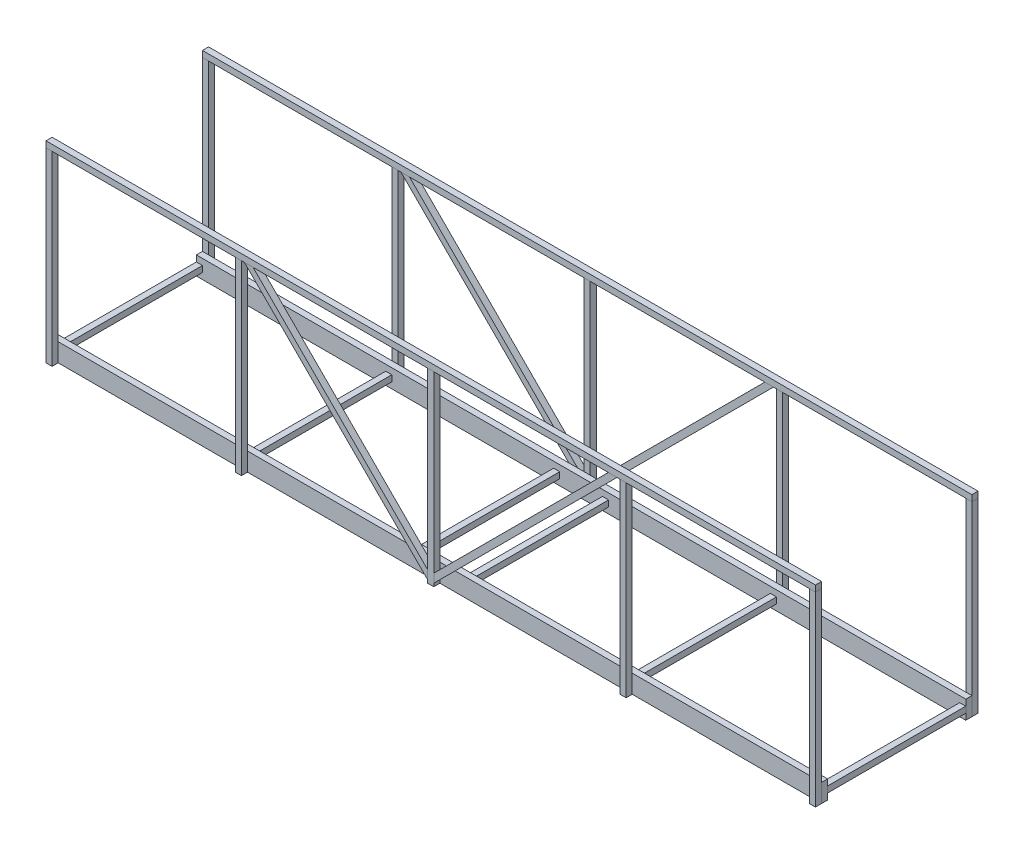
ISO-10303-21;
HEADER;
FILE_DESCRIPTION(('STEP AP214'),'2;1');
FILE_NAME('part.step','',(''),(''),'','','');
FILE_SCHEMA(('AUTOMOTIVE_DESIGN { 1 0 10303 214 1 1 1 1 }'));
ENDSEC;
DATA;
#1=APPLICATION_CONTEXT('core data for automotive mechanical design processes');
#2=APPLICATION_PROTOCOL_DEFINITION('international standard','automotive_design',2000,#1);
#3=PRODUCT_CONTEXT('',#1,'mechanical');
#4=PRODUCT('Part','Part','',(#3));
#5=PRODUCT_RELATED_PRODUCT_CATEGORY('part','',(#4));
#6=PRODUCT_DEFINITION_FORMATION('','',#4);
#7=PRODUCT_DEFINITION_CONTEXT('part definition',#1,'design');
#8=PRODUCT_DEFINITION('design','',#6,#7);
#9=PRODUCT_DEFINITION_SHAPE('','',#8);
#10=(LENGTH_UNIT() NAMED_UNIT(*) SI_UNIT(.MILLI.,.METRE.));
#11=(NAMED_UNIT(*) PLANE_ANGLE_UNIT() SI_UNIT($,.RADIAN.));
#12=(NAMED_UNIT(*) SI_UNIT($,.STERADIAN.) SOLID_ANGLE_UNIT());
#13=UNCERTAINTY_MEASURE_WITH_UNIT(LENGTH_MEASURE(1.E-05),#10,'distance_accuracy_value','');
#14=(GEOMETRIC_REPRESENTATION_CONTEXT(3) GLOBAL_UNCERTAINTY_ASSIGNED_CONTEXT((#13)) GLOBAL_UNIT_ASSIGNED_CONTEXT((#10,
#11,#12)) REPRESENTATION_CONTEXT('',''));
#15=CARTESIAN_POINT('',(0.,0.,0.));
#16=DIRECTION('',(0.,0.,1.));
#17=DIRECTION('',(1.,0.,0.));
#18=AXIS2_PLACEMENT_3D('',#15,#16,#17);
#19=CARTESIAN_POINT('',(2.24506403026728,-2.51743596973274,-39.0875));
#20=DIRECTION('',(0.,0.,-1.));
#21=DIRECTION('',(-1.,0.,0.));
#22=AXIS2_PLACEMENT_3D('',#19,#20,#21);
#23=PLANE('',#22);
#24=DIRECTION('',(1.,0.,0.));
#25=VECTOR('',#24,1.);
#26=CARTESIAN_POINT('',(2.24506403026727,92.0624999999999,-39.0875));
#27=LINE('',#26,#25);
#28=CARTESIAN_POINT('',(-96.825,92.0624999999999,-39.0875));
#29=VERTEX_POINT('',#28);
#30=CARTESIAN_POINT('',(-92.3348719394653,92.0624999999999,-39.0875));
#31=VERTEX_POINT('',#30);
#32=EDGE_CURVE('E350',#29,#31,#27,.T.);
#33=ORIENTED_EDGE('',*,*,#32,.F.);
#34=DIRECTION('',(-0.707106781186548,0.707106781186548,0.));
#35=VECTOR('',#34,1.);
#36=CARTESIAN_POINT('',(0.,-4.76250000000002,-39.0875));
#37=LINE('',#36,#35);
#38=CARTESIAN_POINT('',(-1.58750000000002,-3.175,-39.0875));
#39=VERTEX_POINT('',#38);
#40=EDGE_CURVE('E360',#39,#29,#37,.T.);
#41=ORIENTED_EDGE('',*,*,#40,.F.);
#42=DIRECTION('',(0.,-1.,0.));
#43=VECTOR('',#42,1.);
#44=CARTESIAN_POINT('',(-1.58750000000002,-2.51743596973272,-39.0875));
#45=LINE('',#44,#43);
#46=CARTESIAN_POINT('',(-1.58750000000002,1.31512806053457,-39.0875));
#47=VERTEX_POINT('',#46);
#48=EDGE_CURVE('E345',#47,#39,#45,.T.);
#49=ORIENTED_EDGE('',*,*,#48,.F.);
#50=DIRECTION('',(-0.707106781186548,0.707106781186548,0.));
#51=VECTOR('',#50,1.);
#52=CARTESIAN_POINT('',(2.24506403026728,-2.51743596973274,-39.0875));
#53=LINE('',#52,#51);
#54=EDGE_CURVE('E309',#47,#31,#53,.T.);
#55=ORIENTED_EDGE('',*,*,#54,.T.);
#56=EDGE_LOOP('',(#33,#41,#49,#55));
#57=FACE_BOUND('',#56,.T.);
#58=ADVANCED_FACE('F305',(#57),#23,.F.);
#59=CARTESIAN_POINT('',(2.24506403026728,-2.51743596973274,-39.0875));
#60=DIRECTION('',(-0.707106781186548,-0.707106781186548,0.));
#61=DIRECTION('',(0.707106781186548,-0.707106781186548,0.));
#62=AXIS2_PLACEMENT_3D('',#59,#60,#61);
#63=PLANE('',#62);
#64=DIRECTION('',(0.,0.,-1.));
#65=VECTOR('',#64,1.);
#66=CARTESIAN_POINT('',(-92.3348719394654,92.0625,-39.0875));
#67=LINE('',#66,#65);
#68=CARTESIAN_POINT('',(-92.3348719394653,92.0624999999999,-42.2625));
#69=VERTEX_POINT('',#68);
#70=EDGE_CURVE('E315',#31,#69,#67,.T.);
#71=ORIENTED_EDGE('',*,*,#70,.F.);
#72=ORIENTED_EDGE('',*,*,#54,.F.);
#73=DIRECTION('',(0.,0.,1.));
#74=VECTOR('',#73,1.);
#75=CARTESIAN_POINT('',(-1.58750000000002,1.31512806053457,-39.0875));
#76=LINE('',#75,#74);
#77=CARTESIAN_POINT('',(-1.58750000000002,1.31512806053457,-42.2625));
#78=VERTEX_POINT('',#77);
#79=EDGE_CURVE('E343',#78,#47,#76,.T.);
#80=ORIENTED_EDGE('',*,*,#79,.F.);
#81=DIRECTION('',(-0.707106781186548,0.707106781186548,0.));
#82=VECTOR('',#81,1.);
#83=CARTESIAN_POINT('',(2.24506403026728,-2.51743596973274,-42.2625));
#84=LINE('',#83,#82);
#85=EDGE_CURVE('E369',#78,#69,#84,.T.);
#86=ORIENTED_EDGE('',*,*,#85,.T.);
#87=EDGE_LOOP('',(#71,#72,#80,#86));
#88=FACE_BOUND('',#87,.T.);
#89=ADVANCED_FACE('F376',(#88),#63,.F.);
#90=CARTESIAN_POINT('',(2.24506403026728,-2.51743596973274,-42.2625));
#91=DIRECTION('',(0.,0.,1.));
#92=DIRECTION('',(1.,0.,0.));
#93=AXIS2_PLACEMENT_3D('',#90,#91,#92);
#94=PLANE('',#93);
#95=DIRECTION('',(-1.,0.,0.));
#96=VECTOR('',#95,1.);
#97=CARTESIAN_POINT('',(200.,92.0625,-42.2625));
#98=LINE('',#97,#96);
#99=CARTESIAN_POINT('',(-96.8249999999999,92.0624999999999,-42.2625));
#100=VERTEX_POINT('',#99);
#101=EDGE_CURVE('E13',#69,#100,#98,.T.);
#102=ORIENTED_EDGE('',*,*,#101,.F.);
#103=ORIENTED_EDGE('',*,*,#85,.F.);
#104=DIRECTION('',(0.,-1.,0.));
#105=VECTOR('',#104,1.);
#106=CARTESIAN_POINT('',(-1.58750000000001,95.2375,-42.2625));
#107=LINE('',#106,#105);
#108=CARTESIAN_POINT('',(-1.58750000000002,-3.175,-42.2625));
#109=VERTEX_POINT('',#108);
#110=EDGE_CURVE('E340',#78,#109,#107,.T.);
#111=ORIENTED_EDGE('',*,*,#110,.T.);
#112=DIRECTION('',(-0.707106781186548,0.707106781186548,0.));
#113=VECTOR('',#112,1.);
#114=CARTESIAN_POINT('',(0.,-4.76250000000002,-42.2625));
#115=LINE('',#114,#113);
#116=EDGE_CURVE('E364',#109,#100,#115,.T.);
#117=ORIENTED_EDGE('',*,*,#116,.T.);
#118=EDGE_LOOP('',(#102,#103,#111,#117));
#119=FACE_BOUND('',#118,.T.);
#120=ADVANCED_FACE('F374',(#119),#94,.F.);
#121=CARTESIAN_POINT('',(0.,-4.76250000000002,-39.0875));
#122=DIRECTION('',(0.707106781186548,0.707106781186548,0.));
#123=DIRECTION('',(-0.707106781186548,0.707106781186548,0.));
#124=AXIS2_PLACEMENT_3D('',#121,#122,#123);
#125=PLANE('',#124);
#126=DIRECTION('',(0.,0.,1.));
#127=VECTOR('',#126,1.);
#128=CARTESIAN_POINT('',(-96.825,92.0624999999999,-39.0875));
#129=LINE('',#128,#127);
#130=EDGE_CURVE('E347',#100,#29,#129,.T.);
#131=ORIENTED_EDGE('',*,*,#130,.F.);
#132=ORIENTED_EDGE('',*,*,#116,.F.);
#133=DIRECTION('',(0.,0.,-1.));
#134=VECTOR('',#133,1.);
#135=CARTESIAN_POINT('',(-1.58750000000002,-3.175,-39.0875));
#136=LINE('',#135,#134);
#137=EDGE_CURVE('E363',#39,#109,#136,.T.);
#138=ORIENTED_EDGE('',*,*,#137,.F.);
#139=ORIENTED_EDGE('',*,*,#40,.T.);
#140=EDGE_LOOP('',(#131,#132,#138,#139));
#141=FACE_BOUND('',#140,.T.);
#142=ADVANCED_FACE('F307',(#141),#125,.F.);
#143=CARTESIAN_POINT('',(-1.58750000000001,95.2375,-39.0875));
#144=DIRECTION('',(1.,0.,0.));
#145=DIRECTION('',(0.,1.,0.));
#146=AXIS2_PLACEMENT_3D('',#143,#144,#145);
#147=PLANE('',#146);
#148=ORIENTED_EDGE('',*,*,#137,.T.);
#149=ORIENTED_EDGE('',*,*,#110,.F.);
#150=ORIENTED_EDGE('',*,*,#79,.T.);
#151=ORIENTED_EDGE('',*,*,#48,.T.);
#152=EDGE_LOOP('',(#148,#149,#150,#151));
#153=FACE_BOUND('',#152,.T.);
#154=ADVANCED_FACE('F381',(#153),#147,.T.);
#155=CARTESIAN_POINT('',(200.,92.0625,-39.0875));
#156=DIRECTION('',(0.,1.,0.));
#157=DIRECTION('',(0.,0.,1.));
#158=AXIS2_PLACEMENT_3D('',#155,#156,#157);
#159=PLANE('',#158);
#160=ORIENTED_EDGE('',*,*,#130,.T.);
#161=ORIENTED_EDGE('',*,*,#32,.T.);
#162=ORIENTED_EDGE('',*,*,#70,.T.);
#163=ORIENTED_EDGE('',*,*,#101,.T.);
#164=EDGE_LOOP('',(#160,#161,#162,#163));
#165=FACE_BOUND('',#164,.T.);
#166=ADVANCED_FACE('F349',(#165),#159,.T.);
#167=CLOSED_SHELL('',(#58,#89,#120,#142,#154,#166));
#168=MANIFOLD_SOLID_BREP('B2',#167);
#169=CARTESIAN_POINT('',(97.7549359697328,97.4825640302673,-39.0875));
#170=DIRECTION('',(0.,0.,-1.));
#171=DIRECTION('',(-1.,0.,0.));
#172=AXIS2_PLACEMENT_3D('',#169,#170,#171);
#173=PLANE('',#172);
#174=DIRECTION('',(1.,0.,0.));
#175=VECTOR('',#174,1.);
#176=CARTESIAN_POINT('',(97.7549359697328,92.0624999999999,-39.0875));
#177=LINE('',#176,#175);
#178=CARTESIAN_POINT('',(92.3348719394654,92.0624999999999,-39.0875));
#179=VERTEX_POINT('',#178);
#180=CARTESIAN_POINT('',(96.825,92.0624999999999,-39.0875));
#181=VERTEX_POINT('',#180);
#182=EDGE_CURVE('E303',#179,#181,#177,.T.);
#183=ORIENTED_EDGE('',*,*,#182,.F.);
#184=DIRECTION('',(-0.707106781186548,-0.707106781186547,0.));
#185=VECTOR('',#184,1.);
#186=CARTESIAN_POINT('',(97.7549359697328,97.4825640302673,-39.0875));
#187=LINE('',#186,#185);
#188=CARTESIAN_POINT('',(1.58749999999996,1.31512806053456,-39.0875));
#189=VERTEX_POINT('',#188);
#190=EDGE_CURVE('E508',#179,#189,#187,.T.);
#191=ORIENTED_EDGE('',*,*,#190,.T.);
#192=DIRECTION('',(0.,1.,0.));
#193=VECTOR('',#192,1.);
#194=CARTESIAN_POINT('',(1.58749999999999,97.4825640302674,-39.0875));
#195=LINE('',#194,#193);
#196=CARTESIAN_POINT('',(1.58749999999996,-3.17500000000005,-39.0875));
#197=VERTEX_POINT('',#196);
#198=EDGE_CURVE('E458',#197,#189,#195,.T.);
#199=ORIENTED_EDGE('',*,*,#198,.F.);
#200=DIRECTION('',(-0.707106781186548,-0.707106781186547,0.));
#201=VECTOR('',#200,1.);
#202=CARTESIAN_POINT('',(100.,95.2375,-39.0875));
#203=LINE('',#202,#201);
#204=EDGE_CURVE('E511',#181,#197,#203,.T.);
#205=ORIENTED_EDGE('',*,*,#204,.F.);
#206=EDGE_LOOP('',(#183,#191,#199,#205));
#207=FACE_BOUND('',#206,.T.);
#208=ADVANCED_FACE('F450',(#207),#173,.F.);
#209=CARTESIAN_POINT('',(97.7549359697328,97.4825640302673,-39.0875));
#210=DIRECTION('',(0.707106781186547,-0.707106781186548,0.));
#211=DIRECTION('',(0.707106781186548,0.707106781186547,0.));
#212=AXIS2_PLACEMENT_3D('',#209,#210,#211);
#213=PLANE('',#212);
#214=DIRECTION('',(0.,0.,1.));
#215=VECTOR('',#214,1.);
#216=CARTESIAN_POINT('',(92.3348719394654,92.0624999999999,-39.0875));
#217=LINE('',#216,#215);
#218=CARTESIAN_POINT('',(92.3348719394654,92.0624999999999,-42.2625));
#219=VERTEX_POINT('',#218);
#220=EDGE_CURVE('E472',#219,#179,#217,.T.);
#221=ORIENTED_EDGE('',*,*,#220,.F.);
#222=DIRECTION('',(-0.707106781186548,-0.707106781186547,0.));
#223=VECTOR('',#222,1.);
#224=CARTESIAN_POINT('',(97.7549359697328,97.4825640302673,-42.2625));
#225=LINE('',#224,#223);
#226=CARTESIAN_POINT('',(1.58749999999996,1.31512806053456,-42.2625));
#227=VERTEX_POINT('',#226);
#228=EDGE_CURVE('E503',#219,#227,#225,.T.);
#229=ORIENTED_EDGE('',*,*,#228,.T.);
#230=DIRECTION('',(0.,0.,-1.));
#231=VECTOR('',#230,1.);
#232=CARTESIAN_POINT('',(1.58749999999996,1.31512806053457,-39.0875));
#233=LINE('',#232,#231);
#234=EDGE_CURVE('E488',#189,#227,#233,.T.);
#235=ORIENTED_EDGE('',*,*,#234,.F.);
#236=ORIENTED_EDGE('',*,*,#190,.F.);
#237=EDGE_LOOP('',(#221,#229,#235,#236));
#238=FACE_BOUND('',#237,.T.);
#239=ADVANCED_FACE('F507',(#238),#213,.F.);
#240=CARTESIAN_POINT('',(97.7549359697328,97.4825640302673,-42.2625));
#241=DIRECTION('',(0.,0.,1.));
#242=DIRECTION('',(1.,0.,0.));
#243=AXIS2_PLACEMENT_3D('',#240,#241,#242);
#244=PLANE('',#243);
#245=DIRECTION('',(-1.,0.,0.));
#246=VECTOR('',#245,1.);
#247=CARTESIAN_POINT('',(200.,92.0624999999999,-42.2625));
#248=LINE('',#247,#246);
#249=CARTESIAN_POINT('',(96.825,92.0624999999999,-42.2625));
#250=VERTEX_POINT('',#249);
#251=EDGE_CURVE('E496',#250,#219,#248,.T.);
#252=ORIENTED_EDGE('',*,*,#251,.F.);
#253=DIRECTION('',(-0.707106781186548,-0.707106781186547,0.));
#254=VECTOR('',#253,1.);
#255=CARTESIAN_POINT('',(100.,95.2375,-42.2625));
#256=LINE('',#255,#254);
#257=CARTESIAN_POINT('',(1.58749999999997,-3.17500000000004,-42.2625));
#258=VERTEX_POINT('',#257);
#259=EDGE_CURVE('E505',#250,#258,#256,.T.);
#260=ORIENTED_EDGE('',*,*,#259,.T.);
#261=DIRECTION('',(0.,-1.,0.));
#262=VECTOR('',#261,1.);
#263=CARTESIAN_POINT('',(1.58750000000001,95.2375,-42.2625));
#264=LINE('',#263,#262);
#265=EDGE_CURVE('E491',#227,#258,#264,.T.);
#266=ORIENTED_EDGE('',*,*,#265,.F.);
#267=ORIENTED_EDGE('',*,*,#228,.F.);
#268=EDGE_LOOP('',(#252,#260,#266,#267));
#269=FACE_BOUND('',#268,.T.);
#270=ADVANCED_FACE('F502',(#269),#244,.F.);
#271=CARTESIAN_POINT('',(100.,95.2375,-39.0875));
#272=DIRECTION('',(-0.707106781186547,0.707106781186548,0.));
#273=DIRECTION('',(-0.707106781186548,-0.707106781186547,0.));
#274=AXIS2_PLACEMENT_3D('',#271,#272,#273);
#275=PLANE('',#274);
#276=DIRECTION('',(0.,0.,-1.));
#277=VECTOR('',#276,1.);
#278=CARTESIAN_POINT('',(96.8249999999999,92.0624999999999,-39.0875));
#279=LINE('',#278,#277);
#280=EDGE_CURVE('E516',#181,#250,#279,.T.);
#281=ORIENTED_EDGE('',*,*,#280,.F.);
#282=ORIENTED_EDGE('',*,*,#204,.T.);
#283=DIRECTION('',(0.,0.,1.));
#284=VECTOR('',#283,1.);
#285=CARTESIAN_POINT('',(1.58749999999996,-3.17500000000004,-39.0875));
#286=LINE('',#285,#284);
#287=EDGE_CURVE('E465',#258,#197,#286,.T.);
#288=ORIENTED_EDGE('',*,*,#287,.F.);
#289=ORIENTED_EDGE('',*,*,#259,.F.);
#290=EDGE_LOOP('',(#281,#282,#288,#289));
#291=FACE_BOUND('',#290,.T.);
#292=ADVANCED_FACE('F452',(#291),#275,.F.);
#293=CARTESIAN_POINT('',(1.58750000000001,95.2375,-39.0875));
#294=DIRECTION('',(-1.,0.,0.));
#295=DIRECTION('',(0.,-1.,0.));
#296=AXIS2_PLACEMENT_3D('',#293,#294,#295);
#297=PLANE('',#296);
#298=ORIENTED_EDGE('',*,*,#287,.T.);
#299=ORIENTED_EDGE('',*,*,#198,.T.);
#300=ORIENTED_EDGE('',*,*,#234,.T.);
#301=ORIENTED_EDGE('',*,*,#265,.T.);
#302=EDGE_LOOP('',(#298,#299,#300,#301));
#303=FACE_BOUND('',#302,.T.);
#304=ADVANCED_FACE('F490',(#303),#297,.T.);
#305=CARTESIAN_POINT('',(200.,92.0624999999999,-39.0875));
#306=DIRECTION('',(0.,1.,0.));
#307=DIRECTION('',(0.,0.,1.));
#308=AXIS2_PLACEMENT_3D('',#305,#306,#307);
#309=PLANE('',#308);
#310=ORIENTED_EDGE('',*,*,#280,.T.);
#311=ORIENTED_EDGE('',*,*,#251,.T.);
#312=ORIENTED_EDGE('',*,*,#220,.T.);
#313=ORIENTED_EDGE('',*,*,#182,.T.);
#314=EDGE_LOOP('',(#310,#311,#312,#313));
#315=FACE_BOUND('',#314,.T.);
#316=ADVANCED_FACE('F523',(#315),#309,.T.);
#317=CLOSED_SHELL('',(#208,#239,#270,#292,#304,#316));
#318=MANIFOLD_SOLID_BREP('B7',#317);
#319=CARTESIAN_POINT('',(100.000000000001,95.2375,39.0875));
#320=DIRECTION('',(0.,0.,1.));
#321=DIRECTION('',(1.,0.,0.));
#322=AXIS2_PLACEMENT_3D('',#319,#320,#321);
#323=PLANE('',#322);
#324=DIRECTION('',(-1.,0.,0.));
#325=VECTOR('',#324,1.);
#326=CARTESIAN_POINT('',(100.000000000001,92.0625,39.0875));
#327=LINE('',#326,#325);
#328=CARTESIAN_POINT('',(96.8250000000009,92.0625,39.0875));
#329=VERTEX_POINT('',#328);
#330=CARTESIAN_POINT('',(92.3348719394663,92.0625,39.0875));
#331=VERTEX_POINT('',#330);
#332=EDGE_CURVE('E448',#329,#331,#327,.T.);
#333=ORIENTED_EDGE('',*,*,#332,.F.);
#334=DIRECTION('',(-0.707106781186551,-0.707106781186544,0.));
#335=VECTOR('',#334,1.);
#336=CARTESIAN_POINT('',(100.000000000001,95.2375,39.0875));
#337=LINE('',#336,#335);
#338=CARTESIAN_POINT('',(1.58749999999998,-3.17500000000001,39.0875));
#339=VERTEX_POINT('',#338);
#340=EDGE_CURVE('E599',#329,#339,#337,.T.);
#341=ORIENTED_EDGE('',*,*,#340,.T.);
#342=DIRECTION('',(0.,-1.,0.));
#343=VECTOR('',#342,1.);
#344=CARTESIAN_POINT('',(1.58750000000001,95.2375,39.0875));
#345=LINE('',#344,#343);
#346=CARTESIAN_POINT('',(1.58749999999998,1.31512806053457,39.0875));
#347=VERTEX_POINT('',#346);
#348=EDGE_CURVE('E632',#347,#339,#345,.T.);
#349=ORIENTED_EDGE('',*,*,#348,.F.);
#350=DIRECTION('',(-0.707106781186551,-0.707106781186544,0.));
#351=VECTOR('',#350,1.);
#352=CARTESIAN_POINT('',(97.7549359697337,97.4825640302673,39.0875));
#353=LINE('',#352,#351);
#354=EDGE_CURVE('E659',#331,#347,#353,.T.);
#355=ORIENTED_EDGE('',*,*,#354,.F.);
#356=EDGE_LOOP('',(#333,#341,#349,#355));
#357=FACE_BOUND('',#356,.T.);
#358=ADVANCED_FACE('F595',(#357),#323,.F.);
#359=CARTESIAN_POINT('',(100.000000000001,95.2375,39.0875));
#360=DIRECTION('',(-0.707106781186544,0.707106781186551,0.));
#361=DIRECTION('',(-0.707106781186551,-0.707106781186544,0.));
#362=AXIS2_PLACEMENT_3D('',#359,#360,#361);
#363=PLANE('',#362);
#364=DIRECTION('',(0.,0.,-1.));
#365=VECTOR('',#364,1.);
#366=CARTESIAN_POINT('',(96.8250000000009,92.0625,39.0875));
#367=LINE('',#366,#365);
#368=CARTESIAN_POINT('',(96.825000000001,92.0625,42.2625));
#369=VERTEX_POINT('',#368);
#370=EDGE_CURVE('E605',#369,#329,#367,.T.);
#371=ORIENTED_EDGE('',*,*,#370,.F.);
#372=DIRECTION('',(-0.707106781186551,-0.707106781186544,0.));
#373=VECTOR('',#372,1.);
#374=CARTESIAN_POINT('',(100.000000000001,95.2375,42.2625));
#375=LINE('',#374,#373);
#376=CARTESIAN_POINT('',(1.58749999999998,-3.17500000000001,42.2625));
#377=VERTEX_POINT('',#376);
#378=EDGE_CURVE('E647',#369,#377,#375,.T.);
#379=ORIENTED_EDGE('',*,*,#378,.T.);
#380=DIRECTION('',(0.,0.,1.));
#381=VECTOR('',#380,1.);
#382=CARTESIAN_POINT('',(1.58749999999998,-3.17500000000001,39.0875));
#383=LINE('',#382,#381);
#384=EDGE_CURVE('E627',#339,#377,#383,.T.);
#385=ORIENTED_EDGE('',*,*,#384,.F.);
#386=ORIENTED_EDGE('',*,*,#340,.F.);
#387=EDGE_LOOP('',(#371,#379,#385,#386));
#388=FACE_BOUND('',#387,.T.);
#389=ADVANCED_FACE('F652',(#388),#363,.F.);
#390=CARTESIAN_POINT('',(100.000000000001,95.2375,42.2625));
#391=DIRECTION('',(0.,0.,-1.));
#392=DIRECTION('',(-1.,0.,0.));
#393=AXIS2_PLACEMENT_3D('',#390,#391,#392);
#394=PLANE('',#393);
#395=DIRECTION('',(-1.,0.,0.));
#396=VECTOR('',#395,1.);
#397=CARTESIAN_POINT('',(200.,92.0625,42.2625));
#398=LINE('',#397,#396);
#399=CARTESIAN_POINT('',(92.3348719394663,92.0625,42.2625));
#400=VERTEX_POINT('',#399);
#401=EDGE_CURVE('E639',#369,#400,#398,.T.);
#402=ORIENTED_EDGE('',*,*,#401,.T.);
#403=DIRECTION('',(-0.707106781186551,-0.707106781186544,0.));
#404=VECTOR('',#403,1.);
#405=CARTESIAN_POINT('',(97.7549359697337,97.4825640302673,42.2625));
#406=LINE('',#405,#404);
#407=CARTESIAN_POINT('',(1.58749999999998,1.31512806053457,42.2625));
#408=VERTEX_POINT('',#407);
#409=EDGE_CURVE('E646',#400,#408,#406,.T.);
#410=ORIENTED_EDGE('',*,*,#409,.T.);
#411=DIRECTION('',(0.,1.,0.));
#412=VECTOR('',#411,1.);
#413=CARTESIAN_POINT('',(1.58749999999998,-4.7625,42.2625));
#414=LINE('',#413,#412);
#415=EDGE_CURVE('E656',#377,#408,#414,.T.);
#416=ORIENTED_EDGE('',*,*,#415,.F.);
#417=ORIENTED_EDGE('',*,*,#378,.F.);
#418=EDGE_LOOP('',(#402,#410,#416,#417));
#419=FACE_BOUND('',#418,.T.);
#420=ADVANCED_FACE('F655',(#419),#394,.F.);
#421=CARTESIAN_POINT('',(97.7549359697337,97.4825640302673,39.0875));
#422=DIRECTION('',(0.707106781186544,-0.707106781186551,0.));
#423=DIRECTION('',(0.707106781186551,0.707106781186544,0.));
#424=AXIS2_PLACEMENT_3D('',#421,#422,#423);
#425=PLANE('',#424);
#426=DIRECTION('',(0.,0.,1.));
#427=VECTOR('',#426,1.);
#428=CARTESIAN_POINT('',(92.3348719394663,92.0625,39.0875));
#429=LINE('',#428,#427);
#430=EDGE_CURVE('E637',#331,#400,#429,.T.);
#431=ORIENTED_EDGE('',*,*,#430,.F.);
#432=ORIENTED_EDGE('',*,*,#354,.T.);
#433=DIRECTION('',(0.,0.,-1.));
#434=VECTOR('',#433,1.);
#435=CARTESIAN_POINT('',(1.58749999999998,1.31512806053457,39.0875));
#436=LINE('',#435,#434);
#437=EDGE_CURVE('E635',#408,#347,#436,.T.);
#438=ORIENTED_EDGE('',*,*,#437,.F.);
#439=ORIENTED_EDGE('',*,*,#409,.F.);
#440=EDGE_LOOP('',(#431,#432,#438,#439));
#441=FACE_BOUND('',#440,.T.);
#442=ADVANCED_FACE('F597',(#441),#425,.F.);
#443=CARTESIAN_POINT('',(1.58749999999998,-4.7625,39.0875));
#444=DIRECTION('',(-1.,0.,0.));
#445=DIRECTION('',(0.,-1.,0.));
#446=AXIS2_PLACEMENT_3D('',#443,#444,#445);
#447=PLANE('',#446);
#448=ORIENTED_EDGE('',*,*,#437,.T.);
#449=ORIENTED_EDGE('',*,*,#348,.T.);
#450=ORIENTED_EDGE('',*,*,#384,.T.);
#451=ORIENTED_EDGE('',*,*,#415,.T.);
#452=EDGE_LOOP('',(#448,#449,#450,#451));
#453=FACE_BOUND('',#452,.T.);
#454=ADVANCED_FACE('F666',(#453),#447,.T.);
#455=CARTESIAN_POINT('',(200.,92.0625,39.0875));
#456=DIRECTION('',(0.,1.,0.));
#457=DIRECTION('',(0.,0.,1.));
#458=AXIS2_PLACEMENT_3D('',#455,#456,#457);
#459=PLANE('',#458);
#460=ORIENTED_EDGE('',*,*,#430,.T.);
#461=ORIENTED_EDGE('',*,*,#401,.F.);
#462=ORIENTED_EDGE('',*,*,#370,.T.);
#463=ORIENTED_EDGE('',*,*,#332,.T.);
#464=EDGE_LOOP('',(#460,#461,#462,#463));
#465=FACE_BOUND('',#464,.T.);
#466=ADVANCED_FACE('F641',(#465),#459,.T.);
#467=CLOSED_SHELL('',(#358,#389,#420,#442,#454,#466));
#468=MANIFOLD_SOLID_BREP('B297',#467);
#469=CARTESIAN_POINT('',(-1.58750000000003,-4.7625,39.0875));
#470=DIRECTION('',(1.,0.,0.));
#471=DIRECTION('',(0.,1.,0.));
#472=AXIS2_PLACEMENT_3D('',#469,#470,#471);
#473=PLANE('',#472);
#474=DIRECTION('',(0.,1.,0.));
#475=VECTOR('',#474,1.);
#476=CARTESIAN_POINT('',(-1.58750000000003,-4.7625,39.0875));
#477=LINE('',#476,#475);
#478=CARTESIAN_POINT('',(-1.58750000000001,-3.175,39.0875));
#479=VERTEX_POINT('',#478);
#480=CARTESIAN_POINT('',(-1.58750000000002,1.31512806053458,39.0875));
#481=VERTEX_POINT('',#480);
#482=EDGE_CURVE('E593',#479,#481,#477,.T.);
#483=ORIENTED_EDGE('',*,*,#482,.T.);
#484=DIRECTION('',(0.,0.,1.));
#485=VECTOR('',#484,1.);
#486=CARTESIAN_POINT('',(-1.58750000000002,1.31512806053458,39.0875));
#487=LINE('',#486,#485);
#488=CARTESIAN_POINT('',(-1.58750000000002,1.31512806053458,42.2625));
#489=VERTEX_POINT('',#488);
#490=EDGE_CURVE('E802',#481,#489,#487,.T.);
#491=ORIENTED_EDGE('',*,*,#490,.T.);
#492=DIRECTION('',(0.,1.,0.));
#493=VECTOR('',#492,1.);
#494=CARTESIAN_POINT('',(-1.58750000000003,-4.7625,42.2625));
#495=LINE('',#494,#493);
#496=CARTESIAN_POINT('',(-1.58750000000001,-3.175,42.2625));
#497=VERTEX_POINT('',#496);
#498=EDGE_CURVE('E761',#497,#489,#495,.T.);
#499=ORIENTED_EDGE('',*,*,#498,.F.);
#500=DIRECTION('',(0.,0.,-1.));
#501=VECTOR('',#500,1.);
#502=CARTESIAN_POINT('',(-1.58750000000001,-3.175,39.0875));
#503=LINE('',#502,#501);
#504=EDGE_CURVE('E756',#497,#479,#503,.T.);
#505=ORIENTED_EDGE('',*,*,#504,.T.);
#506=EDGE_LOOP('',(#483,#491,#499,#505));
#507=FACE_BOUND('',#506,.T.);
#508=ADVANCED_FACE('F740',(#507),#473,.T.);
#509=CARTESIAN_POINT('',(0.,-4.7625,42.2625));
#510=DIRECTION('',(0.,0.,-1.));
#511=DIRECTION('',(-1.,0.,0.));
#512=AXIS2_PLACEMENT_3D('',#509,#510,#511);
#513=PLANE('',#512);
#514=ORIENTED_EDGE('',*,*,#498,.T.);
#515=DIRECTION('',(-0.707106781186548,0.707106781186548,0.));
#516=VECTOR('',#515,1.);
#517=CARTESIAN_POINT('',(2.24506403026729,-2.5174359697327,42.2625));
#518=LINE('',#517,#516);
#519=CARTESIAN_POINT('',(-92.3348719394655,92.0625,42.2625));
#520=VERTEX_POINT('',#519);
#521=EDGE_CURVE('E806',#489,#520,#518,.T.);
#522=ORIENTED_EDGE('',*,*,#521,.T.);
#523=DIRECTION('',(-1.,0.,0.));
#524=VECTOR('',#523,1.);
#525=CARTESIAN_POINT('',(200.,92.0625,42.2625));
#526=LINE('',#525,#524);
#527=CARTESIAN_POINT('',(-96.8250000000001,92.0625,42.2625));
#528=VERTEX_POINT('',#527);
#529=EDGE_CURVE('E787',#520,#528,#526,.T.);
#530=ORIENTED_EDGE('',*,*,#529,.T.);
#531=DIRECTION('',(-0.707106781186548,0.707106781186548,0.));
#532=VECTOR('',#531,1.);
#533=CARTESIAN_POINT('',(0.,-4.7625,42.2625));
#534=LINE('',#533,#532);
#535=EDGE_CURVE('E811',#497,#528,#534,.T.);
#536=ORIENTED_EDGE('',*,*,#535,.F.);
#537=EDGE_LOOP('',(#514,#522,#530,#536));
#538=FACE_BOUND('',#537,.T.);
#539=ADVANCED_FACE('F742',(#538),#513,.F.);
#540=CARTESIAN_POINT('',(0.,-4.7625,39.0875));
#541=DIRECTION('',(0.707106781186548,0.707106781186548,0.));
#542=DIRECTION('',(-0.707106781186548,0.707106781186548,0.));
#543=AXIS2_PLACEMENT_3D('',#540,#541,#542);
#544=PLANE('',#543);
#545=ORIENTED_EDGE('',*,*,#535,.T.);
#546=DIRECTION('',(0.,0.,1.));
#547=VECTOR('',#546,1.);
#548=CARTESIAN_POINT('',(-96.825,92.0625,39.0875));
#549=LINE('',#548,#547);
#550=CARTESIAN_POINT('',(-96.8250000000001,92.0625,39.0875));
#551=VERTEX_POINT('',#550);
#552=EDGE_CURVE('E798',#551,#528,#549,.T.);
#553=ORIENTED_EDGE('',*,*,#552,.F.);
#554=DIRECTION('',(-0.707106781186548,0.707106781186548,0.));
#555=VECTOR('',#554,1.);
#556=CARTESIAN_POINT('',(0.,-4.7625,39.0875));
#557=LINE('',#556,#555);
#558=EDGE_CURVE('E749',#479,#551,#557,.T.);
#559=ORIENTED_EDGE('',*,*,#558,.F.);
#560=ORIENTED_EDGE('',*,*,#504,.F.);
#561=EDGE_LOOP('',(#545,#553,#559,#560));
#562=FACE_BOUND('',#561,.T.);
#563=ADVANCED_FACE('F821',(#562),#544,.F.);
#564=CARTESIAN_POINT('',(0.,-4.7625,39.0875));
#565=DIRECTION('',(0.,0.,1.));
#566=DIRECTION('',(1.,0.,0.));
#567=AXIS2_PLACEMENT_3D('',#564,#565,#566);
#568=PLANE('',#567);
#569=ORIENTED_EDGE('',*,*,#558,.T.);
#570=DIRECTION('',(-1.,0.,0.));
#571=VECTOR('',#570,1.);
#572=CARTESIAN_POINT('',(0.,92.0625,39.0875));
#573=LINE('',#572,#571);
#574=CARTESIAN_POINT('',(-92.3348719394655,92.0625,39.0875));
#575=VERTEX_POINT('',#574);
#576=EDGE_CURVE('E784',#575,#551,#573,.T.);
#577=ORIENTED_EDGE('',*,*,#576,.F.);
#578=DIRECTION('',(-0.707106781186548,0.707106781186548,0.));
#579=VECTOR('',#578,1.);
#580=CARTESIAN_POINT('',(2.24506403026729,-2.5174359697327,39.0875));
#581=LINE('',#580,#579);
#582=EDGE_CURVE('E792',#481,#575,#581,.T.);
#583=ORIENTED_EDGE('',*,*,#582,.F.);
#584=ORIENTED_EDGE('',*,*,#482,.F.);
#585=EDGE_LOOP('',(#569,#577,#583,#584));
#586=FACE_BOUND('',#585,.T.);
#587=ADVANCED_FACE('F796',(#586),#568,.F.);
#588=CARTESIAN_POINT('',(2.24506403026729,-2.5174359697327,39.0875));
#589=DIRECTION('',(-0.707106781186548,-0.707106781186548,0.));
#590=DIRECTION('',(0.707106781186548,-0.707106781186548,0.));
#591=AXIS2_PLACEMENT_3D('',#588,#589,#590);
#592=PLANE('',#591);
#593=DIRECTION('',(0.,0.,-1.));
#594=VECTOR('',#593,1.);
#595=CARTESIAN_POINT('',(-92.3348719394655,92.0625,39.0875));
#596=LINE('',#595,#594);
#597=EDGE_CURVE('E780',#520,#575,#596,.T.);
#598=ORIENTED_EDGE('',*,*,#597,.F.);
#599=ORIENTED_EDGE('',*,*,#521,.F.);
#600=ORIENTED_EDGE('',*,*,#490,.F.);
#601=ORIENTED_EDGE('',*,*,#582,.T.);
#602=EDGE_LOOP('',(#598,#599,#600,#601));
#603=FACE_BOUND('',#602,.T.);
#604=ADVANCED_FACE('F801',(#603),#592,.F.);
#605=CARTESIAN_POINT('',(200.,92.0625,39.0875));
#606=DIRECTION('',(0.,1.,0.));
#607=DIRECTION('',(0.,0.,1.));
#608=AXIS2_PLACEMENT_3D('',#605,#606,#607);
#609=PLANE('',#608);
#610=ORIENTED_EDGE('',*,*,#597,.T.);
#611=ORIENTED_EDGE('',*,*,#576,.T.);
#612=ORIENTED_EDGE('',*,*,#552,.T.);
#613=ORIENTED_EDGE('',*,*,#529,.F.);
#614=EDGE_LOOP('',(#610,#611,#612,#613));
#615=FACE_BOUND('',#614,.T.);
#616=ADVANCED_FACE('F782',(#615),#609,.T.);
#617=CLOSED_SHELL('',(#508,#539,#563,#587,#604,#616));
#618=MANIFOLD_SOLID_BREP('B442',#617);
#619=CARTESIAN_POINT('',(-196.825,95.2374999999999,-39.0875));
#620=DIRECTION('',(-1.,0.,0.));
#621=DIRECTION('',(0.,-1.,0.));
#622=AXIS2_PLACEMENT_3D('',#619,#620,#621);
#623=PLANE('',#622);
#624=DIRECTION('',(0.,0.,-1.));
#625=VECTOR('',#624,1.);
#626=CARTESIAN_POINT('',(-196.825,-4.7625,-39.0875));
#627=LINE('',#626,#625);
#628=CARTESIAN_POINT('',(-196.825,-4.7625,-39.0875));
#629=VERTEX_POINT('',#628);
#630=CARTESIAN_POINT('',(-196.825,-4.7625,-42.2625));
#631=VERTEX_POINT('',#630);
#632=EDGE_CURVE('E956',#629,#631,#627,.T.);
#633=ORIENTED_EDGE('',*,*,#632,.T.);
#634=DIRECTION('',(0.,-1.,0.));
#635=VECTOR('',#634,1.);
#636=CARTESIAN_POINT('',(-196.825,95.2374999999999,-42.2625));
#637=LINE('',#636,#635);
#638=CARTESIAN_POINT('',(-196.825,92.0624999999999,-42.2625));
#639=VERTEX_POINT('',#638);
#640=EDGE_CURVE('E949',#639,#631,#637,.T.);
#641=ORIENTED_EDGE('',*,*,#640,.F.);
#642=DIRECTION('',(0.,0.,-1.));
#643=VECTOR('',#642,1.);
#644=CARTESIAN_POINT('',(-196.825,92.0624999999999,-39.0875));
#645=LINE('',#644,#643);
#646=CARTESIAN_POINT('',(-196.825,92.0624999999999,-39.0875));
#647=VERTEX_POINT('',#646);
#648=EDGE_CURVE('E924',#647,#639,#645,.T.);
#649=ORIENTED_EDGE('',*,*,#648,.F.);
#650=DIRECTION('',(0.,-1.,0.));
#651=VECTOR('',#650,1.);
#652=CARTESIAN_POINT('',(-196.825,95.2374999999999,-39.0875));
#653=LINE('',#652,#651);
#654=EDGE_CURVE('E897',#647,#629,#653,.T.);
#655=ORIENTED_EDGE('',*,*,#654,.T.);
#656=EDGE_LOOP('',(#633,#641,#649,#655));
#657=FACE_BOUND('',#656,.T.);
#658=ADVANCED_FACE('F893',(#657),#623,.F.);
#659=CARTESIAN_POINT('',(-200.,95.2374999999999,-42.2625));
#660=DIRECTION('',(0.,0.,1.));
#661=DIRECTION('',(1.,0.,0.));
#662=AXIS2_PLACEMENT_3D('',#659,#660,#661);
#663=PLANE('',#662);
#664=DIRECTION('',(-1.,0.,0.));
#665=VECTOR('',#664,1.);
#666=CARTESIAN_POINT('',(-200.,-4.7625,-42.2625));
#667=LINE('',#666,#665);
#668=CARTESIAN_POINT('',(-200.,-4.7625,-42.2625));
#669=VERTEX_POINT('',#668);
#670=EDGE_CURVE('E943',#631,#669,#667,.T.);
#671=ORIENTED_EDGE('',*,*,#670,.T.);
#672=DIRECTION('',(0.,-1.,0.));
#673=VECTOR('',#672,1.);
#674=CARTESIAN_POINT('',(-200.,95.2374999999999,-42.2625));
#675=LINE('',#674,#673);
#676=CARTESIAN_POINT('',(-200.,92.0624999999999,-42.2625));
#677=VERTEX_POINT('',#676);
#678=EDGE_CURVE('E935',#677,#669,#675,.T.);
#679=ORIENTED_EDGE('',*,*,#678,.F.);
#680=DIRECTION('',(-1.,0.,0.));
#681=VECTOR('',#680,1.);
#682=CARTESIAN_POINT('',(200.,92.0624999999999,-42.2625));
#683=LINE('',#682,#681);
#684=EDGE_CURVE('E921',#639,#677,#683,.T.);
#685=ORIENTED_EDGE('',*,*,#684,.F.);
#686=ORIENTED_EDGE('',*,*,#640,.T.);
#687=EDGE_LOOP('',(#671,#679,#685,#686));
#688=FACE_BOUND('',#687,.T.);
#689=ADVANCED_FACE('F941',(#688),#663,.F.);
#690=CARTESIAN_POINT('',(-200.,95.2374999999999,-39.0875));
#691=DIRECTION('',(1.,0.,0.));
#692=DIRECTION('',(0.,1.,0.));
#693=AXIS2_PLACEMENT_3D('',#690,#691,#692);
#694=PLANE('',#693);
#695=DIRECTION('',(0.,0.,1.));
#696=VECTOR('',#695,1.);
#697=CARTESIAN_POINT('',(-200.,-4.7625,-39.0875));
#698=LINE('',#697,#696);
#699=CARTESIAN_POINT('',(-200.,-4.7625,-39.0875));
#700=VERTEX_POINT('',#699);
#701=EDGE_CURVE('E945',#669,#700,#698,.T.);
#702=ORIENTED_EDGE('',*,*,#701,.T.);
#703=DIRECTION('',(0.,-1.,0.));
#704=VECTOR('',#703,1.);
#705=CARTESIAN_POINT('',(-200.,95.2374999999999,-39.0875));
#706=LINE('',#705,#704);
#707=CARTESIAN_POINT('',(-200.,92.0624999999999,-39.0875));
#708=VERTEX_POINT('',#707);
#709=EDGE_CURVE('E938',#708,#700,#706,.T.);
#710=ORIENTED_EDGE('',*,*,#709,.F.);
#711=DIRECTION('',(0.,0.,1.));
#712=VECTOR('',#711,1.);
#713=CARTESIAN_POINT('',(-200.,92.0624999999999,-39.0875));
#714=LINE('',#713,#712);
#715=EDGE_CURVE('E903',#677,#708,#714,.T.);
#716=ORIENTED_EDGE('',*,*,#715,.F.);
#717=ORIENTED_EDGE('',*,*,#678,.T.);
#718=EDGE_LOOP('',(#702,#710,#716,#717));
#719=FACE_BOUND('',#718,.T.);
#720=ADVANCED_FACE('F934',(#719),#694,.F.);
#721=CARTESIAN_POINT('',(-200.,95.2374999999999,-39.0875));
#722=DIRECTION('',(0.,0.,-1.));
#723=DIRECTION('',(-1.,0.,0.));
#724=AXIS2_PLACEMENT_3D('',#721,#722,#723);
#725=PLANE('',#724);
#726=DIRECTION('',(1.,0.,0.));
#727=VECTOR('',#726,1.);
#728=CARTESIAN_POINT('',(-200.,-4.7625,-39.0875));
#729=LINE('',#728,#727);
#730=EDGE_CURVE('E944',#700,#629,#729,.T.);
#731=ORIENTED_EDGE('',*,*,#730,.T.);
#732=ORIENTED_EDGE('',*,*,#654,.F.);
#733=DIRECTION('',(1.,0.,0.));
#734=VECTOR('',#733,1.);
#735=CARTESIAN_POINT('',(-200.,92.0624999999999,-39.0875));
#736=LINE('',#735,#734);
#737=EDGE_CURVE('E738',#708,#647,#736,.T.);
#738=ORIENTED_EDGE('',*,*,#737,.F.);
#739=ORIENTED_EDGE('',*,*,#709,.T.);
#740=EDGE_LOOP('',(#731,#732,#738,#739));
#741=FACE_BOUND('',#740,.T.);
#742=ADVANCED_FACE('F967',(#741),#725,.F.);
#743=CARTESIAN_POINT('',(200.,92.0624999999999,-39.0875));
#744=DIRECTION('',(0.,1.,0.));
#745=DIRECTION('',(0.,0.,1.));
#746=AXIS2_PLACEMENT_3D('',#743,#744,#745);
#747=PLANE('',#746);
#748=ORIENTED_EDGE('',*,*,#648,.T.);
#749=ORIENTED_EDGE('',*,*,#684,.T.);
#750=ORIENTED_EDGE('',*,*,#715,.T.);
#751=ORIENTED_EDGE('',*,*,#737,.T.);
#752=EDGE_LOOP('',(#748,#749,#750,#751));
#753=FACE_BOUND('',#752,.T.);
#754=ADVANCED_FACE('F923',(#753),#747,.T.);
#755=CARTESIAN_POINT('',(-196.825,-4.7625,-42.2625));
#756=DIRECTION('',(0.,-1.,0.));
#757=DIRECTION('',(1.,0.,0.));
#758=AXIS2_PLACEMENT_3D('',#755,#756,#757);
#759=PLANE('',#758);
#760=ORIENTED_EDGE('',*,*,#632,.F.);
#761=ORIENTED_EDGE('',*,*,#730,.F.);
#762=ORIENTED_EDGE('',*,*,#701,.F.);
#763=ORIENTED_EDGE('',*,*,#670,.F.);
#764=EDGE_LOOP('',(#760,#761,#762,#763));
#765=FACE_BOUND('',#764,.T.);
#766=ADVANCED_FACE('F895',(#765),#759,.T.);
#767=CLOSED_SHELL('',(#658,#689,#720,#742,#754,#766));
#768=MANIFOLD_SOLID_BREP('B587',#767);
#769=CARTESIAN_POINT('',(-98.4125,95.2375,-39.0875));
#770=DIRECTION('',(-1.,0.,0.));
#771=DIRECTION('',(0.,0.,1.));
#772=AXIS2_PLACEMENT_3D('',#769,#770,#771);
#773=PLANE('',#772);
#774=DIRECTION('',(0.,0.,-1.));
#775=VECTOR('',#774,1.);
#776=CARTESIAN_POINT('',(-98.4125,-4.76249999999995,-39.0875));
#777=LINE('',#776,#775);
#778=CARTESIAN_POINT('',(-98.4125,-4.76249999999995,-39.0875));
#779=VERTEX_POINT('',#778);
#780=CARTESIAN_POINT('',(-98.4125,-4.76249999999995,-42.2625));
#781=VERTEX_POINT('',#780);
#782=EDGE_CURVE('E1101',#779,#781,#777,.T.);
#783=ORIENTED_EDGE('',*,*,#782,.T.);
#784=DIRECTION('',(0.,-1.,0.));
#785=VECTOR('',#784,1.);
#786=CARTESIAN_POINT('',(-98.4125,95.2375,-42.2625));
#787=LINE('',#786,#785);
#788=CARTESIAN_POINT('',(-98.4124999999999,92.0624999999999,-42.2625));
#789=VERTEX_POINT('',#788);
#790=EDGE_CURVE('E1094',#789,#781,#787,.T.);
#791=ORIENTED_EDGE('',*,*,#790,.F.);
#792=DIRECTION('',(0.,0.,-1.));
#793=VECTOR('',#792,1.);
#794=CARTESIAN_POINT('',(-98.4125,92.0624999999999,-39.0875));
#795=LINE('',#794,#793);
#796=CARTESIAN_POINT('',(-98.4124999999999,92.0624999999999,-39.0875));
#797=VERTEX_POINT('',#796);
#798=EDGE_CURVE('E1069',#797,#789,#795,.T.);
#799=ORIENTED_EDGE('',*,*,#798,.F.);
#800=DIRECTION('',(0.,-1.,0.));
#801=VECTOR('',#800,1.);
#802=CARTESIAN_POINT('',(-98.4125,95.2375,-39.0875));
#803=LINE('',#802,#801);
#804=EDGE_CURVE('E1042',#797,#779,#803,.T.);
#805=ORIENTED_EDGE('',*,*,#804,.T.);
#806=EDGE_LOOP('',(#783,#791,#799,#805));
#807=FACE_BOUND('',#806,.T.);
#808=ADVANCED_FACE('F1038',(#807),#773,.F.);
#809=CARTESIAN_POINT('',(-101.5875,95.2375,-42.2625));
#810=DIRECTION('',(0.,0.,1.));
#811=DIRECTION('',(1.,0.,0.));
#812=AXIS2_PLACEMENT_3D('',#809,#810,#811);
#813=PLANE('',#812);
#814=DIRECTION('',(-1.,0.,0.));
#815=VECTOR('',#814,1.);
#816=CARTESIAN_POINT('',(-101.5875,-4.76249999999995,-42.2625));
#817=LINE('',#816,#815);
#818=CARTESIAN_POINT('',(-101.5875,-4.76249999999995,-42.2625));
#819=VERTEX_POINT('',#818);
#820=EDGE_CURVE('E1088',#781,#819,#817,.T.);
#821=ORIENTED_EDGE('',*,*,#820,.T.);
#822=DIRECTION('',(0.,-1.,0.));
#823=VECTOR('',#822,1.);
#824=CARTESIAN_POINT('',(-101.5875,95.2375,-42.2625));
#825=LINE('',#824,#823);
#826=CARTESIAN_POINT('',(-101.5875,92.0624999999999,-42.2625));
#827=VERTEX_POINT('',#826);
#828=EDGE_CURVE('E1080',#827,#819,#825,.T.);
#829=ORIENTED_EDGE('',*,*,#828,.F.);
#830=DIRECTION('',(-1.,0.,0.));
#831=VECTOR('',#830,1.);
#832=CARTESIAN_POINT('',(200.,92.0624999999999,-42.2625));
#833=LINE('',#832,#831);
#834=EDGE_CURVE('E1066',#789,#827,#833,.T.);
#835=ORIENTED_EDGE('',*,*,#834,.F.);
#836=ORIENTED_EDGE('',*,*,#790,.T.);
#837=EDGE_LOOP('',(#821,#829,#835,#836));
#838=FACE_BOUND('',#837,.T.);
#839=ADVANCED_FACE('F1086',(#838),#813,.F.);
#840=CARTESIAN_POINT('',(-101.5875,95.2375,-39.0875));
#841=DIRECTION('',(1.,0.,0.));
#842=DIRECTION('',(0.,0.,-1.));
#843=AXIS2_PLACEMENT_3D('',#840,#841,#842);
#844=PLANE('',#843);
#845=DIRECTION('',(0.,0.,1.));
#846=VECTOR('',#845,1.);
#847=CARTESIAN_POINT('',(-101.5875,-4.76249999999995,-39.0875));
#848=LINE('',#847,#846);
#849=CARTESIAN_POINT('',(-101.5875,-4.76249999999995,-39.0875));
#850=VERTEX_POINT('',#849);
#851=EDGE_CURVE('E1090',#819,#850,#848,.T.);
#852=ORIENTED_EDGE('',*,*,#851,.T.);
#853=DIRECTION('',(0.,-1.,0.));
#854=VECTOR('',#853,1.);
#855=CARTESIAN_POINT('',(-101.5875,95.2375,-39.0875));
#856=LINE('',#855,#854);
#857=CARTESIAN_POINT('',(-101.5875,92.0624999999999,-39.0875));
#858=VERTEX_POINT('',#857);
#859=EDGE_CURVE('E1083',#858,#850,#856,.T.);
#860=ORIENTED_EDGE('',*,*,#859,.F.);
#861=DIRECTION('',(0.,0.,1.));
#862=VECTOR('',#861,1.);
#863=CARTESIAN_POINT('',(-101.5875,92.0624999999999,-39.0875));
#864=LINE('',#863,#862);
#865=EDGE_CURVE('E1048',#827,#858,#864,.T.);
#866=ORIENTED_EDGE('',*,*,#865,.F.);
#867=ORIENTED_EDGE('',*,*,#828,.T.);
#868=EDGE_LOOP('',(#852,#860,#866,#867));
#869=FACE_BOUND('',#868,.T.);
#870=ADVANCED_FACE('F1079',(#869),#844,.F.);
#871=CARTESIAN_POINT('',(-101.5875,95.2375,-39.0875));
#872=DIRECTION('',(0.,0.,-1.));
#873=DIRECTION('',(-1.,0.,0.));
#874=AXIS2_PLACEMENT_3D('',#871,#872,#873);
#875=PLANE('',#874);
#876=DIRECTION('',(1.,0.,0.));
#877=VECTOR('',#876,1.);
#878=CARTESIAN_POINT('',(-101.5875,-4.76249999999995,-39.0875));
#879=LINE('',#878,#877);
#880=EDGE_CURVE('E1089',#850,#779,#879,.T.);
#881=ORIENTED_EDGE('',*,*,#880,.T.);
#882=ORIENTED_EDGE('',*,*,#804,.F.);
#883=DIRECTION('',(1.,0.,0.));
#884=VECTOR('',#883,1.);
#885=CARTESIAN_POINT('',(-101.5875,92.0624999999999,-39.0875));
#886=LINE('',#885,#884);
#887=EDGE_CURVE('E891',#858,#797,#886,.T.);
#888=ORIENTED_EDGE('',*,*,#887,.F.);
#889=ORIENTED_EDGE('',*,*,#859,.T.);
#890=EDGE_LOOP('',(#881,#882,#888,#889));
#891=FACE_BOUND('',#890,.T.);
#892=ADVANCED_FACE('F1112',(#891),#875,.F.);
#893=CARTESIAN_POINT('',(200.,92.0624999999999,-39.0875));
#894=DIRECTION('',(0.,1.,0.));
#895=DIRECTION('',(0.,0.,1.));
#896=AXIS2_PLACEMENT_3D('',#893,#894,#895);
#897=PLANE('',#896);
#898=ORIENTED_EDGE('',*,*,#798,.T.);
#899=ORIENTED_EDGE('',*,*,#834,.T.);
#900=ORIENTED_EDGE('',*,*,#865,.T.);
#901=ORIENTED_EDGE('',*,*,#887,.T.);
#902=EDGE_LOOP('',(#898,#899,#900,#901));
#903=FACE_BOUND('',#902,.T.);
#904=ADVANCED_FACE('F1068',(#903),#897,.T.);
#905=CARTESIAN_POINT('',(-98.4125,-4.76249999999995,-42.2625));
#906=DIRECTION('',(0.,-1.,0.));
#907=DIRECTION('',(0.,0.,-1.));
#908=AXIS2_PLACEMENT_3D('',#905,#906,#907);
#909=PLANE('',#908);
#910=ORIENTED_EDGE('',*,*,#782,.F.);
#911=ORIENTED_EDGE('',*,*,#880,.F.);
#912=ORIENTED_EDGE('',*,*,#851,.F.);
#913=ORIENTED_EDGE('',*,*,#820,.F.);
#914=EDGE_LOOP('',(#910,#911,#912,#913));
#915=FACE_BOUND('',#914,.T.);
#916=ADVANCED_FACE('F1040',(#915),#909,.T.);
#917=CLOSED_SHELL('',(#808,#839,#870,#892,#904,#916));
#918=MANIFOLD_SOLID_BREP('B732',#917);
#919=CARTESIAN_POINT('',(1.58750000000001,95.2375,-39.0875));
#920=DIRECTION('',(-1.,0.,0.));
#921=DIRECTION('',(0.,-1.,0.));
#922=AXIS2_PLACEMENT_3D('',#919,#920,#921);
#923=PLANE('',#922);
#924=DIRECTION('',(0.,0.,-1.));
#925=VECTOR('',#924,1.);
#926=CARTESIAN_POINT('',(1.58749999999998,-4.7625,-39.0875));
#927=LINE('',#926,#925);
#928=CARTESIAN_POINT('',(1.58749999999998,-4.7625,-39.0875));
#929=VERTEX_POINT('',#928);
#930=CARTESIAN_POINT('',(1.58749999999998,-4.7625,-42.2625));
#931=VERTEX_POINT('',#930);
#932=EDGE_CURVE('E1246',#929,#931,#927,.T.);
#933=ORIENTED_EDGE('',*,*,#932,.T.);
#934=DIRECTION('',(0.,-1.,0.));
#935=VECTOR('',#934,1.);
#936=CARTESIAN_POINT('',(1.58750000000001,95.2375,-42.2625));
#937=LINE('',#936,#935);
#938=CARTESIAN_POINT('',(1.58750000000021,92.0624999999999,-42.2625));
#939=VERTEX_POINT('',#938);
#940=EDGE_CURVE('E1239',#939,#931,#937,.T.);
#941=ORIENTED_EDGE('',*,*,#940,.F.);
#942=DIRECTION('',(0.,0.,-1.));
#943=VECTOR('',#942,1.);
#944=CARTESIAN_POINT('',(1.5875,92.0624999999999,-39.0875));
#945=LINE('',#944,#943);
#946=CARTESIAN_POINT('',(1.58750000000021,92.0624999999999,-39.0875));
#947=VERTEX_POINT('',#946);
#948=EDGE_CURVE('E1214',#947,#939,#945,.T.);
#949=ORIENTED_EDGE('',*,*,#948,.F.);
#950=DIRECTION('',(0.,-1.,0.));
#951=VECTOR('',#950,1.);
#952=CARTESIAN_POINT('',(1.58750000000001,95.2375,-39.0875));
#953=LINE('',#952,#951);
#954=EDGE_CURVE('E1187',#947,#929,#953,.T.);
#955=ORIENTED_EDGE('',*,*,#954,.T.);
#956=EDGE_LOOP('',(#933,#941,#949,#955));
#957=FACE_BOUND('',#956,.T.);
#958=ADVANCED_FACE('F1183',(#957),#923,.F.);
#959=CARTESIAN_POINT('',(-1.58750000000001,95.2375,-42.2625));
#960=DIRECTION('',(0.,0.,1.));
#961=DIRECTION('',(1.,0.,0.));
#962=AXIS2_PLACEMENT_3D('',#959,#960,#961);
#963=PLANE('',#962);
#964=DIRECTION('',(-1.,0.,0.));
#965=VECTOR('',#964,1.);
#966=CARTESIAN_POINT('',(-1.58750000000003,-4.7625,-42.2625));
#967=LINE('',#966,#965);
#968=CARTESIAN_POINT('',(-1.58750000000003,-4.7625,-42.2625));
#969=VERTEX_POINT('',#968);
#970=EDGE_CURVE('E1233',#931,#969,#967,.T.);
#971=ORIENTED_EDGE('',*,*,#970,.T.);
#972=DIRECTION('',(0.,-1.,0.));
#973=VECTOR('',#972,1.);
#974=CARTESIAN_POINT('',(-1.58750000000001,95.2375,-42.2625));
#975=LINE('',#974,#973);
#976=CARTESIAN_POINT('',(-1.58749999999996,92.0624999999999,-42.2625));
#977=VERTEX_POINT('',#976);
#978=EDGE_CURVE('E1225',#977,#969,#975,.T.);
#979=ORIENTED_EDGE('',*,*,#978,.F.);
#980=DIRECTION('',(-1.,0.,0.));
#981=VECTOR('',#980,1.);
#982=CARTESIAN_POINT('',(200.,92.0624999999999,-42.2625));
#983=LINE('',#982,#981);
#984=EDGE_CURVE('E1211',#939,#977,#983,.T.);
#985=ORIENTED_EDGE('',*,*,#984,.F.);
#986=ORIENTED_EDGE('',*,*,#940,.T.);
#987=EDGE_LOOP('',(#971,#979,#985,#986));
#988=FACE_BOUND('',#987,.T.);
#989=ADVANCED_FACE('F1231',(#988),#963,.F.);
#990=CARTESIAN_POINT('',(-1.58750000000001,95.2375,-39.0875));
#991=DIRECTION('',(1.,0.,0.));
#992=DIRECTION('',(0.,1.,0.));
#993=AXIS2_PLACEMENT_3D('',#990,#991,#992);
#994=PLANE('',#993);
#995=DIRECTION('',(0.,0.,1.));
#996=VECTOR('',#995,1.);
#997=CARTESIAN_POINT('',(-1.58750000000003,-4.7625,-39.0875));
#998=LINE('',#997,#996);
#999=CARTESIAN_POINT('',(-1.58750000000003,-4.7625,-39.0875));
#1000=VERTEX_POINT('',#999);
#1001=EDGE_CURVE('E1235',#969,#1000,#998,.T.);
#1002=ORIENTED_EDGE('',*,*,#1001,.T.);
#1003=DIRECTION('',(0.,-1.,0.));
#1004=VECTOR('',#1003,1.);
#1005=CARTESIAN_POINT('',(-1.58750000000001,95.2375,-39.0875));
#1006=LINE('',#1005,#1004);
#1007=CARTESIAN_POINT('',(-1.58750000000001,92.0624999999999,-39.0875));
#1008=VERTEX_POINT('',#1007);
#1009=EDGE_CURVE('E1228',#1008,#1000,#1006,.T.);
#1010=ORIENTED_EDGE('',*,*,#1009,.F.);
#1011=DIRECTION('',(0.,0.,1.));
#1012=VECTOR('',#1011,1.);
#1013=CARTESIAN_POINT('',(-1.58750000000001,92.0624999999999,-39.0875));
#1014=LINE('',#1013,#1012);
#1015=EDGE_CURVE('E1193',#977,#1008,#1014,.T.);
#1016=ORIENTED_EDGE('',*,*,#1015,.F.);
#1017=ORIENTED_EDGE('',*,*,#978,.T.);
#1018=EDGE_LOOP('',(#1002,#1010,#1016,#1017));
#1019=FACE_BOUND('',#1018,.T.);
#1020=ADVANCED_FACE('F1224',(#1019),#994,.F.);
#1021=CARTESIAN_POINT('',(-1.58750000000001,95.2375,-39.0875));
#1022=DIRECTION('',(0.,0.,-1.));
#1023=DIRECTION('',(-1.,0.,0.));
#1024=AXIS2_PLACEMENT_3D('',#1021,#1022,#1023);
#1025=PLANE('',#1024);
#1026=DIRECTION('',(1.,0.,0.));
#1027=VECTOR('',#1026,1.);
#1028=CARTESIAN_POINT('',(-1.58750000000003,-4.7625,-39.0875));
#1029=LINE('',#1028,#1027);
#1030=EDGE_CURVE('E1234',#1000,#929,#1029,.T.);
#1031=ORIENTED_EDGE('',*,*,#1030,.T.);
#1032=ORIENTED_EDGE('',*,*,#954,.F.);
#1033=DIRECTION('',(1.,0.,0.));
#1034=VECTOR('',#1033,1.);
#1035=CARTESIAN_POINT('',(-1.58750000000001,92.0624999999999,-39.0875));
#1036=LINE('',#1035,#1034);
#1037=EDGE_CURVE('E1036',#1008,#947,#1036,.T.);
#1038=ORIENTED_EDGE('',*,*,#1037,.F.);
#1039=ORIENTED_EDGE('',*,*,#1009,.T.);
#1040=EDGE_LOOP('',(#1031,#1032,#1038,#1039));
#1041=FACE_BOUND('',#1040,.T.);
#1042=ADVANCED_FACE('F1257',(#1041),#1025,.F.);
#1043=CARTESIAN_POINT('',(200.,92.0624999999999,-39.0875));
#1044=DIRECTION('',(0.,1.,0.));
#1045=DIRECTION('',(0.,0.,1.));
#1046=AXIS2_PLACEMENT_3D('',#1043,#1044,#1045);
#1047=PLANE('',#1046);
#1048=ORIENTED_EDGE('',*,*,#948,.T.);
#1049=ORIENTED_EDGE('',*,*,#984,.T.);
#1050=ORIENTED_EDGE('',*,*,#1015,.T.);
#1051=ORIENTED_EDGE('',*,*,#1037,.T.);
#1052=EDGE_LOOP('',(#1048,#1049,#1050,#1051));
#1053=FACE_BOUND('',#1052,.T.);
#1054=ADVANCED_FACE('F1213',(#1053),#1047,.T.);
#1055=CARTESIAN_POINT('',(1.58749999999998,-4.7625,-42.2625));
#1056=DIRECTION('',(0.,-1.,0.));
#1057=DIRECTION('',(0.,0.,-1.));
#1058=AXIS2_PLACEMENT_3D('',#1055,#1056,#1057);
#1059=PLANE('',#1058);
#1060=ORIENTED_EDGE('',*,*,#932,.F.);
#1061=ORIENTED_EDGE('',*,*,#1030,.F.);
#1062=ORIENTED_EDGE('',*,*,#1001,.F.);
#1063=ORIENTED_EDGE('',*,*,#970,.F.);
#1064=EDGE_LOOP('',(#1060,#1061,#1062,#1063));
#1065=FACE_BOUND('',#1064,.T.);
#1066=ADVANCED_FACE('F1185',(#1065),#1059,.T.);
#1067=CLOSED_SHELL('',(#958,#989,#1020,#1042,#1054,#1066));
#1068=MANIFOLD_SOLID_BREP('B885',#1067);
#1069=CARTESIAN_POINT('',(101.5875,95.2375,-39.0875));
#1070=DIRECTION('',(-1.,0.,0.));
#1071=DIRECTION('',(0.,0.,1.));
#1072=AXIS2_PLACEMENT_3D('',#1069,#1070,#1071);
#1073=PLANE('',#1072);
#1074=DIRECTION('',(0.,0.,-1.));
#1075=VECTOR('',#1074,1.);
#1076=CARTESIAN_POINT('',(101.5875,-4.76249999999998,-39.0875));
#1077=LINE('',#1076,#1075);
#1078=CARTESIAN_POINT('',(101.5875,-4.76249999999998,-39.0875));
#1079=VERTEX_POINT('',#1078);
#1080=CARTESIAN_POINT('',(101.5875,-4.76249999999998,-42.2625));
#1081=VERTEX_POINT('',#1080);
#1082=EDGE_CURVE('E1391',#1079,#1081,#1077,.T.);
#1083=ORIENTED_EDGE('',*,*,#1082,.T.);
#1084=DIRECTION('',(0.,-1.,0.));
#1085=VECTOR('',#1084,1.);
#1086=CARTESIAN_POINT('',(101.5875,95.2375,-42.2625));
#1087=LINE('',#1086,#1085);
#1088=CARTESIAN_POINT('',(101.5875,92.0624999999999,-42.2625));
#1089=VERTEX_POINT('',#1088);
#1090=EDGE_CURVE('E1384',#1089,#1081,#1087,.T.);
#1091=ORIENTED_EDGE('',*,*,#1090,.F.);
#1092=DIRECTION('',(0.,0.,-1.));
#1093=VECTOR('',#1092,1.);
#1094=CARTESIAN_POINT('',(101.5875,92.0624999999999,-39.0875));
#1095=LINE('',#1094,#1093);
#1096=CARTESIAN_POINT('',(101.5875,92.0624999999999,-39.0875));
#1097=VERTEX_POINT('',#1096);
#1098=EDGE_CURVE('E1359',#1097,#1089,#1095,.T.);
#1099=ORIENTED_EDGE('',*,*,#1098,.F.);
#1100=DIRECTION('',(0.,-1.,0.));
#1101=VECTOR('',#1100,1.);
#1102=CARTESIAN_POINT('',(101.5875,95.2375,-39.0875));
#1103=LINE('',#1102,#1101);
#1104=EDGE_CURVE('E1332',#1097,#1079,#1103,.T.);
#1105=ORIENTED_EDGE('',*,*,#1104,.T.);
#1106=EDGE_LOOP('',(#1083,#1091,#1099,#1105));
#1107=FACE_BOUND('',#1106,.T.);
#1108=ADVANCED_FACE('F1328',(#1107),#1073,.F.);
#1109=CARTESIAN_POINT('',(98.4125,95.2375,-42.2625));
#1110=DIRECTION('',(0.,0.,1.));
#1111=DIRECTION('',(1.,0.,0.));
#1112=AXIS2_PLACEMENT_3D('',#1109,#1110,#1111);
#1113=PLANE('',#1112);
#1114=DIRECTION('',(-1.,0.,0.));
#1115=VECTOR('',#1114,1.);
#1116=CARTESIAN_POINT('',(98.4125,-4.76249999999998,-42.2625));
#1117=LINE('',#1116,#1115);
#1118=CARTESIAN_POINT('',(98.4125,-4.76249999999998,-42.2625));
#1119=VERTEX_POINT('',#1118);
#1120=EDGE_CURVE('E1378',#1081,#1119,#1117,.T.);
#1121=ORIENTED_EDGE('',*,*,#1120,.T.);
#1122=DIRECTION('',(0.,-1.,0.));
#1123=VECTOR('',#1122,1.);
#1124=CARTESIAN_POINT('',(98.4125,95.2375,-42.2625));
#1125=LINE('',#1124,#1123);
#1126=CARTESIAN_POINT('',(98.4125000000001,92.0624999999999,-42.2625));
#1127=VERTEX_POINT('',#1126);
#1128=EDGE_CURVE('E1370',#1127,#1119,#1125,.T.);
#1129=ORIENTED_EDGE('',*,*,#1128,.F.);
#1130=DIRECTION('',(-1.,0.,0.));
#1131=VECTOR('',#1130,1.);
#1132=CARTESIAN_POINT('',(200.,92.0624999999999,-42.2625));
#1133=LINE('',#1132,#1131);
#1134=EDGE_CURVE('E1356',#1089,#1127,#1133,.T.);
#1135=ORIENTED_EDGE('',*,*,#1134,.F.);
#1136=ORIENTED_EDGE('',*,*,#1090,.T.);
#1137=EDGE_LOOP('',(#1121,#1129,#1135,#1136));
#1138=FACE_BOUND('',#1137,.T.);
#1139=ADVANCED_FACE('F1376',(#1138),#1113,.F.);
#1140=CARTESIAN_POINT('',(98.4125,95.2375,-39.0875));
#1141=DIRECTION('',(1.,0.,0.));
#1142=DIRECTION('',(0.,0.,-1.));
#1143=AXIS2_PLACEMENT_3D('',#1140,#1141,#1142);
#1144=PLANE('',#1143);
#1145=DIRECTION('',(0.,0.,1.));
#1146=VECTOR('',#1145,1.);
#1147=CARTESIAN_POINT('',(98.4125,-4.76249999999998,-39.0875));
#1148=LINE('',#1147,#1146);
#1149=CARTESIAN_POINT('',(98.4125,-4.76249999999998,-39.0875));
#1150=VERTEX_POINT('',#1149);
#1151=EDGE_CURVE('E1380',#1119,#1150,#1148,.T.);
#1152=ORIENTED_EDGE('',*,*,#1151,.T.);
#1153=DIRECTION('',(0.,-1.,0.));
#1154=VECTOR('',#1153,1.);
#1155=CARTESIAN_POINT('',(98.4125,95.2375,-39.0875));
#1156=LINE('',#1155,#1154);
#1157=CARTESIAN_POINT('',(98.4125,92.0624999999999,-39.0875));
#1158=VERTEX_POINT('',#1157);
#1159=EDGE_CURVE('E1373',#1158,#1150,#1156,.T.);
#1160=ORIENTED_EDGE('',*,*,#1159,.F.);
#1161=DIRECTION('',(0.,0.,1.));
#1162=VECTOR('',#1161,1.);
#1163=CARTESIAN_POINT('',(98.4125,92.0624999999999,-39.0875));
#1164=LINE('',#1163,#1162);
#1165=EDGE_CURVE('E1338',#1127,#1158,#1164,.T.);
#1166=ORIENTED_EDGE('',*,*,#1165,.F.);
#1167=ORIENTED_EDGE('',*,*,#1128,.T.);
#1168=EDGE_LOOP('',(#1152,#1160,#1166,#1167));
#1169=FACE_BOUND('',#1168,.T.);
#1170=ADVANCED_FACE('F1369',(#1169),#1144,.F.);
#1171=CARTESIAN_POINT('',(98.4125,95.2375,-39.0875));
#1172=DIRECTION('',(0.,0.,-1.));
#1173=DIRECTION('',(-1.,0.,0.));
#1174=AXIS2_PLACEMENT_3D('',#1171,#1172,#1173);
#1175=PLANE('',#1174);
#1176=DIRECTION('',(1.,0.,0.));
#1177=VECTOR('',#1176,1.);
#1178=CARTESIAN_POINT('',(98.4125,-4.76249999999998,-39.0875));
#1179=LINE('',#1178,#1177);
#1180=EDGE_CURVE('E1379',#1150,#1079,#1179,.T.);
#1181=ORIENTED_EDGE('',*,*,#1180,.T.);
#1182=ORIENTED_EDGE('',*,*,#1104,.F.);
#1183=DIRECTION('',(1.,0.,0.));
#1184=VECTOR('',#1183,1.);
#1185=CARTESIAN_POINT('',(98.4125,92.0624999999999,-39.0875));
#1186=LINE('',#1185,#1184);
#1187=EDGE_CURVE('E1181',#1158,#1097,#1186,.T.);
#1188=ORIENTED_EDGE('',*,*,#1187,.F.);
#1189=ORIENTED_EDGE('',*,*,#1159,.T.);
#1190=EDGE_LOOP('',(#1181,#1182,#1188,#1189));
#1191=FACE_BOUND('',#1190,.T.);
#1192=ADVANCED_FACE('F1402',(#1191),#1175,.F.);
#1193=CARTESIAN_POINT('',(200.,92.0624999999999,-39.0875));
#1194=DIRECTION('',(0.,1.,0.));
#1195=DIRECTION('',(0.,0.,1.));
#1196=AXIS2_PLACEMENT_3D('',#1193,#1194,#1195);
#1197=PLANE('',#1196);
#1198=ORIENTED_EDGE('',*,*,#1098,.T.);
#1199=ORIENTED_EDGE('',*,*,#1134,.T.);
#1200=ORIENTED_EDGE('',*,*,#1165,.T.);
#1201=ORIENTED_EDGE('',*,*,#1187,.T.);
#1202=EDGE_LOOP('',(#1198,#1199,#1200,#1201));
#1203=FACE_BOUND('',#1202,.T.);
#1204=ADVANCED_FACE('F1358',(#1203),#1197,.T.);
#1205=CARTESIAN_POINT('',(101.5875,-4.76249999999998,-42.2625));
#1206=DIRECTION('',(0.,-1.,0.));
#1207=DIRECTION('',(0.,0.,-1.));
#1208=AXIS2_PLACEMENT_3D('',#1205,#1206,#1207);
#1209=PLANE('',#1208);
#1210=ORIENTED_EDGE('',*,*,#1082,.F.);
#1211=ORIENTED_EDGE('',*,*,#1180,.F.);
#1212=ORIENTED_EDGE('',*,*,#1151,.F.);
#1213=ORIENTED_EDGE('',*,*,#1120,.F.);
#1214=EDGE_LOOP('',(#1210,#1211,#1212,#1213));
#1215=FACE_BOUND('',#1214,.T.);
#1216=ADVANCED_FACE('F1330',(#1215),#1209,.T.);
#1217=CLOSED_SHELL('',(#1108,#1139,#1170,#1192,#1204,#1216));
#1218=MANIFOLD_SOLID_BREP('B1030',#1217);
#1219=CARTESIAN_POINT('',(200.,95.2374999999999,-39.0875));
#1220=DIRECTION('',(-1.,0.,0.));
#1221=DIRECTION('',(0.,0.,1.));
#1222=AXIS2_PLACEMENT_3D('',#1219,#1220,#1221);
#1223=PLANE('',#1222);
#1224=DIRECTION('',(0.,0.,-1.));
#1225=VECTOR('',#1224,1.);
#1226=CARTESIAN_POINT('',(200.,-4.7625,-39.0875));
#1227=LINE('',#1226,#1225);
#1228=CARTESIAN_POINT('',(200.,-4.7625,-39.0875));
#1229=VERTEX_POINT('',#1228);
#1230=CARTESIAN_POINT('',(200.,-4.7625,-42.2625));
#1231=VERTEX_POINT('',#1230);
#1232=EDGE_CURVE('E1536',#1229,#1231,#1227,.T.);
#1233=ORIENTED_EDGE('',*,*,#1232,.T.);
#1234=DIRECTION('',(0.,-1.,0.));
#1235=VECTOR('',#1234,1.);
#1236=CARTESIAN_POINT('',(200.,95.2374999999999,-42.2625));
#1237=LINE('',#1236,#1235);
#1238=CARTESIAN_POINT('',(200.,92.0624999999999,-42.2625));
#1239=VERTEX_POINT('',#1238);
#1240=EDGE_CURVE('E1529',#1239,#1231,#1237,.T.);
#1241=ORIENTED_EDGE('',*,*,#1240,.F.);
#1242=DIRECTION('',(0.,0.,-1.));
#1243=VECTOR('',#1242,1.);
#1244=CARTESIAN_POINT('',(200.,92.0624999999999,-39.0875));
#1245=LINE('',#1244,#1243);
#1246=CARTESIAN_POINT('',(200.,92.0624999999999,-39.0875));
#1247=VERTEX_POINT('',#1246);
#1248=EDGE_CURVE('E1504',#1247,#1239,#1245,.T.);
#1249=ORIENTED_EDGE('',*,*,#1248,.F.);
#1250=DIRECTION('',(0.,-1.,0.));
#1251=VECTOR('',#1250,1.);
#1252=CARTESIAN_POINT('',(200.,95.2374999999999,-39.0875));
#1253=LINE('',#1252,#1251);
#1254=EDGE_CURVE('E1477',#1247,#1229,#1253,.T.);
#1255=ORIENTED_EDGE('',*,*,#1254,.T.);
#1256=EDGE_LOOP('',(#1233,#1241,#1249,#1255));
#1257=FACE_BOUND('',#1256,.T.);
#1258=ADVANCED_FACE('F1473',(#1257),#1223,.F.);
#1259=CARTESIAN_POINT('',(196.825,95.2374999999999,-42.2625));
#1260=DIRECTION('',(0.,0.,1.));
#1261=DIRECTION('',(1.,0.,0.));
#1262=AXIS2_PLACEMENT_3D('',#1259,#1260,#1261);
#1263=PLANE('',#1262);
#1264=DIRECTION('',(-1.,0.,0.));
#1265=VECTOR('',#1264,1.);
#1266=CARTESIAN_POINT('',(196.825,-4.7625,-42.2625));
#1267=LINE('',#1266,#1265);
#1268=CARTESIAN_POINT('',(196.825,-4.7625,-42.2625));
#1269=VERTEX_POINT('',#1268);
#1270=EDGE_CURVE('E1523',#1231,#1269,#1267,.T.);
#1271=ORIENTED_EDGE('',*,*,#1270,.T.);
#1272=DIRECTION('',(0.,-1.,0.));
#1273=VECTOR('',#1272,1.);
#1274=CARTESIAN_POINT('',(196.825,95.2374999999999,-42.2625));
#1275=LINE('',#1274,#1273);
#1276=CARTESIAN_POINT('',(196.825,92.0624999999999,-42.2625));
#1277=VERTEX_POINT('',#1276);
#1278=EDGE_CURVE('E1515',#1277,#1269,#1275,.T.);
#1279=ORIENTED_EDGE('',*,*,#1278,.F.);
#1280=DIRECTION('',(-1.,0.,0.));
#1281=VECTOR('',#1280,1.);
#1282=CARTESIAN_POINT('',(200.,92.0624999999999,-42.2625));
#1283=LINE('',#1282,#1281);
#1284=EDGE_CURVE('E1501',#1239,#1277,#1283,.T.);
#1285=ORIENTED_EDGE('',*,*,#1284,.F.);
#1286=ORIENTED_EDGE('',*,*,#1240,.T.);
#1287=EDGE_LOOP('',(#1271,#1279,#1285,#1286));
#1288=FACE_BOUND('',#1287,.T.);
#1289=ADVANCED_FACE('F1521',(#1288),#1263,.F.);
#1290=CARTESIAN_POINT('',(196.825,95.2374999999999,-39.0875));
#1291=DIRECTION('',(1.,0.,0.));
#1292=DIRECTION('',(0.,0.,-1.));
#1293=AXIS2_PLACEMENT_3D('',#1290,#1291,#1292);
#1294=PLANE('',#1293);
#1295=DIRECTION('',(0.,0.,1.));
#1296=VECTOR('',#1295,1.);
#1297=CARTESIAN_POINT('',(196.825,-4.7625,-39.0875));
#1298=LINE('',#1297,#1296);
#1299=CARTESIAN_POINT('',(196.825,-4.7625,-39.0875));
#1300=VERTEX_POINT('',#1299);
#1301=EDGE_CURVE('E1525',#1269,#1300,#1298,.T.);
#1302=ORIENTED_EDGE('',*,*,#1301,.T.);
#1303=DIRECTION('',(0.,-1.,0.));
#1304=VECTOR('',#1303,1.);
#1305=CARTESIAN_POINT('',(196.825,95.2374999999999,-39.0875));
#1306=LINE('',#1305,#1304);
#1307=CARTESIAN_POINT('',(196.825,92.0624999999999,-39.0875));
#1308=VERTEX_POINT('',#1307);
#1309=EDGE_CURVE('E1518',#1308,#1300,#1306,.T.);
#1310=ORIENTED_EDGE('',*,*,#1309,.F.);
#1311=DIRECTION('',(0.,0.,1.));
#1312=VECTOR('',#1311,1.);
#1313=CARTESIAN_POINT('',(196.825,92.0624999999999,-39.0875));
#1314=LINE('',#1313,#1312);
#1315=EDGE_CURVE('E1483',#1277,#1308,#1314,.T.);
#1316=ORIENTED_EDGE('',*,*,#1315,.F.);
#1317=ORIENTED_EDGE('',*,*,#1278,.T.);
#1318=EDGE_LOOP('',(#1302,#1310,#1316,#1317));
#1319=FACE_BOUND('',#1318,.T.);
#1320=ADVANCED_FACE('F1514',(#1319),#1294,.F.);
#1321=CARTESIAN_POINT('',(196.825,95.2374999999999,-39.0875));
#1322=DIRECTION('',(0.,0.,-1.));
#1323=DIRECTION('',(-1.,0.,0.));
#1324=AXIS2_PLACEMENT_3D('',#1321,#1322,#1323);
#1325=PLANE('',#1324);
#1326=DIRECTION('',(1.,0.,0.));
#1327=VECTOR('',#1326,1.);
#1328=CARTESIAN_POINT('',(196.825,-4.7625,-39.0875));
#1329=LINE('',#1328,#1327);
#1330=EDGE_CURVE('E1524',#1300,#1229,#1329,.T.);
#1331=ORIENTED_EDGE('',*,*,#1330,.T.);
#1332=ORIENTED_EDGE('',*,*,#1254,.F.);
#1333=DIRECTION('',(1.,0.,0.));
#1334=VECTOR('',#1333,1.);
#1335=CARTESIAN_POINT('',(196.825,92.0624999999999,-39.0875));
#1336=LINE('',#1335,#1334);
#1337=EDGE_CURVE('E1326',#1308,#1247,#1336,.T.);
#1338=ORIENTED_EDGE('',*,*,#1337,.F.);
#1339=ORIENTED_EDGE('',*,*,#1309,.T.);
#1340=EDGE_LOOP('',(#1331,#1332,#1338,#1339));
#1341=FACE_BOUND('',#1340,.T.);
#1342=ADVANCED_FACE('F1547',(#1341),#1325,.F.);
#1343=CARTESIAN_POINT('',(200.,92.0624999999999,-39.0875));
#1344=DIRECTION('',(0.,1.,0.));
#1345=DIRECTION('',(0.,0.,1.));
#1346=AXIS2_PLACEMENT_3D('',#1343,#1344,#1345);
#1347=PLANE('',#1346);
#1348=ORIENTED_EDGE('',*,*,#1248,.T.);
#1349=ORIENTED_EDGE('',*,*,#1284,.T.);
#1350=ORIENTED_EDGE('',*,*,#1315,.T.);
#1351=ORIENTED_EDGE('',*,*,#1337,.T.);
#1352=EDGE_LOOP('',(#1348,#1349,#1350,#1351));
#1353=FACE_BOUND('',#1352,.T.);
#1354=ADVANCED_FACE('F1503',(#1353),#1347,.T.);
#1355=CARTESIAN_POINT('',(200.,-4.7625,-42.2625));
#1356=DIRECTION('',(0.,-1.,0.));
#1357=DIRECTION('',(0.,0.,-1.));
#1358=AXIS2_PLACEMENT_3D('',#1355,#1356,#1357);
#1359=PLANE('',#1358);
#1360=ORIENTED_EDGE('',*,*,#1232,.F.);
#1361=ORIENTED_EDGE('',*,*,#1330,.F.);
#1362=ORIENTED_EDGE('',*,*,#1301,.F.);
#1363=ORIENTED_EDGE('',*,*,#1270,.F.);
#1364=EDGE_LOOP('',(#1360,#1361,#1362,#1363));
#1365=FACE_BOUND('',#1364,.T.);
#1366=ADVANCED_FACE('F1475',(#1365),#1359,.T.);
#1367=CLOSED_SHELL('',(#1258,#1289,#1320,#1342,#1354,#1366));
#1368=MANIFOLD_SOLID_BREP('B1175',#1367);
#1369=CARTESIAN_POINT('',(200.,92.0624999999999,-39.0875));
#1370=DIRECTION('',(0.,1.,0.));
#1371=DIRECTION('',(0.,0.,1.));
#1372=AXIS2_PLACEMENT_3D('',#1369,#1370,#1371);
#1373=PLANE('',#1372);
#1374=DIRECTION('',(0.,0.,-1.));
#1375=VECTOR('',#1374,1.);
#1376=CARTESIAN_POINT('',(-200.,92.0624999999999,-39.0875));
#1377=LINE('',#1376,#1375);
#1378=CARTESIAN_POINT('',(-200.,92.0624999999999,-39.0875));
#1379=VERTEX_POINT('',#1378);
#1380=CARTESIAN_POINT('',(-200.,92.0624999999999,-42.2625));
#1381=VERTEX_POINT('',#1380);
#1382=EDGE_CURVE('E1681',#1379,#1381,#1377,.T.);
#1383=ORIENTED_EDGE('',*,*,#1382,.T.);
#1384=DIRECTION('',(-1.,0.,0.));
#1385=VECTOR('',#1384,1.);
#1386=CARTESIAN_POINT('',(200.,92.0624999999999,-42.2625));
#1387=LINE('',#1386,#1385);
#1388=CARTESIAN_POINT('',(200.,92.0624999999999,-42.2625));
#1389=VERTEX_POINT('',#1388);
#1390=EDGE_CURVE('E1471',#1389,#1381,#1387,.T.);
#1391=ORIENTED_EDGE('',*,*,#1390,.F.);
#1392=DIRECTION('',(0.,0.,-1.));
#1393=VECTOR('',#1392,1.);
#1394=CARTESIAN_POINT('',(200.,92.0624999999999,-39.0875));
#1395=LINE('',#1394,#1393);
#1396=CARTESIAN_POINT('',(200.,92.0624999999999,-39.0875));
#1397=VERTEX_POINT('',#1396);
#1398=EDGE_CURVE('E1669',#1397,#1389,#1395,.T.);
#1399=ORIENTED_EDGE('',*,*,#1398,.F.);
#1400=DIRECTION('',(-1.,0.,0.));
#1401=VECTOR('',#1400,1.);
#1402=CARTESIAN_POINT('',(200.,92.0624999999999,-39.0875));
#1403=LINE('',#1402,#1401);
#1404=EDGE_CURVE('E1677',#1397,#1379,#1403,.T.);
#1405=ORIENTED_EDGE('',*,*,#1404,.T.);
#1406=EDGE_LOOP('',(#1383,#1391,#1399,#1405));
#1407=FACE_BOUND('',#1406,.T.);
#1408=ADVANCED_FACE('F1618',(#1407),#1373,.F.);
#1409=CARTESIAN_POINT('',(200.,95.2374999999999,-42.2625));
#1410=DIRECTION('',(0.,0.,1.));
#1411=DIRECTION('',(1.,0.,0.));
#1412=AXIS2_PLACEMENT_3D('',#1409,#1410,#1411);
#1413=PLANE('',#1412);
#1414=DIRECTION('',(0.,1.,0.));
#1415=VECTOR('',#1414,1.);
#1416=CARTESIAN_POINT('',(-200.,95.2374999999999,-42.2625));
#1417=LINE('',#1416,#1415);
#1418=CARTESIAN_POINT('',(-200.,95.2374999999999,-42.2625));
#1419=VERTEX_POINT('',#1418);
#1420=EDGE_CURVE('E1673',#1381,#1419,#1417,.T.);
#1421=ORIENTED_EDGE('',*,*,#1420,.T.);
#1422=DIRECTION('',(-1.,0.,0.));
#1423=VECTOR('',#1422,1.);
#1424=CARTESIAN_POINT('',(200.,95.2374999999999,-42.2625));
#1425=LINE('',#1424,#1423);
#1426=CARTESIAN_POINT('',(200.,95.2374999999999,-42.2625));
#1427=VERTEX_POINT('',#1426);
#1428=EDGE_CURVE('E1626',#1427,#1419,#1425,.T.);
#1429=ORIENTED_EDGE('',*,*,#1428,.F.);
#1430=DIRECTION('',(0.,1.,0.));
#1431=VECTOR('',#1430,1.);
#1432=CARTESIAN_POINT('',(200.,95.2374999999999,-42.2625));
#1433=LINE('',#1432,#1431);
#1434=EDGE_CURVE('E1664',#1389,#1427,#1433,.T.);
#1435=ORIENTED_EDGE('',*,*,#1434,.F.);
#1436=ORIENTED_EDGE('',*,*,#1390,.T.);
#1437=EDGE_LOOP('',(#1421,#1429,#1435,#1436));
#1438=FACE_BOUND('',#1437,.T.);
#1439=ADVANCED_FACE('F1672',(#1438),#1413,.F.);
#1440=CARTESIAN_POINT('',(200.,95.2374999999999,-39.0875));
#1441=DIRECTION('',(0.,-1.,0.));
#1442=DIRECTION('',(0.,0.,-1.));
#1443=AXIS2_PLACEMENT_3D('',#1440,#1441,#1442);
#1444=PLANE('',#1443);
#1445=DIRECTION('',(0.,0.,1.));
#1446=VECTOR('',#1445,1.);
#1447=CARTESIAN_POINT('',(-200.,95.2374999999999,-39.0875));
#1448=LINE('',#1447,#1446);
#1449=CARTESIAN_POINT('',(-200.,95.2374999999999,-39.0875));
#1450=VERTEX_POINT('',#1449);
#1451=EDGE_CURVE('E1651',#1419,#1450,#1448,.T.);
#1452=ORIENTED_EDGE('',*,*,#1451,.T.);
#1453=DIRECTION('',(-1.,0.,0.));
#1454=VECTOR('',#1453,1.);
#1455=CARTESIAN_POINT('',(200.,95.2374999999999,-39.0875));
#1456=LINE('',#1455,#1454);
#1457=CARTESIAN_POINT('',(200.,95.2374999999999,-39.0875));
#1458=VERTEX_POINT('',#1457);
#1459=EDGE_CURVE('E1674',#1458,#1450,#1456,.T.);
#1460=ORIENTED_EDGE('',*,*,#1459,.F.);
#1461=DIRECTION('',(0.,0.,1.));
#1462=VECTOR('',#1461,1.);
#1463=CARTESIAN_POINT('',(200.,95.2374999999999,-39.0875));
#1464=LINE('',#1463,#1462);
#1465=EDGE_CURVE('E1667',#1427,#1458,#1464,.T.);
#1466=ORIENTED_EDGE('',*,*,#1465,.F.);
#1467=ORIENTED_EDGE('',*,*,#1428,.T.);
#1468=EDGE_LOOP('',(#1452,#1460,#1466,#1467));
#1469=FACE_BOUND('',#1468,.T.);
#1470=ADVANCED_FACE('F1675',(#1469),#1444,.F.);
#1471=CARTESIAN_POINT('',(200.,95.2374999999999,-39.0875));
#1472=DIRECTION('',(0.,0.,-1.));
#1473=DIRECTION('',(-1.,0.,0.));
#1474=AXIS2_PLACEMENT_3D('',#1471,#1472,#1473);
#1475=PLANE('',#1474);
#1476=DIRECTION('',(0.,-1.,0.));
#1477=VECTOR('',#1476,1.);
#1478=CARTESIAN_POINT('',(-200.,95.2374999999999,-39.0875));
#1479=LINE('',#1478,#1477);
#1480=EDGE_CURVE('E1657',#1450,#1379,#1479,.T.);
#1481=ORIENTED_EDGE('',*,*,#1480,.T.);
#1482=ORIENTED_EDGE('',*,*,#1404,.F.);
#1483=DIRECTION('',(0.,-1.,0.));
#1484=VECTOR('',#1483,1.);
#1485=CARTESIAN_POINT('',(200.,95.2374999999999,-39.0875));
#1486=LINE('',#1485,#1484);
#1487=EDGE_CURVE('E1634',#1458,#1397,#1486,.T.);
#1488=ORIENTED_EDGE('',*,*,#1487,.F.);
#1489=ORIENTED_EDGE('',*,*,#1459,.T.);
#1490=EDGE_LOOP('',(#1481,#1482,#1488,#1489));
#1491=FACE_BOUND('',#1490,.T.);
#1492=ADVANCED_FACE('F1688',(#1491),#1475,.F.);
#1493=CARTESIAN_POINT('',(200.,92.0624999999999,-42.2625));
#1494=DIRECTION('',(-1.,0.,0.));
#1495=DIRECTION('',(0.,0.,1.));
#1496=AXIS2_PLACEMENT_3D('',#1493,#1494,#1495);
#1497=PLANE('',#1496);
#1498=ORIENTED_EDGE('',*,*,#1398,.T.);
#1499=ORIENTED_EDGE('',*,*,#1434,.T.);
#1500=ORIENTED_EDGE('',*,*,#1465,.T.);
#1501=ORIENTED_EDGE('',*,*,#1487,.T.);
#1502=EDGE_LOOP('',(#1498,#1499,#1500,#1501));
#1503=FACE_BOUND('',#1502,.T.);
#1504=ADVANCED_FACE('F1665',(#1503),#1497,.F.);
#1505=CARTESIAN_POINT('',(-200.,92.0624999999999,-42.2625));
#1506=DIRECTION('',(-1.,0.,0.));
#1507=DIRECTION('',(0.,0.,1.));
#1508=AXIS2_PLACEMENT_3D('',#1505,#1506,#1507);
#1509=PLANE('',#1508);
#1510=ORIENTED_EDGE('',*,*,#1382,.F.);
#1511=ORIENTED_EDGE('',*,*,#1480,.F.);
#1512=ORIENTED_EDGE('',*,*,#1451,.F.);
#1513=ORIENTED_EDGE('',*,*,#1420,.F.);
#1514=EDGE_LOOP('',(#1510,#1511,#1512,#1513));
#1515=FACE_BOUND('',#1514,.T.);
#1516=ADVANCED_FACE('F1691',(#1515),#1509,.T.);
#1517=CLOSED_SHELL('',(#1408,#1439,#1470,#1492,#1504,#1516));
#1518=MANIFOLD_SOLID_BREP('B1320',#1517);
#1519=CARTESIAN_POINT('',(200.,95.2375,39.0875));
#1520=DIRECTION('',(0.,0.,1.));
#1521=DIRECTION('',(1.,0.,0.));
#1522=AXIS2_PLACEMENT_3D('',#1519,#1520,#1521);
#1523=PLANE('',#1522);
#1524=DIRECTION('',(-1.,0.,0.));
#1525=VECTOR('',#1524,1.);
#1526=CARTESIAN_POINT('',(200.,-4.7625,39.0875));
#1527=LINE('',#1526,#1525);
#1528=CARTESIAN_POINT('',(200.,-4.7625,39.0875));
#1529=VERTEX_POINT('',#1528);
#1530=CARTESIAN_POINT('',(196.825,-4.7625,39.0875));
#1531=VERTEX_POINT('',#1530);
#1532=EDGE_CURVE('E1820',#1529,#1531,#1527,.T.);
#1533=ORIENTED_EDGE('',*,*,#1532,.T.);
#1534=DIRECTION('',(0.,-1.,0.));
#1535=VECTOR('',#1534,1.);
#1536=CARTESIAN_POINT('',(196.825,95.2375,39.0875));
#1537=LINE('',#1536,#1535);
#1538=CARTESIAN_POINT('',(196.824999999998,92.0625,39.0875));
#1539=VERTEX_POINT('',#1538);
#1540=EDGE_CURVE('E1767',#1539,#1531,#1537,.T.);
#1541=ORIENTED_EDGE('',*,*,#1540,.F.);
#1542=DIRECTION('',(-1.,0.,0.));
#1543=VECTOR('',#1542,1.);
#1544=CARTESIAN_POINT('',(200.,92.0625,39.0875));
#1545=LINE('',#1544,#1543);
#1546=CARTESIAN_POINT('',(200.,92.0625,39.0875));
#1547=VERTEX_POINT('',#1546);
#1548=EDGE_CURVE('E1616',#1547,#1539,#1545,.T.);
#1549=ORIENTED_EDGE('',*,*,#1548,.F.);
#1550=DIRECTION('',(0.,-1.,0.));
#1551=VECTOR('',#1550,1.);
#1552=CARTESIAN_POINT('',(200.,95.2375,39.0875));
#1553=LINE('',#1552,#1551);
#1554=EDGE_CURVE('E1809',#1547,#1529,#1553,.T.);
#1555=ORIENTED_EDGE('',*,*,#1554,.T.);
#1556=EDGE_LOOP('',(#1533,#1541,#1549,#1555));
#1557=FACE_BOUND('',#1556,.T.);
#1558=ADVANCED_FACE('F1763',(#1557),#1523,.F.);
#1559=CARTESIAN_POINT('',(200.,95.2375,39.0875));
#1560=DIRECTION('',(-1.,0.,0.));
#1561=DIRECTION('',(0.,-1.,0.));
#1562=AXIS2_PLACEMENT_3D('',#1559,#1560,#1561);
#1563=PLANE('',#1562);
#1564=DIRECTION('',(0.,0.,-1.));
#1565=VECTOR('',#1564,1.);
#1566=CARTESIAN_POINT('',(200.,-4.7625,39.0875));
#1567=LINE('',#1566,#1565);
#1568=CARTESIAN_POINT('',(200.,-4.7625,42.2625));
#1569=VERTEX_POINT('',#1568);
#1570=EDGE_CURVE('E1814',#1569,#1529,#1567,.T.);
#1571=ORIENTED_EDGE('',*,*,#1570,.T.);
#1572=ORIENTED_EDGE('',*,*,#1554,.F.);
#1573=DIRECTION('',(0.,0.,-1.));
#1574=VECTOR('',#1573,1.);
#1575=CARTESIAN_POINT('',(200.,92.0625,39.0875));
#1576=LINE('',#1575,#1574);
#1577=CARTESIAN_POINT('',(200.,92.0625,42.2625));
#1578=VERTEX_POINT('',#1577);
#1579=EDGE_CURVE('E1773',#1578,#1547,#1576,.T.);
#1580=ORIENTED_EDGE('',*,*,#1579,.F.);
#1581=DIRECTION('',(0.,-1.,0.));
#1582=VECTOR('',#1581,1.);
#1583=CARTESIAN_POINT('',(200.,95.2375,42.2625));
#1584=LINE('',#1583,#1582);
#1585=EDGE_CURVE('E1806',#1578,#1569,#1584,.T.);
#1586=ORIENTED_EDGE('',*,*,#1585,.T.);
#1587=EDGE_LOOP('',(#1571,#1572,#1580,#1586));
#1588=FACE_BOUND('',#1587,.T.);
#1589=ADVANCED_FACE('F1804',(#1588),#1563,.F.);
#1590=CARTESIAN_POINT('',(200.,95.2375,42.2625));
#1591=DIRECTION('',(0.,0.,-1.));
#1592=DIRECTION('',(-1.,0.,0.));
#1593=AXIS2_PLACEMENT_3D('',#1590,#1591,#1592);
#1594=PLANE('',#1593);
#1595=DIRECTION('',(1.,0.,0.));
#1596=VECTOR('',#1595,1.);
#1597=CARTESIAN_POINT('',(200.,-4.7625,42.2625));
#1598=LINE('',#1597,#1596);
#1599=CARTESIAN_POINT('',(196.825,-4.7625,42.2625));
#1600=VERTEX_POINT('',#1599);
#1601=EDGE_CURVE('E1798',#1600,#1569,#1598,.T.);
#1602=ORIENTED_EDGE('',*,*,#1601,.T.);
#1603=ORIENTED_EDGE('',*,*,#1585,.F.);
#1604=DIRECTION('',(-1.,0.,0.));
#1605=VECTOR('',#1604,1.);
#1606=CARTESIAN_POINT('',(200.,92.0625,42.2625));
#1607=LINE('',#1606,#1605);
#1608=CARTESIAN_POINT('',(196.824999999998,92.0625,42.2625));
#1609=VERTEX_POINT('',#1608);
#1610=EDGE_CURVE('E1789',#1578,#1609,#1607,.T.);
#1611=ORIENTED_EDGE('',*,*,#1610,.T.);
#1612=DIRECTION('',(0.,-1.,0.));
#1613=VECTOR('',#1612,1.);
#1614=CARTESIAN_POINT('',(196.825,95.2375,42.2625));
#1615=LINE('',#1614,#1613);
#1616=EDGE_CURVE('E1797',#1609,#1600,#1615,.T.);
#1617=ORIENTED_EDGE('',*,*,#1616,.T.);
#1618=EDGE_LOOP('',(#1602,#1603,#1611,#1617));
#1619=FACE_BOUND('',#1618,.T.);
#1620=ADVANCED_FACE('F1812',(#1619),#1594,.F.);
#1621=CARTESIAN_POINT('',(196.825,95.2375,39.0875));
#1622=DIRECTION('',(1.,0.,0.));
#1623=DIRECTION('',(0.,1.,0.));
#1624=AXIS2_PLACEMENT_3D('',#1621,#1622,#1623);
#1625=PLANE('',#1624);
#1626=DIRECTION('',(0.,0.,1.));
#1627=VECTOR('',#1626,1.);
#1628=CARTESIAN_POINT('',(196.825,-4.7625,39.0875));
#1629=LINE('',#1628,#1627);
#1630=EDGE_CURVE('E1828',#1531,#1600,#1629,.T.);
#1631=ORIENTED_EDGE('',*,*,#1630,.T.);
#1632=ORIENTED_EDGE('',*,*,#1616,.F.);
#1633=DIRECTION('',(0.,0.,1.));
#1634=VECTOR('',#1633,1.);
#1635=CARTESIAN_POINT('',(196.825,92.0625,39.0875));
#1636=LINE('',#1635,#1634);
#1637=EDGE_CURVE('E1792',#1539,#1609,#1636,.T.);
#1638=ORIENTED_EDGE('',*,*,#1637,.F.);
#1639=ORIENTED_EDGE('',*,*,#1540,.T.);
#1640=EDGE_LOOP('',(#1631,#1632,#1638,#1639));
#1641=FACE_BOUND('',#1640,.T.);
#1642=ADVANCED_FACE('F1834',(#1641),#1625,.F.);
#1643=CARTESIAN_POINT('',(200.,92.0625,39.0875));
#1644=DIRECTION('',(0.,1.,0.));
#1645=DIRECTION('',(0.,0.,1.));
#1646=AXIS2_PLACEMENT_3D('',#1643,#1644,#1645);
#1647=PLANE('',#1646);
#1648=ORIENTED_EDGE('',*,*,#1637,.T.);
#1649=ORIENTED_EDGE('',*,*,#1610,.F.);
#1650=ORIENTED_EDGE('',*,*,#1579,.T.);
#1651=ORIENTED_EDGE('',*,*,#1548,.T.);
#1652=EDGE_LOOP('',(#1648,#1649,#1650,#1651));
#1653=FACE_BOUND('',#1652,.T.);
#1654=ADVANCED_FACE('F1791',(#1653),#1647,.T.);
#1655=CARTESIAN_POINT('',(196.825,-4.7625,42.2625));
#1656=DIRECTION('',(0.,-1.,0.));
#1657=DIRECTION('',(1.,0.,0.));
#1658=AXIS2_PLACEMENT_3D('',#1655,#1656,#1657);
#1659=PLANE('',#1658);
#1660=ORIENTED_EDGE('',*,*,#1630,.F.);
#1661=ORIENTED_EDGE('',*,*,#1532,.F.);
#1662=ORIENTED_EDGE('',*,*,#1570,.F.);
#1663=ORIENTED_EDGE('',*,*,#1601,.F.);
#1664=EDGE_LOOP('',(#1660,#1661,#1662,#1663));
#1665=FACE_BOUND('',#1664,.T.);
#1666=ADVANCED_FACE('F1765',(#1665),#1659,.T.);
#1667=CLOSED_SHELL('',(#1558,#1589,#1620,#1642,#1654,#1666));
#1668=MANIFOLD_SOLID_BREP('B1465',#1667);
#1669=CARTESIAN_POINT('',(101.5875,-4.76249999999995,42.2625));
#1670=DIRECTION('',(0.,1.,0.));
#1671=DIRECTION('',(0.,0.,1.));
#1672=AXIS2_PLACEMENT_3D('',#1669,#1670,#1671);
#1673=PLANE('',#1672);
#1674=DIRECTION('',(0.,0.,1.));
#1675=VECTOR('',#1674,1.);
#1676=CARTESIAN_POINT('',(101.5875,-4.76249999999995,39.0875));
#1677=LINE('',#1676,#1675);
#1678=CARTESIAN_POINT('',(101.5875,-4.76249999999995,39.0875));
#1679=VERTEX_POINT('',#1678);
#1680=CARTESIAN_POINT('',(101.5875,-4.76249999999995,42.2625));
#1681=VERTEX_POINT('',#1680);
#1682=EDGE_CURVE('E1946',#1679,#1681,#1677,.T.);
#1683=ORIENTED_EDGE('',*,*,#1682,.T.);
#1684=DIRECTION('',(-1.,0.,0.));
#1685=VECTOR('',#1684,1.);
#1686=CARTESIAN_POINT('',(98.4125,-4.76249999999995,42.2625));
#1687=LINE('',#1686,#1685);
#1688=CARTESIAN_POINT('',(98.4125,-4.76249999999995,42.2625));
#1689=VERTEX_POINT('',#1688);
#1690=EDGE_CURVE('E1942',#1681,#1689,#1687,.T.);
#1691=ORIENTED_EDGE('',*,*,#1690,.T.);
#1692=DIRECTION('',(0.,0.,-1.));
#1693=VECTOR('',#1692,1.);
#1694=CARTESIAN_POINT('',(98.4125,-4.76249999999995,39.0875));
#1695=LINE('',#1694,#1693);
#1696=CARTESIAN_POINT('',(98.4125,-4.76249999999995,39.0875));
#1697=VERTEX_POINT('',#1696);
#1698=EDGE_CURVE('E1959',#1689,#1697,#1695,.T.);
#1699=ORIENTED_EDGE('',*,*,#1698,.T.);
#1700=DIRECTION('',(1.,0.,0.));
#1701=VECTOR('',#1700,1.);
#1702=CARTESIAN_POINT('',(98.4125,-4.76249999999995,39.0875));
#1703=LINE('',#1702,#1701);
#1704=EDGE_CURVE('E1947',#1697,#1679,#1703,.T.);
#1705=ORIENTED_EDGE('',*,*,#1704,.T.);
#1706=EDGE_LOOP('',(#1683,#1691,#1699,#1705));
#1707=FACE_BOUND('',#1706,.T.);
#1708=ADVANCED_FACE('F1908',(#1707),#1673,.F.);
#1709=CARTESIAN_POINT('',(200.,92.0625,39.0875));
#1710=DIRECTION('',(0.,1.,0.));
#1711=DIRECTION('',(0.,0.,1.));
#1712=AXIS2_PLACEMENT_3D('',#1709,#1710,#1711);
#1713=PLANE('',#1712);
#1714=DIRECTION('',(0.,0.,-1.));
#1715=VECTOR('',#1714,1.);
#1716=CARTESIAN_POINT('',(101.5875,92.0625,39.0875));
#1717=LINE('',#1716,#1715);
#1718=CARTESIAN_POINT('',(101.5875,92.0625,42.2625));
#1719=VERTEX_POINT('',#1718);
#1720=CARTESIAN_POINT('',(101.5875,92.0625,39.0875));
#1721=VERTEX_POINT('',#1720);
#1722=EDGE_CURVE('E1964',#1719,#1721,#1717,.T.);
#1723=ORIENTED_EDGE('',*,*,#1722,.T.);
#1724=DIRECTION('',(-1.,0.,0.));
#1725=VECTOR('',#1724,1.);
#1726=CARTESIAN_POINT('',(98.4125,92.0625,39.0875));
#1727=LINE('',#1726,#1725);
#1728=CARTESIAN_POINT('',(98.4124999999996,92.0625,39.0875));
#1729=VERTEX_POINT('',#1728);
#1730=EDGE_CURVE('E1976',#1721,#1729,#1727,.T.);
#1731=ORIENTED_EDGE('',*,*,#1730,.T.);
#1732=DIRECTION('',(0.,0.,1.));
#1733=VECTOR('',#1732,1.);
#1734=CARTESIAN_POINT('',(98.4125,92.0625,39.0875));
#1735=LINE('',#1734,#1733);
#1736=CARTESIAN_POINT('',(98.4125,92.0625,42.2625));
#1737=VERTEX_POINT('',#1736);
#1738=EDGE_CURVE('E1968',#1729,#1737,#1735,.T.);
#1739=ORIENTED_EDGE('',*,*,#1738,.T.);
#1740=DIRECTION('',(-1.,0.,0.));
#1741=VECTOR('',#1740,1.);
#1742=CARTESIAN_POINT('',(200.,92.0625,42.2625));
#1743=LINE('',#1742,#1741);
#1744=EDGE_CURVE('E1965',#1719,#1737,#1743,.T.);
#1745=ORIENTED_EDGE('',*,*,#1744,.F.);
#1746=EDGE_LOOP('',(#1723,#1731,#1739,#1745));
#1747=FACE_BOUND('',#1746,.T.);
#1748=ADVANCED_FACE('F1975',(#1747),#1713,.T.);
#1749=CARTESIAN_POINT('',(101.5875,-4.76249999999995,39.0875));
#1750=DIRECTION('',(-1.,0.,0.));
#1751=DIRECTION('',(0.,-1.,0.));
#1752=AXIS2_PLACEMENT_3D('',#1749,#1750,#1751);
#1753=PLANE('',#1752);
#1754=DIRECTION('',(0.,1.,0.));
#1755=VECTOR('',#1754,1.);
#1756=CARTESIAN_POINT('',(101.5875,-4.76249999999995,42.2625));
#1757=LINE('',#1756,#1755);
#1758=EDGE_CURVE('E1956',#1681,#1719,#1757,.T.);
#1759=ORIENTED_EDGE('',*,*,#1758,.F.);
#1760=ORIENTED_EDGE('',*,*,#1682,.F.);
#1761=DIRECTION('',(0.,1.,0.));
#1762=VECTOR('',#1761,1.);
#1763=CARTESIAN_POINT('',(101.5875,-4.76249999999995,39.0875));
#1764=LINE('',#1763,#1762);
#1765=EDGE_CURVE('E1911',#1679,#1721,#1764,.T.);
#1766=ORIENTED_EDGE('',*,*,#1765,.T.);
#1767=ORIENTED_EDGE('',*,*,#1722,.F.);
#1768=EDGE_LOOP('',(#1759,#1760,#1766,#1767));
#1769=FACE_BOUND('',#1768,.T.);
#1770=ADVANCED_FACE('F1962',(#1769),#1753,.F.);
#1771=CARTESIAN_POINT('',(98.4125,-4.76249999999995,42.2625));
#1772=DIRECTION('',(0.,0.,-1.));
#1773=DIRECTION('',(-1.,0.,0.));
#1774=AXIS2_PLACEMENT_3D('',#1771,#1772,#1773);
#1775=PLANE('',#1774);
#1776=DIRECTION('',(0.,1.,0.));
#1777=VECTOR('',#1776,1.);
#1778=CARTESIAN_POINT('',(98.4125,-4.76249999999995,42.2625));
#1779=LINE('',#1778,#1777);
#1780=EDGE_CURVE('E1917',#1689,#1737,#1779,.T.);
#1781=ORIENTED_EDGE('',*,*,#1780,.F.);
#1782=ORIENTED_EDGE('',*,*,#1690,.F.);
#1783=ORIENTED_EDGE('',*,*,#1758,.T.);
#1784=ORIENTED_EDGE('',*,*,#1744,.T.);
#1785=EDGE_LOOP('',(#1781,#1782,#1783,#1784));
#1786=FACE_BOUND('',#1785,.T.);
#1787=ADVANCED_FACE('F1954',(#1786),#1775,.F.);
#1788=CARTESIAN_POINT('',(98.4125,-4.76249999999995,39.0875));
#1789=DIRECTION('',(1.,0.,0.));
#1790=DIRECTION('',(0.,1.,0.));
#1791=AXIS2_PLACEMENT_3D('',#1788,#1789,#1790);
#1792=PLANE('',#1791);
#1793=DIRECTION('',(0.,1.,0.));
#1794=VECTOR('',#1793,1.);
#1795=CARTESIAN_POINT('',(98.4125,-4.76249999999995,39.0875));
#1796=LINE('',#1795,#1794);
#1797=EDGE_CURVE('E1761',#1697,#1729,#1796,.T.);
#1798=ORIENTED_EDGE('',*,*,#1797,.F.);
#1799=ORIENTED_EDGE('',*,*,#1698,.F.);
#1800=ORIENTED_EDGE('',*,*,#1780,.T.);
#1801=ORIENTED_EDGE('',*,*,#1738,.F.);
#1802=EDGE_LOOP('',(#1798,#1799,#1800,#1801));
#1803=FACE_BOUND('',#1802,.T.);
#1804=ADVANCED_FACE('F1973',(#1803),#1792,.F.);
#1805=CARTESIAN_POINT('',(98.4125,-4.76249999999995,39.0875));
#1806=DIRECTION('',(0.,0.,1.));
#1807=DIRECTION('',(1.,0.,0.));
#1808=AXIS2_PLACEMENT_3D('',#1805,#1806,#1807);
#1809=PLANE('',#1808);
#1810=ORIENTED_EDGE('',*,*,#1765,.F.);
#1811=ORIENTED_EDGE('',*,*,#1704,.F.);
#1812=ORIENTED_EDGE('',*,*,#1797,.T.);
#1813=ORIENTED_EDGE('',*,*,#1730,.F.);
#1814=EDGE_LOOP('',(#1810,#1811,#1812,#1813));
#1815=FACE_BOUND('',#1814,.T.);
#1816=ADVANCED_FACE('F1982',(#1815),#1809,.F.);
#1817=CLOSED_SHELL('',(#1708,#1748,#1770,#1787,#1804,#1816));
#1818=MANIFOLD_SOLID_BREP('B1610',#1817);
#1819=CARTESIAN_POINT('',(1.58749999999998,-4.76250000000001,42.2625));
#1820=DIRECTION('',(0.,1.,0.));
#1821=DIRECTION('',(0.,0.,1.));
#1822=AXIS2_PLACEMENT_3D('',#1819,#1820,#1821);
#1823=PLANE('',#1822);
#1824=DIRECTION('',(0.,0.,1.));
#1825=VECTOR('',#1824,1.);
#1826=CARTESIAN_POINT('',(1.58749999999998,-4.7625,39.0875));
#1827=LINE('',#1826,#1825);
#1828=CARTESIAN_POINT('',(1.58749999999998,-4.7625,39.0875));
#1829=VERTEX_POINT('',#1828);
#1830=CARTESIAN_POINT('',(1.58749999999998,-4.76250000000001,42.2625));
#1831=VERTEX_POINT('',#1830);
#1832=EDGE_CURVE('E2091',#1829,#1831,#1827,.T.);
#1833=ORIENTED_EDGE('',*,*,#1832,.T.);
#1834=DIRECTION('',(-1.,0.,0.));
#1835=VECTOR('',#1834,1.);
#1836=CARTESIAN_POINT('',(-1.58750000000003,-4.7625,42.2625));
#1837=LINE('',#1836,#1835);
#1838=CARTESIAN_POINT('',(-1.58750000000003,-4.7625,42.2625));
#1839=VERTEX_POINT('',#1838);
#1840=EDGE_CURVE('E2087',#1831,#1839,#1837,.T.);
#1841=ORIENTED_EDGE('',*,*,#1840,.T.);
#1842=DIRECTION('',(0.,0.,-1.));
#1843=VECTOR('',#1842,1.);
#1844=CARTESIAN_POINT('',(-1.58750000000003,-4.7625,39.0875));
#1845=LINE('',#1844,#1843);
#1846=CARTESIAN_POINT('',(-1.58750000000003,-4.7625,39.0875));
#1847=VERTEX_POINT('',#1846);
#1848=EDGE_CURVE('E2104',#1839,#1847,#1845,.T.);
#1849=ORIENTED_EDGE('',*,*,#1848,.T.);
#1850=DIRECTION('',(1.,0.,0.));
#1851=VECTOR('',#1850,1.);
#1852=CARTESIAN_POINT('',(-1.58750000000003,-4.7625,39.0875));
#1853=LINE('',#1852,#1851);
#1854=EDGE_CURVE('E2092',#1847,#1829,#1853,.T.);
#1855=ORIENTED_EDGE('',*,*,#1854,.T.);
#1856=EDGE_LOOP('',(#1833,#1841,#1849,#1855));
#1857=FACE_BOUND('',#1856,.T.);
#1858=ADVANCED_FACE('F2053',(#1857),#1823,.F.);
#1859=CARTESIAN_POINT('',(200.,92.0625,39.0875));
#1860=DIRECTION('',(0.,1.,0.));
#1861=DIRECTION('',(0.,0.,1.));
#1862=AXIS2_PLACEMENT_3D('',#1859,#1860,#1861);
#1863=PLANE('',#1862);
#1864=DIRECTION('',(0.,0.,-1.));
#1865=VECTOR('',#1864,1.);
#1866=CARTESIAN_POINT('',(1.5875,92.0625,39.0875));
#1867=LINE('',#1866,#1865);
#1868=CARTESIAN_POINT('',(1.58750000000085,92.0625,42.2625));
#1869=VERTEX_POINT('',#1868);
#1870=CARTESIAN_POINT('',(1.5875,92.0625,39.0875));
#1871=VERTEX_POINT('',#1870);
#1872=EDGE_CURVE('E2109',#1869,#1871,#1867,.T.);
#1873=ORIENTED_EDGE('',*,*,#1872,.T.);
#1874=DIRECTION('',(-1.,0.,0.));
#1875=VECTOR('',#1874,1.);
#1876=CARTESIAN_POINT('',(-1.58750000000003,92.0625,39.0875));
#1877=LINE('',#1876,#1875);
#1878=CARTESIAN_POINT('',(-1.58750000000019,92.0625,39.0875));
#1879=VERTEX_POINT('',#1878);
#1880=EDGE_CURVE('E2121',#1871,#1879,#1877,.T.);
#1881=ORIENTED_EDGE('',*,*,#1880,.T.);
#1882=DIRECTION('',(0.,0.,1.));
#1883=VECTOR('',#1882,1.);
#1884=CARTESIAN_POINT('',(-1.58750000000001,92.0625,39.0875));
#1885=LINE('',#1884,#1883);
#1886=CARTESIAN_POINT('',(-1.58750000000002,92.0625,42.2625));
#1887=VERTEX_POINT('',#1886);
#1888=EDGE_CURVE('E2113',#1879,#1887,#1885,.T.);
#1889=ORIENTED_EDGE('',*,*,#1888,.T.);
#1890=DIRECTION('',(-1.,0.,0.));
#1891=VECTOR('',#1890,1.);
#1892=CARTESIAN_POINT('',(200.,92.0625,42.2625));
#1893=LINE('',#1892,#1891);
#1894=EDGE_CURVE('E2110',#1869,#1887,#1893,.T.);
#1895=ORIENTED_EDGE('',*,*,#1894,.F.);
#1896=EDGE_LOOP('',(#1873,#1881,#1889,#1895));
#1897=FACE_BOUND('',#1896,.T.);
#1898=ADVANCED_FACE('F2120',(#1897),#1863,.T.);
#1899=CARTESIAN_POINT('',(1.58749999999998,-4.7625,39.0875));
#1900=DIRECTION('',(-1.,0.,0.));
#1901=DIRECTION('',(0.,-1.,0.));
#1902=AXIS2_PLACEMENT_3D('',#1899,#1900,#1901);
#1903=PLANE('',#1902);
#1904=DIRECTION('',(0.,1.,0.));
#1905=VECTOR('',#1904,1.);
#1906=CARTESIAN_POINT('',(1.58749999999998,-4.76250000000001,42.2625));
#1907=LINE('',#1906,#1905);
#1908=EDGE_CURVE('E2101',#1831,#1869,#1907,.T.);
#1909=ORIENTED_EDGE('',*,*,#1908,.F.);
#1910=ORIENTED_EDGE('',*,*,#1832,.F.);
#1911=DIRECTION('',(0.,1.,0.));
#1912=VECTOR('',#1911,1.);
#1913=CARTESIAN_POINT('',(1.58749999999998,-4.7625,39.0875));
#1914=LINE('',#1913,#1912);
#1915=EDGE_CURVE('E2056',#1829,#1871,#1914,.T.);
#1916=ORIENTED_EDGE('',*,*,#1915,.T.);
#1917=ORIENTED_EDGE('',*,*,#1872,.F.);
#1918=EDGE_LOOP('',(#1909,#1910,#1916,#1917));
#1919=FACE_BOUND('',#1918,.T.);
#1920=ADVANCED_FACE('F2107',(#1919),#1903,.F.);
#1921=CARTESIAN_POINT('',(-1.58750000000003,-4.7625,42.2625));
#1922=DIRECTION('',(0.,0.,-1.));
#1923=DIRECTION('',(-1.,0.,0.));
#1924=AXIS2_PLACEMENT_3D('',#1921,#1922,#1923);
#1925=PLANE('',#1924);
#1926=DIRECTION('',(0.,1.,0.));
#1927=VECTOR('',#1926,1.);
#1928=CARTESIAN_POINT('',(-1.58750000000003,-4.7625,42.2625));
#1929=LINE('',#1928,#1927);
#1930=EDGE_CURVE('E2062',#1839,#1887,#1929,.T.);
#1931=ORIENTED_EDGE('',*,*,#1930,.F.);
#1932=ORIENTED_EDGE('',*,*,#1840,.F.);
#1933=ORIENTED_EDGE('',*,*,#1908,.T.);
#1934=ORIENTED_EDGE('',*,*,#1894,.T.);
#1935=EDGE_LOOP('',(#1931,#1932,#1933,#1934));
#1936=FACE_BOUND('',#1935,.T.);
#1937=ADVANCED_FACE('F2099',(#1936),#1925,.F.);
#1938=CARTESIAN_POINT('',(-1.58750000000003,-4.7625,39.0875));
#1939=DIRECTION('',(1.,0.,0.));
#1940=DIRECTION('',(0.,1.,0.));
#1941=AXIS2_PLACEMENT_3D('',#1938,#1939,#1940);
#1942=PLANE('',#1941);
#1943=DIRECTION('',(0.,1.,0.));
#1944=VECTOR('',#1943,1.);
#1945=CARTESIAN_POINT('',(-1.58750000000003,-4.7625,39.0875));
#1946=LINE('',#1945,#1944);
#1947=EDGE_CURVE('E1906',#1847,#1879,#1946,.T.);
#1948=ORIENTED_EDGE('',*,*,#1947,.F.);
#1949=ORIENTED_EDGE('',*,*,#1848,.F.);
#1950=ORIENTED_EDGE('',*,*,#1930,.T.);
#1951=ORIENTED_EDGE('',*,*,#1888,.F.);
#1952=EDGE_LOOP('',(#1948,#1949,#1950,#1951));
#1953=FACE_BOUND('',#1952,.T.);
#1954=ADVANCED_FACE('F2118',(#1953),#1942,.F.);
#1955=CARTESIAN_POINT('',(-1.58750000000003,-4.7625,39.0875));
#1956=DIRECTION('',(0.,0.,1.));
#1957=DIRECTION('',(1.,0.,0.));
#1958=AXIS2_PLACEMENT_3D('',#1955,#1956,#1957);
#1959=PLANE('',#1958);
#1960=ORIENTED_EDGE('',*,*,#1915,.F.);
#1961=ORIENTED_EDGE('',*,*,#1854,.F.);
#1962=ORIENTED_EDGE('',*,*,#1947,.T.);
#1963=ORIENTED_EDGE('',*,*,#1880,.F.);
#1964=EDGE_LOOP('',(#1960,#1961,#1962,#1963));
#1965=FACE_BOUND('',#1964,.T.);
#1966=ADVANCED_FACE('F2127',(#1965),#1959,.F.);
#1967=CLOSED_SHELL('',(#1858,#1898,#1920,#1937,#1954,#1966));
#1968=MANIFOLD_SOLID_BREP('B1755',#1967);
#1969=CARTESIAN_POINT('',(-98.4125,-4.76249999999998,42.2625));
#1970=DIRECTION('',(0.,1.,0.));
#1971=DIRECTION('',(0.,0.,1.));
#1972=AXIS2_PLACEMENT_3D('',#1969,#1970,#1971);
#1973=PLANE('',#1972);
#1974=DIRECTION('',(0.,0.,1.));
#1975=VECTOR('',#1974,1.);
#1976=CARTESIAN_POINT('',(-98.4125,-4.76249999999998,39.0875));
#1977=LINE('',#1976,#1975);
#1978=CARTESIAN_POINT('',(-98.4125,-4.76249999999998,39.0875));
#1979=VERTEX_POINT('',#1978);
#1980=CARTESIAN_POINT('',(-98.4125,-4.76249999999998,42.2625));
#1981=VERTEX_POINT('',#1980);
#1982=EDGE_CURVE('E2236',#1979,#1981,#1977,.T.);
#1983=ORIENTED_EDGE('',*,*,#1982,.T.);
#1984=DIRECTION('',(-1.,0.,0.));
#1985=VECTOR('',#1984,1.);
#1986=CARTESIAN_POINT('',(-101.5875,-4.76249999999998,42.2625));
#1987=LINE('',#1986,#1985);
#1988=CARTESIAN_POINT('',(-101.5875,-4.76249999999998,42.2625));
#1989=VERTEX_POINT('',#1988);
#1990=EDGE_CURVE('E2232',#1981,#1989,#1987,.T.);
#1991=ORIENTED_EDGE('',*,*,#1990,.T.);
#1992=DIRECTION('',(0.,0.,-1.));
#1993=VECTOR('',#1992,1.);
#1994=CARTESIAN_POINT('',(-101.5875,-4.76249999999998,39.0875));
#1995=LINE('',#1994,#1993);
#1996=CARTESIAN_POINT('',(-101.5875,-4.76249999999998,39.0875));
#1997=VERTEX_POINT('',#1996);
#1998=EDGE_CURVE('E2249',#1989,#1997,#1995,.T.);
#1999=ORIENTED_EDGE('',*,*,#1998,.T.);
#2000=DIRECTION('',(1.,0.,0.));
#2001=VECTOR('',#2000,1.);
#2002=CARTESIAN_POINT('',(-101.5875,-4.76249999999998,39.0875));
#2003=LINE('',#2002,#2001);
#2004=EDGE_CURVE('E2237',#1997,#1979,#2003,.T.);
#2005=ORIENTED_EDGE('',*,*,#2004,.T.);
#2006=EDGE_LOOP('',(#1983,#1991,#1999,#2005));
#2007=FACE_BOUND('',#2006,.T.);
#2008=ADVANCED_FACE('F2198',(#2007),#1973,.F.);
#2009=CARTESIAN_POINT('',(200.,92.0625,39.0875));
#2010=DIRECTION('',(0.,1.,0.));
#2011=DIRECTION('',(0.,0.,1.));
#2012=AXIS2_PLACEMENT_3D('',#2009,#2010,#2011);
#2013=PLANE('',#2012);
#2014=DIRECTION('',(0.,0.,-1.));
#2015=VECTOR('',#2014,1.);
#2016=CARTESIAN_POINT('',(-98.4125,92.0625,39.0875));
#2017=LINE('',#2016,#2015);
#2018=CARTESIAN_POINT('',(-98.4124999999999,92.0625,42.2625));
#2019=VERTEX_POINT('',#2018);
#2020=CARTESIAN_POINT('',(-98.4125,92.0625,39.0875));
#2021=VERTEX_POINT('',#2020);
#2022=EDGE_CURVE('E2254',#2019,#2021,#2017,.T.);
#2023=ORIENTED_EDGE('',*,*,#2022,.T.);
#2024=DIRECTION('',(-1.,0.,0.));
#2025=VECTOR('',#2024,1.);
#2026=CARTESIAN_POINT('',(-101.5875,92.0625,39.0875));
#2027=LINE('',#2026,#2025);
#2028=CARTESIAN_POINT('',(-101.5875,92.0625,39.0875));
#2029=VERTEX_POINT('',#2028);
#2030=EDGE_CURVE('E2266',#2021,#2029,#2027,.T.);
#2031=ORIENTED_EDGE('',*,*,#2030,.T.);
#2032=DIRECTION('',(0.,0.,1.));
#2033=VECTOR('',#2032,1.);
#2034=CARTESIAN_POINT('',(-101.5875,92.0625,39.0875));
#2035=LINE('',#2034,#2033);
#2036=CARTESIAN_POINT('',(-101.5875,92.0625,42.2625));
#2037=VERTEX_POINT('',#2036);
#2038=EDGE_CURVE('E2258',#2029,#2037,#2035,.T.);
#2039=ORIENTED_EDGE('',*,*,#2038,.T.);
#2040=DIRECTION('',(-1.,0.,0.));
#2041=VECTOR('',#2040,1.);
#2042=CARTESIAN_POINT('',(200.,92.0625,42.2625));
#2043=LINE('',#2042,#2041);
#2044=EDGE_CURVE('E2255',#2019,#2037,#2043,.T.);
#2045=ORIENTED_EDGE('',*,*,#2044,.F.);
#2046=EDGE_LOOP('',(#2023,#2031,#2039,#2045));
#2047=FACE_BOUND('',#2046,.T.);
#2048=ADVANCED_FACE('F2265',(#2047),#2013,.T.);
#2049=CARTESIAN_POINT('',(-98.4125,-4.76249999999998,39.0875));
#2050=DIRECTION('',(-1.,0.,0.));
#2051=DIRECTION('',(0.,-1.,0.));
#2052=AXIS2_PLACEMENT_3D('',#2049,#2050,#2051);
#2053=PLANE('',#2052);
#2054=DIRECTION('',(0.,1.,0.));
#2055=VECTOR('',#2054,1.);
#2056=CARTESIAN_POINT('',(-98.4125,-4.76249999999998,42.2625));
#2057=LINE('',#2056,#2055);
#2058=EDGE_CURVE('E2246',#1981,#2019,#2057,.T.);
#2059=ORIENTED_EDGE('',*,*,#2058,.F.);
#2060=ORIENTED_EDGE('',*,*,#1982,.F.);
#2061=DIRECTION('',(0.,1.,0.));
#2062=VECTOR('',#2061,1.);
#2063=CARTESIAN_POINT('',(-98.4125,-4.76249999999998,39.0875));
#2064=LINE('',#2063,#2062);
#2065=EDGE_CURVE('E2201',#1979,#2021,#2064,.T.);
#2066=ORIENTED_EDGE('',*,*,#2065,.T.);
#2067=ORIENTED_EDGE('',*,*,#2022,.F.);
#2068=EDGE_LOOP('',(#2059,#2060,#2066,#2067));
#2069=FACE_BOUND('',#2068,.T.);
#2070=ADVANCED_FACE('F2252',(#2069),#2053,.F.);
#2071=CARTESIAN_POINT('',(-101.5875,-4.76249999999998,42.2625));
#2072=DIRECTION('',(0.,0.,-1.));
#2073=DIRECTION('',(-1.,0.,0.));
#2074=AXIS2_PLACEMENT_3D('',#2071,#2072,#2073);
#2075=PLANE('',#2074);
#2076=DIRECTION('',(0.,1.,0.));
#2077=VECTOR('',#2076,1.);
#2078=CARTESIAN_POINT('',(-101.5875,-4.76249999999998,42.2625));
#2079=LINE('',#2078,#2077);
#2080=EDGE_CURVE('E2207',#1989,#2037,#2079,.T.);
#2081=ORIENTED_EDGE('',*,*,#2080,.F.);
#2082=ORIENTED_EDGE('',*,*,#1990,.F.);
#2083=ORIENTED_EDGE('',*,*,#2058,.T.);
#2084=ORIENTED_EDGE('',*,*,#2044,.T.);
#2085=EDGE_LOOP('',(#2081,#2082,#2083,#2084));
#2086=FACE_BOUND('',#2085,.T.);
#2087=ADVANCED_FACE('F2244',(#2086),#2075,.F.);
#2088=CARTESIAN_POINT('',(-101.5875,-4.76249999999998,39.0875));
#2089=DIRECTION('',(1.,0.,0.));
#2090=DIRECTION('',(0.,1.,0.));
#2091=AXIS2_PLACEMENT_3D('',#2088,#2089,#2090);
#2092=PLANE('',#2091);
#2093=DIRECTION('',(0.,1.,0.));
#2094=VECTOR('',#2093,1.);
#2095=CARTESIAN_POINT('',(-101.5875,-4.76249999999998,39.0875));
#2096=LINE('',#2095,#2094);
#2097=EDGE_CURVE('E2051',#1997,#2029,#2096,.T.);
#2098=ORIENTED_EDGE('',*,*,#2097,.F.);
#2099=ORIENTED_EDGE('',*,*,#1998,.F.);
#2100=ORIENTED_EDGE('',*,*,#2080,.T.);
#2101=ORIENTED_EDGE('',*,*,#2038,.F.);
#2102=EDGE_LOOP('',(#2098,#2099,#2100,#2101));
#2103=FACE_BOUND('',#2102,.T.);
#2104=ADVANCED_FACE('F2263',(#2103),#2092,.F.);
#2105=CARTESIAN_POINT('',(-101.5875,-4.76249999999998,39.0875));
#2106=DIRECTION('',(0.,0.,1.));
#2107=DIRECTION('',(1.,0.,0.));
#2108=AXIS2_PLACEMENT_3D('',#2105,#2106,#2107);
#2109=PLANE('',#2108);
#2110=ORIENTED_EDGE('',*,*,#2065,.F.);
#2111=ORIENTED_EDGE('',*,*,#2004,.F.);
#2112=ORIENTED_EDGE('',*,*,#2097,.T.);
#2113=ORIENTED_EDGE('',*,*,#2030,.F.);
#2114=EDGE_LOOP('',(#2110,#2111,#2112,#2113));
#2115=FACE_BOUND('',#2114,.T.);
#2116=ADVANCED_FACE('F2272',(#2115),#2109,.F.);
#2117=CLOSED_SHELL('',(#2008,#2048,#2070,#2087,#2104,#2116));
#2118=MANIFOLD_SOLID_BREP('B1900',#2117);
#2119=CARTESIAN_POINT('',(-196.825,95.2375,39.0875));
#2120=DIRECTION('',(0.,0.,1.));
#2121=DIRECTION('',(1.,0.,0.));
#2122=AXIS2_PLACEMENT_3D('',#2119,#2120,#2121);
#2123=PLANE('',#2122);
#2124=DIRECTION('',(-1.,0.,0.));
#2125=VECTOR('',#2124,1.);
#2126=CARTESIAN_POINT('',(-196.825,-4.7625,39.0875));
#2127=LINE('',#2126,#2125);
#2128=CARTESIAN_POINT('',(-196.825,-4.7625,39.0875));
#2129=VERTEX_POINT('',#2128);
#2130=CARTESIAN_POINT('',(-200.,-4.7625,39.0875));
#2131=VERTEX_POINT('',#2130);
#2132=EDGE_CURVE('E2400',#2129,#2131,#2127,.T.);
#2133=ORIENTED_EDGE('',*,*,#2132,.T.);
#2134=DIRECTION('',(0.,-1.,0.));
#2135=VECTOR('',#2134,1.);
#2136=CARTESIAN_POINT('',(-200.,95.2375,39.0875));
#2137=LINE('',#2136,#2135);
#2138=CARTESIAN_POINT('',(-200.,92.0625,39.0875));
#2139=VERTEX_POINT('',#2138);
#2140=EDGE_CURVE('E2347',#2139,#2131,#2137,.T.);
#2141=ORIENTED_EDGE('',*,*,#2140,.F.);
#2142=DIRECTION('',(-1.,0.,0.));
#2143=VECTOR('',#2142,1.);
#2144=CARTESIAN_POINT('',(-196.825,92.0625,39.0875));
#2145=LINE('',#2144,#2143);
#2146=CARTESIAN_POINT('',(-196.825,92.0625,39.0875));
#2147=VERTEX_POINT('',#2146);
#2148=EDGE_CURVE('E2196',#2147,#2139,#2145,.T.);
#2149=ORIENTED_EDGE('',*,*,#2148,.F.);
#2150=DIRECTION('',(0.,-1.,0.));
#2151=VECTOR('',#2150,1.);
#2152=CARTESIAN_POINT('',(-196.825,95.2375,39.0875));
#2153=LINE('',#2152,#2151);
#2154=EDGE_CURVE('E2389',#2147,#2129,#2153,.T.);
#2155=ORIENTED_EDGE('',*,*,#2154,.T.);
#2156=EDGE_LOOP('',(#2133,#2141,#2149,#2155));
#2157=FACE_BOUND('',#2156,.T.);
#2158=ADVANCED_FACE('F2343',(#2157),#2123,.F.);
#2159=CARTESIAN_POINT('',(-196.825,95.2375,39.0875));
#2160=DIRECTION('',(-1.,0.,0.));
#2161=DIRECTION('',(0.,0.,1.));
#2162=AXIS2_PLACEMENT_3D('',#2159,#2160,#2161);
#2163=PLANE('',#2162);
#2164=DIRECTION('',(0.,0.,-1.));
#2165=VECTOR('',#2164,1.);
#2166=CARTESIAN_POINT('',(-196.825,-4.7625,39.0875));
#2167=LINE('',#2166,#2165);
#2168=CARTESIAN_POINT('',(-196.825,-4.7625,42.2625));
#2169=VERTEX_POINT('',#2168);
#2170=EDGE_CURVE('E2394',#2169,#2129,#2167,.T.);
#2171=ORIENTED_EDGE('',*,*,#2170,.T.);
#2172=ORIENTED_EDGE('',*,*,#2154,.F.);
#2173=DIRECTION('',(0.,0.,-1.));
#2174=VECTOR('',#2173,1.);
#2175=CARTESIAN_POINT('',(-196.825,92.0625,39.0875));
#2176=LINE('',#2175,#2174);
#2177=CARTESIAN_POINT('',(-196.825,92.0625,42.2625));
#2178=VERTEX_POINT('',#2177);
#2179=EDGE_CURVE('E2353',#2178,#2147,#2176,.T.);
#2180=ORIENTED_EDGE('',*,*,#2179,.F.);
#2181=DIRECTION('',(0.,-1.,0.));
#2182=VECTOR('',#2181,1.);
#2183=CARTESIAN_POINT('',(-196.825,95.2375,42.2625));
#2184=LINE('',#2183,#2182);
#2185=EDGE_CURVE('E2386',#2178,#2169,#2184,.T.);
#2186=ORIENTED_EDGE('',*,*,#2185,.T.);
#2187=EDGE_LOOP('',(#2171,#2172,#2180,#2186));
#2188=FACE_BOUND('',#2187,.T.);
#2189=ADVANCED_FACE('F2384',(#2188),#2163,.F.);
#2190=CARTESIAN_POINT('',(-196.825,95.2375,42.2625));
#2191=DIRECTION('',(0.,0.,-1.));
#2192=DIRECTION('',(-1.,0.,0.));
#2193=AXIS2_PLACEMENT_3D('',#2190,#2191,#2192);
#2194=PLANE('',#2193);
#2195=DIRECTION('',(1.,0.,0.));
#2196=VECTOR('',#2195,1.);
#2197=CARTESIAN_POINT('',(-196.825,-4.7625,42.2625));
#2198=LINE('',#2197,#2196);
#2199=CARTESIAN_POINT('',(-200.,-4.7625,42.2625));
#2200=VERTEX_POINT('',#2199);
#2201=EDGE_CURVE('E2378',#2200,#2169,#2198,.T.);
#2202=ORIENTED_EDGE('',*,*,#2201,.T.);
#2203=ORIENTED_EDGE('',*,*,#2185,.F.);
#2204=DIRECTION('',(-1.,0.,0.));
#2205=VECTOR('',#2204,1.);
#2206=CARTESIAN_POINT('',(200.,92.0625,42.2625));
#2207=LINE('',#2206,#2205);
#2208=CARTESIAN_POINT('',(-200.,92.0625,42.2625));
#2209=VERTEX_POINT('',#2208);
#2210=EDGE_CURVE('E2369',#2178,#2209,#2207,.T.);
#2211=ORIENTED_EDGE('',*,*,#2210,.T.);
#2212=DIRECTION('',(0.,-1.,0.));
#2213=VECTOR('',#2212,1.);
#2214=CARTESIAN_POINT('',(-200.,95.2375,42.2625));
#2215=LINE('',#2214,#2213);
#2216=EDGE_CURVE('E2377',#2209,#2200,#2215,.T.);
#2217=ORIENTED_EDGE('',*,*,#2216,.T.);
#2218=EDGE_LOOP('',(#2202,#2203,#2211,#2217));
#2219=FACE_BOUND('',#2218,.T.);
#2220=ADVANCED_FACE('F2392',(#2219),#2194,.F.);
#2221=CARTESIAN_POINT('',(-200.,95.2375,39.0875));
#2222=DIRECTION('',(1.,0.,0.));
#2223=DIRECTION('',(0.,0.,-1.));
#2224=AXIS2_PLACEMENT_3D('',#2221,#2222,#2223);
#2225=PLANE('',#2224);
#2226=DIRECTION('',(0.,0.,1.));
#2227=VECTOR('',#2226,1.);
#2228=CARTESIAN_POINT('',(-200.,-4.7625,39.0875));
#2229=LINE('',#2228,#2227);
#2230=EDGE_CURVE('E2408',#2131,#2200,#2229,.T.);
#2231=ORIENTED_EDGE('',*,*,#2230,.T.);
#2232=ORIENTED_EDGE('',*,*,#2216,.F.);
#2233=DIRECTION('',(0.,0.,1.));
#2234=VECTOR('',#2233,1.);
#2235=CARTESIAN_POINT('',(-200.,92.0625,39.0875));
#2236=LINE('',#2235,#2234);
#2237=EDGE_CURVE('E2372',#2139,#2209,#2236,.T.);
#2238=ORIENTED_EDGE('',*,*,#2237,.F.);
#2239=ORIENTED_EDGE('',*,*,#2140,.T.);
#2240=EDGE_LOOP('',(#2231,#2232,#2238,#2239));
#2241=FACE_BOUND('',#2240,.T.);
#2242=ADVANCED_FACE('F2414',(#2241),#2225,.F.);
#2243=CARTESIAN_POINT('',(200.,92.0625,39.0875));
#2244=DIRECTION('',(0.,1.,0.));
#2245=DIRECTION('',(0.,0.,1.));
#2246=AXIS2_PLACEMENT_3D('',#2243,#2244,#2245);
#2247=PLANE('',#2246);
#2248=ORIENTED_EDGE('',*,*,#2237,.T.);
#2249=ORIENTED_EDGE('',*,*,#2210,.F.);
#2250=ORIENTED_EDGE('',*,*,#2179,.T.);
#2251=ORIENTED_EDGE('',*,*,#2148,.T.);
#2252=EDGE_LOOP('',(#2248,#2249,#2250,#2251));
#2253=FACE_BOUND('',#2252,.T.);
#2254=ADVANCED_FACE('F2371',(#2253),#2247,.T.);
#2255=CARTESIAN_POINT('',(-200.,-4.7625,42.2625));
#2256=DIRECTION('',(0.,-1.,0.));
#2257=DIRECTION('',(0.,0.,-1.));
#2258=AXIS2_PLACEMENT_3D('',#2255,#2256,#2257);
#2259=PLANE('',#2258);
#2260=ORIENTED_EDGE('',*,*,#2230,.F.);
#2261=ORIENTED_EDGE('',*,*,#2132,.F.);
#2262=ORIENTED_EDGE('',*,*,#2170,.F.);
#2263=ORIENTED_EDGE('',*,*,#2201,.F.);
#2264=EDGE_LOOP('',(#2260,#2261,#2262,#2263));
#2265=FACE_BOUND('',#2264,.T.);
#2266=ADVANCED_FACE('F2345',(#2265),#2259,.T.);
#2267=CLOSED_SHELL('',(#2158,#2189,#2220,#2242,#2254,#2266));
#2268=MANIFOLD_SOLID_BREP('B2045',#2267);
#2269=CARTESIAN_POINT('',(200.,95.2375,39.0875));
#2270=DIRECTION('',(0.,-1.,0.));
#2271=DIRECTION('',(0.,0.,-1.));
#2272=AXIS2_PLACEMENT_3D('',#2269,#2270,#2271);
#2273=PLANE('',#2272);
#2274=DIRECTION('',(0.,0.,1.));
#2275=VECTOR('',#2274,1.);
#2276=CARTESIAN_POINT('',(-200.,95.2375,39.0875));
#2277=LINE('',#2276,#2275);
#2278=CARTESIAN_POINT('',(-200.,95.2375,39.0875));
#2279=VERTEX_POINT('',#2278);
#2280=CARTESIAN_POINT('',(-200.,95.2375,42.2625));
#2281=VERTEX_POINT('',#2280);
#2282=EDGE_CURVE('E2551',#2279,#2281,#2277,.T.);
#2283=ORIENTED_EDGE('',*,*,#2282,.T.);
#2284=DIRECTION('',(-1.,0.,0.));
#2285=VECTOR('',#2284,1.);
#2286=CARTESIAN_POINT('',(200.,95.2375,42.2625));
#2287=LINE('',#2286,#2285);
#2288=CARTESIAN_POINT('',(200.,95.2375,42.2625));
#2289=VERTEX_POINT('',#2288);
#2290=EDGE_CURVE('E2341',#2289,#2281,#2287,.T.);
#2291=ORIENTED_EDGE('',*,*,#2290,.F.);
#2292=DIRECTION('',(0.,0.,1.));
#2293=VECTOR('',#2292,1.);
#2294=CARTESIAN_POINT('',(200.,95.2375,39.0875));
#2295=LINE('',#2294,#2293);
#2296=CARTESIAN_POINT('',(200.,95.2375,39.0875));
#2297=VERTEX_POINT('',#2296);
#2298=EDGE_CURVE('E2539',#2297,#2289,#2295,.T.);
#2299=ORIENTED_EDGE('',*,*,#2298,.F.);
#2300=DIRECTION('',(-1.,0.,0.));
#2301=VECTOR('',#2300,1.);
#2302=CARTESIAN_POINT('',(200.,95.2375,39.0875));
#2303=LINE('',#2302,#2301);
#2304=EDGE_CURVE('E2547',#2297,#2279,#2303,.T.);
#2305=ORIENTED_EDGE('',*,*,#2304,.T.);
#2306=EDGE_LOOP('',(#2283,#2291,#2299,#2305));
#2307=FACE_BOUND('',#2306,.T.);
#2308=ADVANCED_FACE('F2488',(#2307),#2273,.F.);
#2309=CARTESIAN_POINT('',(200.,92.0625,42.2625));
#2310=DIRECTION('',(0.,0.,-1.));
#2311=DIRECTION('',(-1.,0.,0.));
#2312=AXIS2_PLACEMENT_3D('',#2309,#2310,#2311);
#2313=PLANE('',#2312);
#2314=DIRECTION('',(0.,-1.,0.));
#2315=VECTOR('',#2314,1.);
#2316=CARTESIAN_POINT('',(-200.,92.0625,42.2625));
#2317=LINE('',#2316,#2315);
#2318=CARTESIAN_POINT('',(-200.,92.0625,42.2625));
#2319=VERTEX_POINT('',#2318);
#2320=EDGE_CURVE('E2543',#2281,#2319,#2317,.T.);
#2321=ORIENTED_EDGE('',*,*,#2320,.T.);
#2322=DIRECTION('',(-1.,0.,0.));
#2323=VECTOR('',#2322,1.);
#2324=CARTESIAN_POINT('',(200.,92.0625,42.2625));
#2325=LINE('',#2324,#2323);
#2326=CARTESIAN_POINT('',(200.,92.0625,42.2625));
#2327=VERTEX_POINT('',#2326);
#2328=EDGE_CURVE('E2496',#2327,#2319,#2325,.T.);
#2329=ORIENTED_EDGE('',*,*,#2328,.F.);
#2330=DIRECTION('',(0.,-1.,0.));
#2331=VECTOR('',#2330,1.);
#2332=CARTESIAN_POINT('',(200.,92.0625,42.2625));
#2333=LINE('',#2332,#2331);
#2334=EDGE_CURVE('E2534',#2289,#2327,#2333,.T.);
#2335=ORIENTED_EDGE('',*,*,#2334,.F.);
#2336=ORIENTED_EDGE('',*,*,#2290,.T.);
#2337=EDGE_LOOP('',(#2321,#2329,#2335,#2336));
#2338=FACE_BOUND('',#2337,.T.);
#2339=ADVANCED_FACE('F2542',(#2338),#2313,.F.);
#2340=CARTESIAN_POINT('',(200.,92.0625,39.0875));
#2341=DIRECTION('',(0.,1.,0.));
#2342=DIRECTION('',(0.,0.,1.));
#2343=AXIS2_PLACEMENT_3D('',#2340,#2341,#2342);
#2344=PLANE('',#2343);
#2345=DIRECTION('',(0.,0.,-1.));
#2346=VECTOR('',#2345,1.);
#2347=CARTESIAN_POINT('',(-200.,92.0625,39.0875));
#2348=LINE('',#2347,#2346);
#2349=CARTESIAN_POINT('',(-200.,92.0625,39.0875));
#2350=VERTEX_POINT('',#2349);
#2351=EDGE_CURVE('E2521',#2319,#2350,#2348,.T.);
#2352=ORIENTED_EDGE('',*,*,#2351,.T.);
#2353=DIRECTION('',(-1.,0.,0.));
#2354=VECTOR('',#2353,1.);
#2355=CARTESIAN_POINT('',(200.,92.0625,39.0875));
#2356=LINE('',#2355,#2354);
#2357=CARTESIAN_POINT('',(200.,92.0625,39.0875));
#2358=VERTEX_POINT('',#2357);
#2359=EDGE_CURVE('E2544',#2358,#2350,#2356,.T.);
#2360=ORIENTED_EDGE('',*,*,#2359,.F.);
#2361=DIRECTION('',(0.,0.,-1.));
#2362=VECTOR('',#2361,1.);
#2363=CARTESIAN_POINT('',(200.,92.0625,39.0875));
#2364=LINE('',#2363,#2362);
#2365=EDGE_CURVE('E2537',#2327,#2358,#2364,.T.);
#2366=ORIENTED_EDGE('',*,*,#2365,.F.);
#2367=ORIENTED_EDGE('',*,*,#2328,.T.);
#2368=EDGE_LOOP('',(#2352,#2360,#2366,#2367));
#2369=FACE_BOUND('',#2368,.T.);
#2370=ADVANCED_FACE('F2545',(#2369),#2344,.F.);
#2371=CARTESIAN_POINT('',(200.,92.0625,39.0875));
#2372=DIRECTION('',(0.,0.,1.));
#2373=DIRECTION('',(1.,0.,0.));
#2374=AXIS2_PLACEMENT_3D('',#2371,#2372,#2373);
#2375=PLANE('',#2374);
#2376=DIRECTION('',(0.,1.,0.));
#2377=VECTOR('',#2376,1.);
#2378=CARTESIAN_POINT('',(-200.,92.0625,39.0875));
#2379=LINE('',#2378,#2377);
#2380=EDGE_CURVE('E2527',#2350,#2279,#2379,.T.);
#2381=ORIENTED_EDGE('',*,*,#2380,.T.);
#2382=ORIENTED_EDGE('',*,*,#2304,.F.);
#2383=DIRECTION('',(0.,1.,0.));
#2384=VECTOR('',#2383,1.);
#2385=CARTESIAN_POINT('',(200.,92.0625,39.0875));
#2386=LINE('',#2385,#2384);
#2387=EDGE_CURVE('E2504',#2358,#2297,#2386,.T.);
#2388=ORIENTED_EDGE('',*,*,#2387,.F.);
#2389=ORIENTED_EDGE('',*,*,#2359,.T.);
#2390=EDGE_LOOP('',(#2381,#2382,#2388,#2389));
#2391=FACE_BOUND('',#2390,.T.);
#2392=ADVANCED_FACE('F2558',(#2391),#2375,.F.);
#2393=CARTESIAN_POINT('',(200.,95.2375,42.2625));
#2394=DIRECTION('',(-1.,0.,0.));
#2395=DIRECTION('',(0.,0.,1.));
#2396=AXIS2_PLACEMENT_3D('',#2393,#2394,#2395);
#2397=PLANE('',#2396);
#2398=ORIENTED_EDGE('',*,*,#2298,.T.);
#2399=ORIENTED_EDGE('',*,*,#2334,.T.);
#2400=ORIENTED_EDGE('',*,*,#2365,.T.);
#2401=ORIENTED_EDGE('',*,*,#2387,.T.);
#2402=EDGE_LOOP('',(#2398,#2399,#2400,#2401));
#2403=FACE_BOUND('',#2402,.T.);
#2404=ADVANCED_FACE('F2535',(#2403),#2397,.F.);
#2405=CARTESIAN_POINT('',(-200.,95.2375,42.2625));
#2406=DIRECTION('',(-1.,0.,0.));
#2407=DIRECTION('',(0.,0.,1.));
#2408=AXIS2_PLACEMENT_3D('',#2405,#2406,#2407);
#2409=PLANE('',#2408);
#2410=ORIENTED_EDGE('',*,*,#2282,.F.);
#2411=ORIENTED_EDGE('',*,*,#2380,.F.);
#2412=ORIENTED_EDGE('',*,*,#2351,.F.);
#2413=ORIENTED_EDGE('',*,*,#2320,.F.);
#2414=EDGE_LOOP('',(#2410,#2411,#2412,#2413));
#2415=FACE_BOUND('',#2414,.T.);
#2416=ADVANCED_FACE('F2561',(#2415),#2409,.T.);
#2417=CLOSED_SHELL('',(#2308,#2339,#2370,#2392,#2404,#2416));
#2418=MANIFOLD_SOLID_BREP('B2190',#2417);
#2419=CARTESIAN_POINT('',(200.,-4.7625,35.9125));
#2420=DIRECTION('',(0.,0.,1.));
#2421=DIRECTION('',(1.,0.,0.));
#2422=AXIS2_PLACEMENT_3D('',#2419,#2420,#2421);
#2423=PLANE('',#2422);
#2424=DIRECTION('',(0.,-1.,0.));
#2425=VECTOR('',#2424,1.);
#2426=CARTESIAN_POINT('',(196.825,-1.5875,35.9125));
#2427=LINE('',#2426,#2425);
#2428=CARTESIAN_POINT('',(196.825,1.5875,35.9125));
#2429=VERTEX_POINT('',#2428);
#2430=CARTESIAN_POINT('',(196.825,-1.5875,35.9125));
#2431=VERTEX_POINT('',#2430);
#2432=EDGE_CURVE('E2693',#2429,#2431,#2427,.T.);
#2433=ORIENTED_EDGE('',*,*,#2432,.T.);
#2434=DIRECTION('',(1.,0.,0.));
#2435=VECTOR('',#2434,1.);
#2436=CARTESIAN_POINT('',(200.,-1.5875,35.9125));
#2437=LINE('',#2436,#2435);
#2438=CARTESIAN_POINT('',(200.,-1.5875,35.9125));
#2439=VERTEX_POINT('',#2438);
#2440=EDGE_CURVE('E2688',#2431,#2439,#2437,.T.);
#2441=ORIENTED_EDGE('',*,*,#2440,.T.);
#2442=DIRECTION('',(0.,1.,0.));
#2443=VECTOR('',#2442,1.);
#2444=CARTESIAN_POINT('',(200.,-1.5875,35.9125));
#2445=LINE('',#2444,#2443);
#2446=CARTESIAN_POINT('',(200.,1.5875,35.9125));
#2447=VERTEX_POINT('',#2446);
#2448=EDGE_CURVE('E2695',#2439,#2447,#2445,.T.);
#2449=ORIENTED_EDGE('',*,*,#2448,.T.);
#2450=DIRECTION('',(-1.,0.,0.));
#2451=VECTOR('',#2450,1.);
#2452=CARTESIAN_POINT('',(200.,1.5875,35.9125));
#2453=LINE('',#2452,#2451);
#2454=EDGE_CURVE('E2641',#2447,#2429,#2453,.T.);
#2455=ORIENTED_EDGE('',*,*,#2454,.T.);
#2456=EDGE_LOOP('',(#2433,#2441,#2449,#2455));
#2457=FACE_BOUND('',#2456,.T.);
#2458=ADVANCED_FACE('F2633',(#2457),#2423,.T.);
#2459=CARTESIAN_POINT('',(200.,-1.5875,-37.5));
#2460=DIRECTION('',(0.,1.,0.));
#2461=DIRECTION('',(0.,0.,1.));
#2462=AXIS2_PLACEMENT_3D('',#2459,#2460,#2461);
#2463=PLANE('',#2462);
#2464=DIRECTION('',(-1.,0.,0.));
#2465=VECTOR('',#2464,1.);
#2466=CARTESIAN_POINT('',(200.,-1.5875,-35.9125));
#2467=LINE('',#2466,#2465);
#2468=CARTESIAN_POINT('',(200.,-1.5875,-35.9125));
#2469=VERTEX_POINT('',#2468);
#2470=CARTESIAN_POINT('',(196.825,-1.5875,-35.9125));
#2471=VERTEX_POINT('',#2470);
#2472=EDGE_CURVE('E2486',#2469,#2471,#2467,.T.);
#2473=ORIENTED_EDGE('',*,*,#2472,.F.);
#2474=DIRECTION('',(0.,0.,1.));
#2475=VECTOR('',#2474,1.);
#2476=CARTESIAN_POINT('',(200.,-1.5875,-37.5));
#2477=LINE('',#2476,#2475);
#2478=EDGE_CURVE('E2668',#2469,#2439,#2477,.T.);
#2479=ORIENTED_EDGE('',*,*,#2478,.T.);
#2480=ORIENTED_EDGE('',*,*,#2440,.F.);
#2481=DIRECTION('',(0.,0.,1.));
#2482=VECTOR('',#2481,1.);
#2483=CARTESIAN_POINT('',(196.825,-1.5875,-37.5));
#2484=LINE('',#2483,#2482);
#2485=EDGE_CURVE('E2676',#2471,#2431,#2484,.T.);
#2486=ORIENTED_EDGE('',*,*,#2485,.F.);
#2487=EDGE_LOOP('',(#2473,#2479,#2480,#2486));
#2488=FACE_BOUND('',#2487,.T.);
#2489=ADVANCED_FACE('F2687',(#2488),#2463,.F.);
#2490=CARTESIAN_POINT('',(200.,-1.5875,-37.5));
#2491=DIRECTION('',(-1.,0.,0.));
#2492=DIRECTION('',(0.,0.,1.));
#2493=AXIS2_PLACEMENT_3D('',#2490,#2491,#2492);
#2494=PLANE('',#2493);
#2495=DIRECTION('',(0.,-1.,0.));
#2496=VECTOR('',#2495,1.);
#2497=CARTESIAN_POINT('',(200.,-1.5875,-35.9125));
#2498=LINE('',#2497,#2496);
#2499=CARTESIAN_POINT('',(200.,1.5875,-35.9125));
#2500=VERTEX_POINT('',#2499);
#2501=EDGE_CURVE('E2647',#2500,#2469,#2498,.T.);
#2502=ORIENTED_EDGE('',*,*,#2501,.F.);
#2503=DIRECTION('',(0.,0.,1.));
#2504=VECTOR('',#2503,1.);
#2505=CARTESIAN_POINT('',(200.,1.5875,-37.5));
#2506=LINE('',#2505,#2504);
#2507=EDGE_CURVE('E2689',#2500,#2447,#2506,.T.);
#2508=ORIENTED_EDGE('',*,*,#2507,.T.);
#2509=ORIENTED_EDGE('',*,*,#2448,.F.);
#2510=ORIENTED_EDGE('',*,*,#2478,.F.);
#2511=EDGE_LOOP('',(#2502,#2508,#2509,#2510));
#2512=FACE_BOUND('',#2511,.T.);
#2513=ADVANCED_FACE('F2704',(#2512),#2494,.F.);
#2514=CARTESIAN_POINT('',(200.,1.5875,-37.5));
#2515=DIRECTION('',(0.,-1.,0.));
#2516=DIRECTION('',(0.,0.,-1.));
#2517=AXIS2_PLACEMENT_3D('',#2514,#2515,#2516);
#2518=PLANE('',#2517);
#2519=DIRECTION('',(1.,0.,0.));
#2520=VECTOR('',#2519,1.);
#2521=CARTESIAN_POINT('',(200.,1.5875,-35.9125));
#2522=LINE('',#2521,#2520);
#2523=CARTESIAN_POINT('',(196.825,1.5875,-35.9125));
#2524=VERTEX_POINT('',#2523);
#2525=EDGE_CURVE('E2685',#2524,#2500,#2522,.T.);
#2526=ORIENTED_EDGE('',*,*,#2525,.F.);
#2527=DIRECTION('',(0.,0.,1.));
#2528=VECTOR('',#2527,1.);
#2529=CARTESIAN_POINT('',(196.825,1.5875,-37.5));
#2530=LINE('',#2529,#2528);
#2531=EDGE_CURVE('E2656',#2524,#2429,#2530,.T.);
#2532=ORIENTED_EDGE('',*,*,#2531,.T.);
#2533=ORIENTED_EDGE('',*,*,#2454,.F.);
#2534=ORIENTED_EDGE('',*,*,#2507,.F.);
#2535=EDGE_LOOP('',(#2526,#2532,#2533,#2534));
#2536=FACE_BOUND('',#2535,.T.);
#2537=ADVANCED_FACE('F2706',(#2536),#2518,.F.);
#2538=CARTESIAN_POINT('',(196.825,-1.5875,-37.5));
#2539=DIRECTION('',(1.,0.,0.));
#2540=DIRECTION('',(0.,0.,-1.));
#2541=AXIS2_PLACEMENT_3D('',#2538,#2539,#2540);
#2542=PLANE('',#2541);
#2543=DIRECTION('',(0.,1.,0.));
#2544=VECTOR('',#2543,1.);
#2545=CARTESIAN_POINT('',(196.825,-1.5875,-35.9125));
#2546=LINE('',#2545,#2544);
#2547=EDGE_CURVE('E2680',#2471,#2524,#2546,.T.);
#2548=ORIENTED_EDGE('',*,*,#2547,.F.);
#2549=ORIENTED_EDGE('',*,*,#2485,.T.);
#2550=ORIENTED_EDGE('',*,*,#2432,.F.);
#2551=ORIENTED_EDGE('',*,*,#2531,.F.);
#2552=EDGE_LOOP('',(#2548,#2549,#2550,#2551));
#2553=FACE_BOUND('',#2552,.T.);
#2554=ADVANCED_FACE('F2635',(#2553),#2542,.F.);
#2555=CARTESIAN_POINT('',(200.,-4.7625,-35.9125));
#2556=DIRECTION('',(0.,0.,-1.));
#2557=DIRECTION('',(-1.,0.,0.));
#2558=AXIS2_PLACEMENT_3D('',#2555,#2556,#2557);
#2559=PLANE('',#2558);
#2560=ORIENTED_EDGE('',*,*,#2547,.T.);
#2561=ORIENTED_EDGE('',*,*,#2525,.T.);
#2562=ORIENTED_EDGE('',*,*,#2501,.T.);
#2563=ORIENTED_EDGE('',*,*,#2472,.T.);
#2564=EDGE_LOOP('',(#2560,#2561,#2562,#2563));
#2565=FACE_BOUND('',#2564,.T.);
#2566=ADVANCED_FACE('F2684',(#2565),#2559,.T.);
#2567=CLOSED_SHELL('',(#2458,#2489,#2513,#2537,#2554,#2566));
#2568=MANIFOLD_SOLID_BREP('B2335',#2567);
#2569=CARTESIAN_POINT('',(200.,-4.7625,35.9125));
#2570=DIRECTION('',(0.,0.,1.));
#2571=DIRECTION('',(1.,0.,0.));
#2572=AXIS2_PLACEMENT_3D('',#2569,#2570,#2571);
#2573=PLANE('',#2572);
#2574=DIRECTION('',(0.,1.,0.));
#2575=VECTOR('',#2574,1.);
#2576=CARTESIAN_POINT('',(101.5875,-1.5875,35.9125));
#2577=LINE('',#2576,#2575);
#2578=CARTESIAN_POINT('',(101.5875,-1.5875,35.9125));
#2579=VERTEX_POINT('',#2578);
#2580=CARTESIAN_POINT('',(101.5875,1.5875,35.9125));
#2581=VERTEX_POINT('',#2580);
#2582=EDGE_CURVE('E2833',#2579,#2581,#2577,.T.);
#2583=ORIENTED_EDGE('',*,*,#2582,.T.);
#2584=DIRECTION('',(-1.,0.,0.));
#2585=VECTOR('',#2584,1.);
#2586=CARTESIAN_POINT('',(98.4125000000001,1.5875,35.9125));
#2587=LINE('',#2586,#2585);
#2588=CARTESIAN_POINT('',(98.4125000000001,1.5875,35.9125));
#2589=VERTEX_POINT('',#2588);
#2590=EDGE_CURVE('E2835',#2581,#2589,#2587,.T.);
#2591=ORIENTED_EDGE('',*,*,#2590,.T.);
#2592=DIRECTION('',(0.,-1.,0.));
#2593=VECTOR('',#2592,1.);
#2594=CARTESIAN_POINT('',(98.4125000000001,-1.5875,35.9125));
#2595=LINE('',#2594,#2593);
#2596=CARTESIAN_POINT('',(98.4125000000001,-1.5875,35.9125));
#2597=VERTEX_POINT('',#2596);
#2598=EDGE_CURVE('E2846',#2589,#2597,#2595,.T.);
#2599=ORIENTED_EDGE('',*,*,#2598,.T.);
#2600=DIRECTION('',(1.,0.,0.));
#2601=VECTOR('',#2600,1.);
#2602=CARTESIAN_POINT('',(98.4125000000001,-1.5875,35.9125));
#2603=LINE('',#2602,#2601);
#2604=EDGE_CURVE('E2786',#2597,#2579,#2603,.T.);
#2605=ORIENTED_EDGE('',*,*,#2604,.T.);
#2606=EDGE_LOOP('',(#2583,#2591,#2599,#2605));
#2607=FACE_BOUND('',#2606,.T.);
#2608=ADVANCED_FACE('F2778',(#2607),#2573,.T.);
#2609=CARTESIAN_POINT('',(98.4125000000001,-1.5875,37.5));
#2610=DIRECTION('',(0.,1.,0.));
#2611=DIRECTION('',(0.,0.,1.));
#2612=AXIS2_PLACEMENT_3D('',#2609,#2610,#2611);
#2613=PLANE('',#2612);
#2614=DIRECTION('',(-1.,0.,0.));
#2615=VECTOR('',#2614,1.);
#2616=CARTESIAN_POINT('',(98.4125000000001,-1.5875,-35.9125));
#2617=LINE('',#2616,#2615);
#2618=CARTESIAN_POINT('',(101.5875,-1.5875,-35.9125));
#2619=VERTEX_POINT('',#2618);
#2620=CARTESIAN_POINT('',(98.4124999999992,-1.5875,-35.9125));
#2621=VERTEX_POINT('',#2620);
#2622=EDGE_CURVE('E2631',#2619,#2621,#2617,.T.);
#2623=ORIENTED_EDGE('',*,*,#2622,.F.);
#2624=DIRECTION('',(0.,0.,-1.));
#2625=VECTOR('',#2624,1.);
#2626=CARTESIAN_POINT('',(101.5875,-1.5875,37.5));
#2627=LINE('',#2626,#2625);
#2628=EDGE_CURVE('E2840',#2579,#2619,#2627,.T.);
#2629=ORIENTED_EDGE('',*,*,#2628,.F.);
#2630=ORIENTED_EDGE('',*,*,#2604,.F.);
#2631=DIRECTION('',(0.,0.,-1.));
#2632=VECTOR('',#2631,1.);
#2633=CARTESIAN_POINT('',(98.4125000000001,-1.5875,37.5));
#2634=LINE('',#2633,#2632);
#2635=EDGE_CURVE('E2827',#2597,#2621,#2634,.T.);
#2636=ORIENTED_EDGE('',*,*,#2635,.T.);
#2637=EDGE_LOOP('',(#2623,#2629,#2630,#2636));
#2638=FACE_BOUND('',#2637,.T.);
#2639=ADVANCED_FACE('F2832',(#2638),#2613,.F.);
#2640=CARTESIAN_POINT('',(98.4125000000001,-1.5875,37.5));
#2641=DIRECTION('',(1.,0.,0.));
#2642=DIRECTION('',(0.,0.,-1.));
#2643=AXIS2_PLACEMENT_3D('',#2640,#2641,#2642);
#2644=PLANE('',#2643);
#2645=DIRECTION('',(0.,1.,0.));
#2646=VECTOR('',#2645,1.);
#2647=CARTESIAN_POINT('',(98.4125,-1.5875,-35.9125));
#2648=LINE('',#2647,#2646);
#2649=CARTESIAN_POINT('',(98.4125,1.5875,-35.9125));
#2650=VERTEX_POINT('',#2649);
#2651=EDGE_CURVE('E2816',#2621,#2650,#2648,.T.);
#2652=ORIENTED_EDGE('',*,*,#2651,.F.);
#2653=ORIENTED_EDGE('',*,*,#2635,.F.);
#2654=ORIENTED_EDGE('',*,*,#2598,.F.);
#2655=DIRECTION('',(0.,0.,-1.));
#2656=VECTOR('',#2655,1.);
#2657=CARTESIAN_POINT('',(98.4125000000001,1.5875,37.5));
#2658=LINE('',#2657,#2656);
#2659=EDGE_CURVE('E2829',#2589,#2650,#2658,.T.);
#2660=ORIENTED_EDGE('',*,*,#2659,.T.);
#2661=EDGE_LOOP('',(#2652,#2653,#2654,#2660));
#2662=FACE_BOUND('',#2661,.T.);
#2663=ADVANCED_FACE('F2825',(#2662),#2644,.F.);
#2664=CARTESIAN_POINT('',(98.4125000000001,1.5875,37.5));
#2665=DIRECTION('',(0.,-1.,0.));
#2666=DIRECTION('',(0.,0.,-1.));
#2667=AXIS2_PLACEMENT_3D('',#2664,#2665,#2666);
#2668=PLANE('',#2667);
#2669=DIRECTION('',(1.,0.,0.));
#2670=VECTOR('',#2669,1.);
#2671=CARTESIAN_POINT('',(98.4125000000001,1.5875,-35.9125));
#2672=LINE('',#2671,#2670);
#2673=CARTESIAN_POINT('',(101.5875,1.5875,-35.9125));
#2674=VERTEX_POINT('',#2673);
#2675=EDGE_CURVE('E2830',#2650,#2674,#2672,.T.);
#2676=ORIENTED_EDGE('',*,*,#2675,.F.);
#2677=ORIENTED_EDGE('',*,*,#2659,.F.);
#2678=ORIENTED_EDGE('',*,*,#2590,.F.);
#2679=DIRECTION('',(0.,0.,-1.));
#2680=VECTOR('',#2679,1.);
#2681=CARTESIAN_POINT('',(101.5875,1.5875,37.5));
#2682=LINE('',#2681,#2680);
#2683=EDGE_CURVE('E2837',#2581,#2674,#2682,.T.);
#2684=ORIENTED_EDGE('',*,*,#2683,.T.);
#2685=EDGE_LOOP('',(#2676,#2677,#2678,#2684));
#2686=FACE_BOUND('',#2685,.T.);
#2687=ADVANCED_FACE('F2851',(#2686),#2668,.F.);
#2688=CARTESIAN_POINT('',(101.5875,-1.5875,37.5));
#2689=DIRECTION('',(-1.,0.,0.));
#2690=DIRECTION('',(0.,0.,1.));
#2691=AXIS2_PLACEMENT_3D('',#2688,#2689,#2690);
#2692=PLANE('',#2691);
#2693=DIRECTION('',(0.,-1.,0.));
#2694=VECTOR('',#2693,1.);
#2695=CARTESIAN_POINT('',(101.5875,-1.5875,-35.9125));
#2696=LINE('',#2695,#2694);
#2697=EDGE_CURVE('E2792',#2674,#2619,#2696,.T.);
#2698=ORIENTED_EDGE('',*,*,#2697,.F.);
#2699=ORIENTED_EDGE('',*,*,#2683,.F.);
#2700=ORIENTED_EDGE('',*,*,#2582,.F.);
#2701=ORIENTED_EDGE('',*,*,#2628,.T.);
#2702=EDGE_LOOP('',(#2698,#2699,#2700,#2701));
#2703=FACE_BOUND('',#2702,.T.);
#2704=ADVANCED_FACE('F2780',(#2703),#2692,.F.);
#2705=CARTESIAN_POINT('',(200.,-4.7625,-35.9125));
#2706=DIRECTION('',(0.,0.,-1.));
#2707=DIRECTION('',(-1.,0.,0.));
#2708=AXIS2_PLACEMENT_3D('',#2705,#2706,#2707);
#2709=PLANE('',#2708);
#2710=ORIENTED_EDGE('',*,*,#2697,.T.);
#2711=ORIENTED_EDGE('',*,*,#2622,.T.);
#2712=ORIENTED_EDGE('',*,*,#2651,.T.);
#2713=ORIENTED_EDGE('',*,*,#2675,.T.);
#2714=EDGE_LOOP('',(#2710,#2711,#2712,#2713));
#2715=FACE_BOUND('',#2714,.T.);
#2716=ADVANCED_FACE('F2815',(#2715),#2709,.T.);
#2717=CLOSED_SHELL('',(#2608,#2639,#2663,#2687,#2704,#2716));
#2718=MANIFOLD_SOLID_BREP('B2480',#2717);
#2719=CARTESIAN_POINT('',(200.,-4.7625,35.9125));
#2720=DIRECTION('',(0.,0.,1.));
#2721=DIRECTION('',(1.,0.,0.));
#2722=AXIS2_PLACEMENT_3D('',#2719,#2720,#2721);
#2723=PLANE('',#2722);
#2724=DIRECTION('',(0.,1.,0.));
#2725=VECTOR('',#2724,1.);
#2726=CARTESIAN_POINT('',(14.2875,-1.5875,35.9125));
#2727=LINE('',#2726,#2725);
#2728=CARTESIAN_POINT('',(14.2875000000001,-1.5875,35.9125));
#2729=VERTEX_POINT('',#2728);
#2730=CARTESIAN_POINT('',(14.2875000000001,1.5875,35.9125));
#2731=VERTEX_POINT('',#2730);
#2732=EDGE_CURVE('E2978',#2729,#2731,#2727,.T.);
#2733=ORIENTED_EDGE('',*,*,#2732,.T.);
#2734=DIRECTION('',(-1.,0.,0.));
#2735=VECTOR('',#2734,1.);
#2736=CARTESIAN_POINT('',(11.1125,1.5875,35.9125));
#2737=LINE('',#2736,#2735);
#2738=CARTESIAN_POINT('',(11.1125,1.5875,35.9125));
#2739=VERTEX_POINT('',#2738);
#2740=EDGE_CURVE('E2980',#2731,#2739,#2737,.T.);
#2741=ORIENTED_EDGE('',*,*,#2740,.T.);
#2742=DIRECTION('',(0.,-1.,0.));
#2743=VECTOR('',#2742,1.);
#2744=CARTESIAN_POINT('',(11.1125,-1.5875,35.9125));
#2745=LINE('',#2744,#2743);
#2746=CARTESIAN_POINT('',(11.1125,-1.5875,35.9125));
#2747=VERTEX_POINT('',#2746);
#2748=EDGE_CURVE('E2991',#2739,#2747,#2745,.T.);
#2749=ORIENTED_EDGE('',*,*,#2748,.T.);
#2750=DIRECTION('',(1.,0.,0.));
#2751=VECTOR('',#2750,1.);
#2752=CARTESIAN_POINT('',(11.1125,-1.5875,35.9125));
#2753=LINE('',#2752,#2751);
#2754=EDGE_CURVE('E2931',#2747,#2729,#2753,.T.);
#2755=ORIENTED_EDGE('',*,*,#2754,.T.);
#2756=EDGE_LOOP('',(#2733,#2741,#2749,#2755));
#2757=FACE_BOUND('',#2756,.T.);
#2758=ADVANCED_FACE('F2923',(#2757),#2723,.T.);
#2759=CARTESIAN_POINT('',(11.1125,-1.5875,37.5));
#2760=DIRECTION('',(0.,1.,0.));
#2761=DIRECTION('',(0.,0.,1.));
#2762=AXIS2_PLACEMENT_3D('',#2759,#2760,#2761);
#2763=PLANE('',#2762);
#2764=DIRECTION('',(-1.,0.,0.));
#2765=VECTOR('',#2764,1.);
#2766=CARTESIAN_POINT('',(11.1125,-1.5875,-35.9125));
#2767=LINE('',#2766,#2765);
#2768=CARTESIAN_POINT('',(14.2875,-1.5875,-35.9125));
#2769=VERTEX_POINT('',#2768);
#2770=CARTESIAN_POINT('',(11.1124999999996,-1.5875,-35.9125));
#2771=VERTEX_POINT('',#2770);
#2772=EDGE_CURVE('E2776',#2769,#2771,#2767,.T.);
#2773=ORIENTED_EDGE('',*,*,#2772,.F.);
#2774=DIRECTION('',(0.,0.,-1.));
#2775=VECTOR('',#2774,1.);
#2776=CARTESIAN_POINT('',(14.2875,-1.5875,37.5));
#2777=LINE('',#2776,#2775);
#2778=EDGE_CURVE('E2985',#2729,#2769,#2777,.T.);
#2779=ORIENTED_EDGE('',*,*,#2778,.F.);
#2780=ORIENTED_EDGE('',*,*,#2754,.F.);
#2781=DIRECTION('',(0.,0.,-1.));
#2782=VECTOR('',#2781,1.);
#2783=CARTESIAN_POINT('',(11.1125,-1.5875,37.5));
#2784=LINE('',#2783,#2782);
#2785=EDGE_CURVE('E2972',#2747,#2771,#2784,.T.);
#2786=ORIENTED_EDGE('',*,*,#2785,.T.);
#2787=EDGE_LOOP('',(#2773,#2779,#2780,#2786));
#2788=FACE_BOUND('',#2787,.T.);
#2789=ADVANCED_FACE('F2977',(#2788),#2763,.F.);
#2790=CARTESIAN_POINT('',(11.1125,-1.5875,37.5));
#2791=DIRECTION('',(1.,0.,0.));
#2792=DIRECTION('',(0.,0.,-1.));
#2793=AXIS2_PLACEMENT_3D('',#2790,#2791,#2792);
#2794=PLANE('',#2793);
#2795=DIRECTION('',(0.,1.,0.));
#2796=VECTOR('',#2795,1.);
#2797=CARTESIAN_POINT('',(11.1125,-1.5875,-35.9125));
#2798=LINE('',#2797,#2796);
#2799=CARTESIAN_POINT('',(11.1125,1.5875,-35.9125));
#2800=VERTEX_POINT('',#2799);
#2801=EDGE_CURVE('E2961',#2771,#2800,#2798,.T.);
#2802=ORIENTED_EDGE('',*,*,#2801,.F.);
#2803=ORIENTED_EDGE('',*,*,#2785,.F.);
#2804=ORIENTED_EDGE('',*,*,#2748,.F.);
#2805=DIRECTION('',(0.,0.,-1.));
#2806=VECTOR('',#2805,1.);
#2807=CARTESIAN_POINT('',(11.1125,1.5875,37.5));
#2808=LINE('',#2807,#2806);
#2809=EDGE_CURVE('E2974',#2739,#2800,#2808,.T.);
#2810=ORIENTED_EDGE('',*,*,#2809,.T.);
#2811=EDGE_LOOP('',(#2802,#2803,#2804,#2810));
#2812=FACE_BOUND('',#2811,.T.);
#2813=ADVANCED_FACE('F2970',(#2812),#2794,.F.);
#2814=CARTESIAN_POINT('',(11.1125,1.5875,37.5));
#2815=DIRECTION('',(0.,-1.,0.));
#2816=DIRECTION('',(0.,0.,-1.));
#2817=AXIS2_PLACEMENT_3D('',#2814,#2815,#2816);
#2818=PLANE('',#2817);
#2819=DIRECTION('',(1.,0.,0.));
#2820=VECTOR('',#2819,1.);
#2821=CARTESIAN_POINT('',(11.1125,1.5875,-35.9125));
#2822=LINE('',#2821,#2820);
#2823=CARTESIAN_POINT('',(14.2875,1.5875,-35.9125));
#2824=VERTEX_POINT('',#2823);
#2825=EDGE_CURVE('E2975',#2800,#2824,#2822,.T.);
#2826=ORIENTED_EDGE('',*,*,#2825,.F.);
#2827=ORIENTED_EDGE('',*,*,#2809,.F.);
#2828=ORIENTED_EDGE('',*,*,#2740,.F.);
#2829=DIRECTION('',(0.,0.,-1.));
#2830=VECTOR('',#2829,1.);
#2831=CARTESIAN_POINT('',(14.2875,1.5875,37.5));
#2832=LINE('',#2831,#2830);
#2833=EDGE_CURVE('E2982',#2731,#2824,#2832,.T.);
#2834=ORIENTED_EDGE('',*,*,#2833,.T.);
#2835=EDGE_LOOP('',(#2826,#2827,#2828,#2834));
#2836=FACE_BOUND('',#2835,.T.);
#2837=ADVANCED_FACE('F2996',(#2836),#2818,.F.);
#2838=CARTESIAN_POINT('',(14.2875,-1.5875,37.5));
#2839=DIRECTION('',(-1.,0.,0.));
#2840=DIRECTION('',(0.,0.,1.));
#2841=AXIS2_PLACEMENT_3D('',#2838,#2839,#2840);
#2842=PLANE('',#2841);
#2843=DIRECTION('',(0.,-1.,0.));
#2844=VECTOR('',#2843,1.);
#2845=CARTESIAN_POINT('',(14.2875,-1.5875,-35.9125));
#2846=LINE('',#2845,#2844);
#2847=EDGE_CURVE('E2937',#2824,#2769,#2846,.T.);
#2848=ORIENTED_EDGE('',*,*,#2847,.F.);
#2849=ORIENTED_EDGE('',*,*,#2833,.F.);
#2850=ORIENTED_EDGE('',*,*,#2732,.F.);
#2851=ORIENTED_EDGE('',*,*,#2778,.T.);
#2852=EDGE_LOOP('',(#2848,#2849,#2850,#2851));
#2853=FACE_BOUND('',#2852,.T.);
#2854=ADVANCED_FACE('F2925',(#2853),#2842,.F.);
#2855=CARTESIAN_POINT('',(200.,-4.7625,-35.9125));
#2856=DIRECTION('',(0.,0.,-1.));
#2857=DIRECTION('',(-1.,0.,0.));
#2858=AXIS2_PLACEMENT_3D('',#2855,#2856,#2857);
#2859=PLANE('',#2858);
#2860=ORIENTED_EDGE('',*,*,#2847,.T.);
#2861=ORIENTED_EDGE('',*,*,#2772,.T.);
#2862=ORIENTED_EDGE('',*,*,#2801,.T.);
#2863=ORIENTED_EDGE('',*,*,#2825,.T.);
#2864=EDGE_LOOP('',(#2860,#2861,#2862,#2863));
#2865=FACE_BOUND('',#2864,.T.);
#2866=ADVANCED_FACE('F2960',(#2865),#2859,.T.);
#2867=CLOSED_SHELL('',(#2758,#2789,#2813,#2837,#2854,#2866));
#2868=MANIFOLD_SOLID_BREP('B2625',#2867);
#2869=CARTESIAN_POINT('',(200.,-4.7625,35.9125));
#2870=DIRECTION('',(0.,0.,1.));
#2871=DIRECTION('',(1.,0.,0.));
#2872=AXIS2_PLACEMENT_3D('',#2869,#2870,#2871);
#2873=PLANE('',#2872);
#2874=DIRECTION('',(0.,1.,0.));
#2875=VECTOR('',#2874,1.);
#2876=CARTESIAN_POINT('',(-11.1125,-1.5875,35.9125));
#2877=LINE('',#2876,#2875);
#2878=CARTESIAN_POINT('',(-11.1124999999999,-1.5875,35.9125));
#2879=VERTEX_POINT('',#2878);
#2880=CARTESIAN_POINT('',(-11.1124999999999,1.5875,35.9125));
#2881=VERTEX_POINT('',#2880);
#2882=EDGE_CURVE('E3123',#2879,#2881,#2877,.T.);
#2883=ORIENTED_EDGE('',*,*,#2882,.T.);
#2884=DIRECTION('',(-1.,0.,0.));
#2885=VECTOR('',#2884,1.);
#2886=CARTESIAN_POINT('',(-14.2875,1.5875,35.9125));
#2887=LINE('',#2886,#2885);
#2888=CARTESIAN_POINT('',(-14.2875,1.5875,35.9125));
#2889=VERTEX_POINT('',#2888);
#2890=EDGE_CURVE('E3125',#2881,#2889,#2887,.T.);
#2891=ORIENTED_EDGE('',*,*,#2890,.T.);
#2892=DIRECTION('',(0.,-1.,0.));
#2893=VECTOR('',#2892,1.);
#2894=CARTESIAN_POINT('',(-14.2875,-1.5875,35.9125));
#2895=LINE('',#2894,#2893);
#2896=CARTESIAN_POINT('',(-14.2875,-1.5875,35.9125));
#2897=VERTEX_POINT('',#2896);
#2898=EDGE_CURVE('E3136',#2889,#2897,#2895,.T.);
#2899=ORIENTED_EDGE('',*,*,#2898,.T.);
#2900=DIRECTION('',(1.,0.,0.));
#2901=VECTOR('',#2900,1.);
#2902=CARTESIAN_POINT('',(-14.2875,-1.5875,35.9125));
#2903=LINE('',#2902,#2901);
#2904=EDGE_CURVE('E3076',#2897,#2879,#2903,.T.);
#2905=ORIENTED_EDGE('',*,*,#2904,.T.);
#2906=EDGE_LOOP('',(#2883,#2891,#2899,#2905));
#2907=FACE_BOUND('',#2906,.T.);
#2908=ADVANCED_FACE('F3068',(#2907),#2873,.T.);
#2909=CARTESIAN_POINT('',(-14.2875,-1.5875,37.5));
#2910=DIRECTION('',(0.,1.,0.));
#2911=DIRECTION('',(0.,0.,1.));
#2912=AXIS2_PLACEMENT_3D('',#2909,#2910,#2911);
#2913=PLANE('',#2912);
#2914=DIRECTION('',(-1.,0.,0.));
#2915=VECTOR('',#2914,1.);
#2916=CARTESIAN_POINT('',(-14.2875,-1.5875,-35.9125));
#2917=LINE('',#2916,#2915);
#2918=CARTESIAN_POINT('',(-11.1125,-1.5875,-35.9125));
#2919=VERTEX_POINT('',#2918);
#2920=CARTESIAN_POINT('',(-14.2875000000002,-1.5875,-35.9125));
#2921=VERTEX_POINT('',#2920);
#2922=EDGE_CURVE('E2921',#2919,#2921,#2917,.T.);
#2923=ORIENTED_EDGE('',*,*,#2922,.F.);
#2924=DIRECTION('',(0.,0.,-1.));
#2925=VECTOR('',#2924,1.);
#2926=CARTESIAN_POINT('',(-11.1125,-1.5875,37.5));
#2927=LINE('',#2926,#2925);
#2928=EDGE_CURVE('E3130',#2879,#2919,#2927,.T.);
#2929=ORIENTED_EDGE('',*,*,#2928,.F.);
#2930=ORIENTED_EDGE('',*,*,#2904,.F.);
#2931=DIRECTION('',(0.,0.,-1.));
#2932=VECTOR('',#2931,1.);
#2933=CARTESIAN_POINT('',(-14.2875,-1.5875,37.5));
#2934=LINE('',#2933,#2932);
#2935=EDGE_CURVE('E3117',#2897,#2921,#2934,.T.);
#2936=ORIENTED_EDGE('',*,*,#2935,.T.);
#2937=EDGE_LOOP('',(#2923,#2929,#2930,#2936));
#2938=FACE_BOUND('',#2937,.T.);
#2939=ADVANCED_FACE('F3122',(#2938),#2913,.F.);
#2940=CARTESIAN_POINT('',(-14.2875,-1.5875,37.5));
#2941=DIRECTION('',(1.,0.,0.));
#2942=DIRECTION('',(0.,0.,-1.));
#2943=AXIS2_PLACEMENT_3D('',#2940,#2941,#2942);
#2944=PLANE('',#2943);
#2945=DIRECTION('',(0.,1.,0.));
#2946=VECTOR('',#2945,1.);
#2947=CARTESIAN_POINT('',(-14.2875,-1.5875,-35.9125));
#2948=LINE('',#2947,#2946);
#2949=CARTESIAN_POINT('',(-14.2875,1.5875,-35.9125));
#2950=VERTEX_POINT('',#2949);
#2951=EDGE_CURVE('E3106',#2921,#2950,#2948,.T.);
#2952=ORIENTED_EDGE('',*,*,#2951,.F.);
#2953=ORIENTED_EDGE('',*,*,#2935,.F.);
#2954=ORIENTED_EDGE('',*,*,#2898,.F.);
#2955=DIRECTION('',(0.,0.,-1.));
#2956=VECTOR('',#2955,1.);
#2957=CARTESIAN_POINT('',(-14.2875,1.5875,37.5));
#2958=LINE('',#2957,#2956);
#2959=EDGE_CURVE('E3119',#2889,#2950,#2958,.T.);
#2960=ORIENTED_EDGE('',*,*,#2959,.T.);
#2961=EDGE_LOOP('',(#2952,#2953,#2954,#2960));
#2962=FACE_BOUND('',#2961,.T.);
#2963=ADVANCED_FACE('F3115',(#2962),#2944,.F.);
#2964=CARTESIAN_POINT('',(-14.2875,1.5875,37.5));
#2965=DIRECTION('',(0.,-1.,0.));
#2966=DIRECTION('',(0.,0.,-1.));
#2967=AXIS2_PLACEMENT_3D('',#2964,#2965,#2966);
#2968=PLANE('',#2967);
#2969=DIRECTION('',(1.,0.,0.));
#2970=VECTOR('',#2969,1.);
#2971=CARTESIAN_POINT('',(-14.2875,1.5875,-35.9125));
#2972=LINE('',#2971,#2970);
#2973=CARTESIAN_POINT('',(-11.1125,1.5875,-35.9125));
#2974=VERTEX_POINT('',#2973);
#2975=EDGE_CURVE('E3120',#2950,#2974,#2972,.T.);
#2976=ORIENTED_EDGE('',*,*,#2975,.F.);
#2977=ORIENTED_EDGE('',*,*,#2959,.F.);
#2978=ORIENTED_EDGE('',*,*,#2890,.F.);
#2979=DIRECTION('',(0.,0.,-1.));
#2980=VECTOR('',#2979,1.);
#2981=CARTESIAN_POINT('',(-11.1125,1.5875,37.5));
#2982=LINE('',#2981,#2980);
#2983=EDGE_CURVE('E3127',#2881,#2974,#2982,.T.);
#2984=ORIENTED_EDGE('',*,*,#2983,.T.);
#2985=EDGE_LOOP('',(#2976,#2977,#2978,#2984));
#2986=FACE_BOUND('',#2985,.T.);
#2987=ADVANCED_FACE('F3141',(#2986),#2968,.F.);
#2988=CARTESIAN_POINT('',(-11.1125,-1.5875,37.5));
#2989=DIRECTION('',(-1.,0.,0.));
#2990=DIRECTION('',(0.,0.,1.));
#2991=AXIS2_PLACEMENT_3D('',#2988,#2989,#2990);
#2992=PLANE('',#2991);
#2993=DIRECTION('',(0.,-1.,0.));
#2994=VECTOR('',#2993,1.);
#2995=CARTESIAN_POINT('',(-11.1125,-1.5875,-35.9125));
#2996=LINE('',#2995,#2994);
#2997=EDGE_CURVE('E3082',#2974,#2919,#2996,.T.);
#2998=ORIENTED_EDGE('',*,*,#2997,.F.);
#2999=ORIENTED_EDGE('',*,*,#2983,.F.);
#3000=ORIENTED_EDGE('',*,*,#2882,.F.);
#3001=ORIENTED_EDGE('',*,*,#2928,.T.);
#3002=EDGE_LOOP('',(#2998,#2999,#3000,#3001));
#3003=FACE_BOUND('',#3002,.T.);
#3004=ADVANCED_FACE('F3070',(#3003),#2992,.F.);
#3005=CARTESIAN_POINT('',(200.,-4.7625,-35.9125));
#3006=DIRECTION('',(0.,0.,-1.));
#3007=DIRECTION('',(-1.,0.,0.));
#3008=AXIS2_PLACEMENT_3D('',#3005,#3006,#3007);
#3009=PLANE('',#3008);
#3010=ORIENTED_EDGE('',*,*,#2997,.T.);
#3011=ORIENTED_EDGE('',*,*,#2922,.T.);
#3012=ORIENTED_EDGE('',*,*,#2951,.T.);
#3013=ORIENTED_EDGE('',*,*,#2975,.T.);
#3014=EDGE_LOOP('',(#3010,#3011,#3012,#3013));
#3015=FACE_BOUND('',#3014,.T.);
#3016=ADVANCED_FACE('F3105',(#3015),#3009,.T.);
#3017=CLOSED_SHELL('',(#2908,#2939,#2963,#2987,#3004,#3016));
#3018=MANIFOLD_SOLID_BREP('B2770',#3017);
#3019=CARTESIAN_POINT('',(200.,-4.7625,35.9125));
#3020=DIRECTION('',(0.,0.,1.));
#3021=DIRECTION('',(1.,0.,0.));
#3022=AXIS2_PLACEMENT_3D('',#3019,#3020,#3021);
#3023=PLANE('',#3022);
#3024=DIRECTION('',(0.,1.,0.));
#3025=VECTOR('',#3024,1.);
#3026=CARTESIAN_POINT('',(-98.4125,-1.5875,35.9125));
#3027=LINE('',#3026,#3025);
#3028=CARTESIAN_POINT('',(-98.4124999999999,-1.5875,35.9125));
#3029=VERTEX_POINT('',#3028);
#3030=CARTESIAN_POINT('',(-98.4124999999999,1.5875,35.9125));
#3031=VERTEX_POINT('',#3030);
#3032=EDGE_CURVE('E3268',#3029,#3031,#3027,.T.);
#3033=ORIENTED_EDGE('',*,*,#3032,.T.);
#3034=DIRECTION('',(-1.,0.,0.));
#3035=VECTOR('',#3034,1.);
#3036=CARTESIAN_POINT('',(-101.5875,1.5875,35.9125));
#3037=LINE('',#3036,#3035);
#3038=CARTESIAN_POINT('',(-101.5875,1.5875,35.9125));
#3039=VERTEX_POINT('',#3038);
#3040=EDGE_CURVE('E3270',#3031,#3039,#3037,.T.);
#3041=ORIENTED_EDGE('',*,*,#3040,.T.);
#3042=DIRECTION('',(0.,-1.,0.));
#3043=VECTOR('',#3042,1.);
#3044=CARTESIAN_POINT('',(-101.5875,-1.5875,35.9125));
#3045=LINE('',#3044,#3043);
#3046=CARTESIAN_POINT('',(-101.5875,-1.5875,35.9125));
#3047=VERTEX_POINT('',#3046);
#3048=EDGE_CURVE('E3281',#3039,#3047,#3045,.T.);
#3049=ORIENTED_EDGE('',*,*,#3048,.T.);
#3050=DIRECTION('',(1.,0.,0.));
#3051=VECTOR('',#3050,1.);
#3052=CARTESIAN_POINT('',(-101.5875,-1.5875,35.9125));
#3053=LINE('',#3052,#3051);
#3054=EDGE_CURVE('E3221',#3047,#3029,#3053,.T.);
#3055=ORIENTED_EDGE('',*,*,#3054,.T.);
#3056=EDGE_LOOP('',(#3033,#3041,#3049,#3055));
#3057=FACE_BOUND('',#3056,.T.);
#3058=ADVANCED_FACE('F3213',(#3057),#3023,.T.);
#3059=CARTESIAN_POINT('',(-101.5875,-1.5875,37.5));
#3060=DIRECTION('',(0.,1.,0.));
#3061=DIRECTION('',(0.,0.,1.));
#3062=AXIS2_PLACEMENT_3D('',#3059,#3060,#3061);
#3063=PLANE('',#3062);
#3064=DIRECTION('',(-1.,0.,0.));
#3065=VECTOR('',#3064,1.);
#3066=CARTESIAN_POINT('',(-101.5875,-1.5875,-35.9125));
#3067=LINE('',#3066,#3065);
#3068=CARTESIAN_POINT('',(-98.4125,-1.5875,-35.9125));
#3069=VERTEX_POINT('',#3068);
#3070=CARTESIAN_POINT('',(-101.587500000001,-1.5875,-35.9125));
#3071=VERTEX_POINT('',#3070);
#3072=EDGE_CURVE('E3066',#3069,#3071,#3067,.T.);
#3073=ORIENTED_EDGE('',*,*,#3072,.F.);
#3074=DIRECTION('',(0.,0.,-1.));
#3075=VECTOR('',#3074,1.);
#3076=CARTESIAN_POINT('',(-98.4125,-1.5875,37.5));
#3077=LINE('',#3076,#3075);
#3078=EDGE_CURVE('E3275',#3029,#3069,#3077,.T.);
#3079=ORIENTED_EDGE('',*,*,#3078,.F.);
#3080=ORIENTED_EDGE('',*,*,#3054,.F.);
#3081=DIRECTION('',(0.,0.,-1.));
#3082=VECTOR('',#3081,1.);
#3083=CARTESIAN_POINT('',(-101.5875,-1.5875,37.5));
#3084=LINE('',#3083,#3082);
#3085=EDGE_CURVE('E3262',#3047,#3071,#3084,.T.);
#3086=ORIENTED_EDGE('',*,*,#3085,.T.);
#3087=EDGE_LOOP('',(#3073,#3079,#3080,#3086));
#3088=FACE_BOUND('',#3087,.T.);
#3089=ADVANCED_FACE('F3267',(#3088),#3063,.F.);
#3090=CARTESIAN_POINT('',(-101.5875,-1.5875,37.5));
#3091=DIRECTION('',(1.,0.,0.));
#3092=DIRECTION('',(0.,0.,-1.));
#3093=AXIS2_PLACEMENT_3D('',#3090,#3091,#3092);
#3094=PLANE('',#3093);
#3095=DIRECTION('',(0.,1.,0.));
#3096=VECTOR('',#3095,1.);
#3097=CARTESIAN_POINT('',(-101.5875,-1.5875,-35.9125));
#3098=LINE('',#3097,#3096);
#3099=CARTESIAN_POINT('',(-101.5875,1.5875,-35.9125));
#3100=VERTEX_POINT('',#3099);
#3101=EDGE_CURVE('E3251',#3071,#3100,#3098,.T.);
#3102=ORIENTED_EDGE('',*,*,#3101,.F.);
#3103=ORIENTED_EDGE('',*,*,#3085,.F.);
#3104=ORIENTED_EDGE('',*,*,#3048,.F.);
#3105=DIRECTION('',(0.,0.,-1.));
#3106=VECTOR('',#3105,1.);
#3107=CARTESIAN_POINT('',(-101.5875,1.5875,37.5));
#3108=LINE('',#3107,#3106);
#3109=EDGE_CURVE('E3264',#3039,#3100,#3108,.T.);
#3110=ORIENTED_EDGE('',*,*,#3109,.T.);
#3111=EDGE_LOOP('',(#3102,#3103,#3104,#3110));
#3112=FACE_BOUND('',#3111,.T.);
#3113=ADVANCED_FACE('F3260',(#3112),#3094,.F.);
#3114=CARTESIAN_POINT('',(-101.5875,1.5875,37.5));
#3115=DIRECTION('',(0.,-1.,0.));
#3116=DIRECTION('',(0.,0.,-1.));
#3117=AXIS2_PLACEMENT_3D('',#3114,#3115,#3116);
#3118=PLANE('',#3117);
#3119=DIRECTION('',(1.,0.,0.));
#3120=VECTOR('',#3119,1.);
#3121=CARTESIAN_POINT('',(-101.5875,1.5875,-35.9125));
#3122=LINE('',#3121,#3120);
#3123=CARTESIAN_POINT('',(-98.4125,1.5875,-35.9125));
#3124=VERTEX_POINT('',#3123);
#3125=EDGE_CURVE('E3265',#3100,#3124,#3122,.T.);
#3126=ORIENTED_EDGE('',*,*,#3125,.F.);
#3127=ORIENTED_EDGE('',*,*,#3109,.F.);
#3128=ORIENTED_EDGE('',*,*,#3040,.F.);
#3129=DIRECTION('',(0.,0.,-1.));
#3130=VECTOR('',#3129,1.);
#3131=CARTESIAN_POINT('',(-98.4125,1.5875,37.5));
#3132=LINE('',#3131,#3130);
#3133=EDGE_CURVE('E3272',#3031,#3124,#3132,.T.);
#3134=ORIENTED_EDGE('',*,*,#3133,.T.);
#3135=EDGE_LOOP('',(#3126,#3127,#3128,#3134));
#3136=FACE_BOUND('',#3135,.T.);
#3137=ADVANCED_FACE('F3286',(#3136),#3118,.F.);
#3138=CARTESIAN_POINT('',(-98.4125,-1.5875,37.5));
#3139=DIRECTION('',(-1.,0.,0.));
#3140=DIRECTION('',(0.,0.,1.));
#3141=AXIS2_PLACEMENT_3D('',#3138,#3139,#3140);
#3142=PLANE('',#3141);
#3143=DIRECTION('',(0.,-1.,0.));
#3144=VECTOR('',#3143,1.);
#3145=CARTESIAN_POINT('',(-98.4125,-1.5875,-35.9125));
#3146=LINE('',#3145,#3144);
#3147=EDGE_CURVE('E3227',#3124,#3069,#3146,.T.);
#3148=ORIENTED_EDGE('',*,*,#3147,.F.);
#3149=ORIENTED_EDGE('',*,*,#3133,.F.);
#3150=ORIENTED_EDGE('',*,*,#3032,.F.);
#3151=ORIENTED_EDGE('',*,*,#3078,.T.);
#3152=EDGE_LOOP('',(#3148,#3149,#3150,#3151));
#3153=FACE_BOUND('',#3152,.T.);
#3154=ADVANCED_FACE('F3215',(#3153),#3142,.F.);
#3155=CARTESIAN_POINT('',(200.,-4.7625,-35.9125));
#3156=DIRECTION('',(0.,0.,-1.));
#3157=DIRECTION('',(-1.,0.,0.));
#3158=AXIS2_PLACEMENT_3D('',#3155,#3156,#3157);
#3159=PLANE('',#3158);
#3160=ORIENTED_EDGE('',*,*,#3147,.T.);
#3161=ORIENTED_EDGE('',*,*,#3072,.T.);
#3162=ORIENTED_EDGE('',*,*,#3101,.T.);
#3163=ORIENTED_EDGE('',*,*,#3125,.T.);
#3164=EDGE_LOOP('',(#3160,#3161,#3162,#3163));
#3165=FACE_BOUND('',#3164,.T.);
#3166=ADVANCED_FACE('F3250',(#3165),#3159,.T.);
#3167=CLOSED_SHELL('',(#3058,#3089,#3113,#3137,#3154,#3166));
#3168=MANIFOLD_SOLID_BREP('B2915',#3167);
#3169=CARTESIAN_POINT('',(200.,-4.7625,35.9125));
#3170=DIRECTION('',(0.,0.,1.));
#3171=DIRECTION('',(1.,0.,0.));
#3172=AXIS2_PLACEMENT_3D('',#3169,#3170,#3171);
#3173=PLANE('',#3172);
#3174=DIRECTION('',(0.,-1.,0.));
#3175=VECTOR('',#3174,1.);
#3176=CARTESIAN_POINT('',(-200.,-1.5875,35.9125));
#3177=LINE('',#3176,#3175);
#3178=CARTESIAN_POINT('',(-200.,1.5875,35.9125));
#3179=VERTEX_POINT('',#3178);
#3180=CARTESIAN_POINT('',(-200.,-1.5875,35.9125));
#3181=VERTEX_POINT('',#3180);
#3182=EDGE_CURVE('E3418',#3179,#3181,#3177,.T.);
#3183=ORIENTED_EDGE('',*,*,#3182,.T.);
#3184=DIRECTION('',(1.,0.,0.));
#3185=VECTOR('',#3184,1.);
#3186=CARTESIAN_POINT('',(-196.825,-1.5875,35.9125));
#3187=LINE('',#3186,#3185);
#3188=CARTESIAN_POINT('',(-196.825,-1.5875,35.9125));
#3189=VERTEX_POINT('',#3188);
#3190=EDGE_CURVE('E3413',#3181,#3189,#3187,.T.);
#3191=ORIENTED_EDGE('',*,*,#3190,.T.);
#3192=DIRECTION('',(0.,1.,0.));
#3193=VECTOR('',#3192,1.);
#3194=CARTESIAN_POINT('',(-196.825,-1.5875,35.9125));
#3195=LINE('',#3194,#3193);
#3196=CARTESIAN_POINT('',(-196.825,1.5875,35.9125));
#3197=VERTEX_POINT('',#3196);
#3198=EDGE_CURVE('E3420',#3189,#3197,#3195,.T.);
#3199=ORIENTED_EDGE('',*,*,#3198,.T.);
#3200=DIRECTION('',(-1.,0.,0.));
#3201=VECTOR('',#3200,1.);
#3202=CARTESIAN_POINT('',(-196.825,1.5875,35.9125));
#3203=LINE('',#3202,#3201);
#3204=EDGE_CURVE('E3366',#3197,#3179,#3203,.T.);
#3205=ORIENTED_EDGE('',*,*,#3204,.T.);
#3206=EDGE_LOOP('',(#3183,#3191,#3199,#3205));
#3207=FACE_BOUND('',#3206,.T.);
#3208=ADVANCED_FACE('F3358',(#3207),#3173,.T.);
#3209=CARTESIAN_POINT('',(-196.825,-1.5875,-37.5));
#3210=DIRECTION('',(0.,1.,0.));
#3211=DIRECTION('',(0.,0.,1.));
#3212=AXIS2_PLACEMENT_3D('',#3209,#3210,#3211);
#3213=PLANE('',#3212);
#3214=DIRECTION('',(-1.,0.,0.));
#3215=VECTOR('',#3214,1.);
#3216=CARTESIAN_POINT('',(-196.825,-1.5875,-35.9125));
#3217=LINE('',#3216,#3215);
#3218=CARTESIAN_POINT('',(-196.825,-1.5875,-35.9125));
#3219=VERTEX_POINT('',#3218);
#3220=CARTESIAN_POINT('',(-200.,-1.5875,-35.9125));
#3221=VERTEX_POINT('',#3220);
#3222=EDGE_CURVE('E3211',#3219,#3221,#3217,.T.);
#3223=ORIENTED_EDGE('',*,*,#3222,.F.);
#3224=DIRECTION('',(0.,0.,1.));
#3225=VECTOR('',#3224,1.);
#3226=CARTESIAN_POINT('',(-196.825,-1.5875,-37.5));
#3227=LINE('',#3226,#3225);
#3228=EDGE_CURVE('E3393',#3219,#3189,#3227,.T.);
#3229=ORIENTED_EDGE('',*,*,#3228,.T.);
#3230=ORIENTED_EDGE('',*,*,#3190,.F.);
#3231=DIRECTION('',(0.,0.,1.));
#3232=VECTOR('',#3231,1.);
#3233=CARTESIAN_POINT('',(-200.,-1.5875,-37.5));
#3234=LINE('',#3233,#3232);
#3235=EDGE_CURVE('E3401',#3221,#3181,#3234,.T.);
#3236=ORIENTED_EDGE('',*,*,#3235,.F.);
#3237=EDGE_LOOP('',(#3223,#3229,#3230,#3236));
#3238=FACE_BOUND('',#3237,.T.);
#3239=ADVANCED_FACE('F3412',(#3238),#3213,.F.);
#3240=CARTESIAN_POINT('',(-196.825,-1.5875,-37.5));
#3241=DIRECTION('',(-1.,0.,0.));
#3242=DIRECTION('',(0.,0.,1.));
#3243=AXIS2_PLACEMENT_3D('',#3240,#3241,#3242);
#3244=PLANE('',#3243);
#3245=DIRECTION('',(0.,-1.,0.));
#3246=VECTOR('',#3245,1.);
#3247=CARTESIAN_POINT('',(-196.825,-1.5875,-35.9125));
#3248=LINE('',#3247,#3246);
#3249=CARTESIAN_POINT('',(-196.825,1.5875,-35.9125));
#3250=VERTEX_POINT('',#3249);
#3251=EDGE_CURVE('E3372',#3250,#3219,#3248,.T.);
#3252=ORIENTED_EDGE('',*,*,#3251,.F.);
#3253=DIRECTION('',(0.,0.,1.));
#3254=VECTOR('',#3253,1.);
#3255=CARTESIAN_POINT('',(-196.825,1.5875,-37.5));
#3256=LINE('',#3255,#3254);
#3257=EDGE_CURVE('E3414',#3250,#3197,#3256,.T.);
#3258=ORIENTED_EDGE('',*,*,#3257,.T.);
#3259=ORIENTED_EDGE('',*,*,#3198,.F.);
#3260=ORIENTED_EDGE('',*,*,#3228,.F.);
#3261=EDGE_LOOP('',(#3252,#3258,#3259,#3260));
#3262=FACE_BOUND('',#3261,.T.);
#3263=ADVANCED_FACE('F3429',(#3262),#3244,.F.);
#3264=CARTESIAN_POINT('',(-196.825,1.5875,-37.5));
#3265=DIRECTION('',(0.,-1.,0.));
#3266=DIRECTION('',(0.,0.,-1.));
#3267=AXIS2_PLACEMENT_3D('',#3264,#3265,#3266);
#3268=PLANE('',#3267);
#3269=DIRECTION('',(1.,0.,0.));
#3270=VECTOR('',#3269,1.);
#3271=CARTESIAN_POINT('',(-196.825,1.5875,-35.9125));
#3272=LINE('',#3271,#3270);
#3273=CARTESIAN_POINT('',(-200.,1.5875,-35.9125));
#3274=VERTEX_POINT('',#3273);
#3275=EDGE_CURVE('E3410',#3274,#3250,#3272,.T.);
#3276=ORIENTED_EDGE('',*,*,#3275,.F.);
#3277=DIRECTION('',(0.,0.,1.));
#3278=VECTOR('',#3277,1.);
#3279=CARTESIAN_POINT('',(-200.,1.5875,-37.5));
#3280=LINE('',#3279,#3278);
#3281=EDGE_CURVE('E3381',#3274,#3179,#3280,.T.);
#3282=ORIENTED_EDGE('',*,*,#3281,.T.);
#3283=ORIENTED_EDGE('',*,*,#3204,.F.);
#3284=ORIENTED_EDGE('',*,*,#3257,.F.);
#3285=EDGE_LOOP('',(#3276,#3282,#3283,#3284));
#3286=FACE_BOUND('',#3285,.T.);
#3287=ADVANCED_FACE('F3431',(#3286),#3268,.F.);
#3288=CARTESIAN_POINT('',(-200.,-1.5875,-37.5));
#3289=DIRECTION('',(1.,0.,0.));
#3290=DIRECTION('',(0.,0.,-1.));
#3291=AXIS2_PLACEMENT_3D('',#3288,#3289,#3290);
#3292=PLANE('',#3291);
#3293=DIRECTION('',(0.,1.,0.));
#3294=VECTOR('',#3293,1.);
#3295=CARTESIAN_POINT('',(-200.,-1.5875,-35.9125));
#3296=LINE('',#3295,#3294);
#3297=EDGE_CURVE('E3405',#3221,#3274,#3296,.T.);
#3298=ORIENTED_EDGE('',*,*,#3297,.F.);
#3299=ORIENTED_EDGE('',*,*,#3235,.T.);
#3300=ORIENTED_EDGE('',*,*,#3182,.F.);
#3301=ORIENTED_EDGE('',*,*,#3281,.F.);
#3302=EDGE_LOOP('',(#3298,#3299,#3300,#3301));
#3303=FACE_BOUND('',#3302,.T.);
#3304=ADVANCED_FACE('F3360',(#3303),#3292,.F.);
#3305=CARTESIAN_POINT('',(200.,-4.7625,-35.9125));
#3306=DIRECTION('',(0.,0.,-1.));
#3307=DIRECTION('',(-1.,0.,0.));
#3308=AXIS2_PLACEMENT_3D('',#3305,#3306,#3307);
#3309=PLANE('',#3308);
#3310=ORIENTED_EDGE('',*,*,#3297,.T.);
#3311=ORIENTED_EDGE('',*,*,#3275,.T.);
#3312=ORIENTED_EDGE('',*,*,#3251,.T.);
#3313=ORIENTED_EDGE('',*,*,#3222,.T.);
#3314=EDGE_LOOP('',(#3310,#3311,#3312,#3313));
#3315=FACE_BOUND('',#3314,.T.);
#3316=ADVANCED_FACE('F3409',(#3315),#3309,.T.);
#3317=CLOSED_SHELL('',(#3208,#3239,#3263,#3287,#3304,#3316));
#3318=MANIFOLD_SOLID_BREP('B3060',#3317);
#3319=CARTESIAN_POINT('',(200.,-4.7625,-39.0875));
#3320=DIRECTION('',(0.,0.,1.));
#3321=DIRECTION('',(1.,0.,0.));
#3322=AXIS2_PLACEMENT_3D('',#3319,#3320,#3321);
#3323=PLANE('',#3322);
#3324=DIRECTION('',(0.,1.,0.));
#3325=VECTOR('',#3324,1.);
#3326=CARTESIAN_POINT('',(-200.,-4.7625,-39.0875));
#3327=LINE('',#3326,#3325);
#3328=CARTESIAN_POINT('',(-200.,-4.7625,-39.0875));
#3329=VERTEX_POINT('',#3328);
#3330=CARTESIAN_POINT('',(-200.,4.7625,-39.0875));
#3331=VERTEX_POINT('',#3330);
#3332=EDGE_CURVE('E3565',#3329,#3331,#3327,.T.);
#3333=ORIENTED_EDGE('',*,*,#3332,.T.);
#3334=DIRECTION('',(-1.,0.,0.));
#3335=VECTOR('',#3334,1.);
#3336=CARTESIAN_POINT('',(200.,4.7625,-39.0875));
#3337=LINE('',#3336,#3335);
#3338=CARTESIAN_POINT('',(200.,4.7625,-39.0875));
#3339=VERTEX_POINT('',#3338);
#3340=EDGE_CURVE('E3356',#3339,#3331,#3337,.T.);
#3341=ORIENTED_EDGE('',*,*,#3340,.F.);
#3342=DIRECTION('',(0.,1.,0.));
#3343=VECTOR('',#3342,1.);
#3344=CARTESIAN_POINT('',(200.,-4.7625,-39.0875));
#3345=LINE('',#3344,#3343);
#3346=CARTESIAN_POINT('',(200.,-4.7625,-39.0875));
#3347=VERTEX_POINT('',#3346);
#3348=EDGE_CURVE('E3553',#3347,#3339,#3345,.T.);
#3349=ORIENTED_EDGE('',*,*,#3348,.F.);
#3350=DIRECTION('',(-1.,0.,0.));
#3351=VECTOR('',#3350,1.);
#3352=CARTESIAN_POINT('',(200.,-4.7625,-39.0875));
#3353=LINE('',#3352,#3351);
#3354=EDGE_CURVE('E3561',#3347,#3329,#3353,.T.);
#3355=ORIENTED_EDGE('',*,*,#3354,.T.);
#3356=EDGE_LOOP('',(#3333,#3341,#3349,#3355));
#3357=FACE_BOUND('',#3356,.T.);
#3358=ADVANCED_FACE('F3502',(#3357),#3323,.F.);
#3359=CARTESIAN_POINT('',(200.,4.7625,-35.9125));
#3360=DIRECTION('',(0.,-1.,0.));
#3361=DIRECTION('',(0.,0.,-1.));
#3362=AXIS2_PLACEMENT_3D('',#3359,#3360,#3361);
#3363=PLANE('',#3362);
#3364=DIRECTION('',(0.,0.,1.));
#3365=VECTOR('',#3364,1.);
#3366=CARTESIAN_POINT('',(-200.,4.7625,-35.9125));
#3367=LINE('',#3366,#3365);
#3368=CARTESIAN_POINT('',(-200.,4.7625,-35.9125));
#3369=VERTEX_POINT('',#3368);
#3370=EDGE_CURVE('E3557',#3331,#3369,#3367,.T.);
#3371=ORIENTED_EDGE('',*,*,#3370,.T.);
#3372=DIRECTION('',(-1.,0.,0.));
#3373=VECTOR('',#3372,1.);
#3374=CARTESIAN_POINT('',(200.,4.7625,-35.9125));
#3375=LINE('',#3374,#3373);
#3376=CARTESIAN_POINT('',(200.,4.7625,-35.9125));
#3377=VERTEX_POINT('',#3376);
#3378=EDGE_CURVE('E3510',#3377,#3369,#3375,.T.);
#3379=ORIENTED_EDGE('',*,*,#3378,.F.);
#3380=DIRECTION('',(0.,0.,1.));
#3381=VECTOR('',#3380,1.);
#3382=CARTESIAN_POINT('',(200.,4.7625,-35.9125));
#3383=LINE('',#3382,#3381);
#3384=EDGE_CURVE('E3548',#3339,#3377,#3383,.T.);
#3385=ORIENTED_EDGE('',*,*,#3384,.F.);
#3386=ORIENTED_EDGE('',*,*,#3340,.T.);
#3387=EDGE_LOOP('',(#3371,#3379,#3385,#3386));
#3388=FACE_BOUND('',#3387,.T.);
#3389=ADVANCED_FACE('F3556',(#3388),#3363,.F.);
#3390=CARTESIAN_POINT('',(200.,-4.7625,-35.9125));
#3391=DIRECTION('',(0.,0.,-1.));
#3392=DIRECTION('',(-1.,0.,0.));
#3393=AXIS2_PLACEMENT_3D('',#3390,#3391,#3392);
#3394=PLANE('',#3393);
#3395=DIRECTION('',(0.,-1.,0.));
#3396=VECTOR('',#3395,1.);
#3397=CARTESIAN_POINT('',(-200.,-4.7625,-35.9125));
#3398=LINE('',#3397,#3396);
#3399=CARTESIAN_POINT('',(-200.,-4.7625,-35.9125));
#3400=VERTEX_POINT('',#3399);
#3401=EDGE_CURVE('E3535',#3369,#3400,#3398,.T.);
#3402=ORIENTED_EDGE('',*,*,#3401,.T.);
#3403=DIRECTION('',(-1.,0.,0.));
#3404=VECTOR('',#3403,1.);
#3405=CARTESIAN_POINT('',(200.,-4.7625,-35.9125));
#3406=LINE('',#3405,#3404);
#3407=CARTESIAN_POINT('',(200.,-4.7625,-35.9125));
#3408=VERTEX_POINT('',#3407);
#3409=EDGE_CURVE('E3558',#3408,#3400,#3406,.T.);
#3410=ORIENTED_EDGE('',*,*,#3409,.F.);
#3411=DIRECTION('',(0.,-1.,0.));
#3412=VECTOR('',#3411,1.);
#3413=CARTESIAN_POINT('',(200.,-4.7625,-35.9125));
#3414=LINE('',#3413,#3412);
#3415=EDGE_CURVE('E3551',#3377,#3408,#3414,.T.);
#3416=ORIENTED_EDGE('',*,*,#3415,.F.);
#3417=ORIENTED_EDGE('',*,*,#3378,.T.);
#3418=EDGE_LOOP('',(#3402,#3410,#3416,#3417));
#3419=FACE_BOUND('',#3418,.T.);
#3420=ADVANCED_FACE('F3559',(#3419),#3394,.F.);
#3421=CARTESIAN_POINT('',(200.,-4.7625,-35.9125));
#3422=DIRECTION('',(0.,1.,0.));
#3423=DIRECTION('',(0.,0.,1.));
#3424=AXIS2_PLACEMENT_3D('',#3421,#3422,#3423);
#3425=PLANE('',#3424);
#3426=DIRECTION('',(0.,0.,-1.));
#3427=VECTOR('',#3426,1.);
#3428=CARTESIAN_POINT('',(-200.,-4.7625,-35.9125));
#3429=LINE('',#3428,#3427);
#3430=EDGE_CURVE('E3541',#3400,#3329,#3429,.T.);
#3431=ORIENTED_EDGE('',*,*,#3430,.T.);
#3432=ORIENTED_EDGE('',*,*,#3354,.F.);
#3433=DIRECTION('',(0.,0.,-1.));
#3434=VECTOR('',#3433,1.);
#3435=CARTESIAN_POINT('',(200.,-4.7625,-35.9125));
#3436=LINE('',#3435,#3434);
#3437=EDGE_CURVE('E3518',#3408,#3347,#3436,.T.);
#3438=ORIENTED_EDGE('',*,*,#3437,.F.);
#3439=ORIENTED_EDGE('',*,*,#3409,.T.);
#3440=EDGE_LOOP('',(#3431,#3432,#3438,#3439));
#3441=FACE_BOUND('',#3440,.T.);
#3442=ADVANCED_FACE('F3572',(#3441),#3425,.F.);
#3443=CARTESIAN_POINT('',(200.,4.7625,-39.0875));
#3444=DIRECTION('',(-1.,0.,0.));
#3445=DIRECTION('',(0.,0.,1.));
#3446=AXIS2_PLACEMENT_3D('',#3443,#3444,#3445);
#3447=PLANE('',#3446);
#3448=ORIENTED_EDGE('',*,*,#3348,.T.);
#3449=ORIENTED_EDGE('',*,*,#3384,.T.);
#3450=ORIENTED_EDGE('',*,*,#3415,.T.);
#3451=ORIENTED_EDGE('',*,*,#3437,.T.);
#3452=EDGE_LOOP('',(#3448,#3449,#3450,#3451));
#3453=FACE_BOUND('',#3452,.T.);
#3454=ADVANCED_FACE('F3549',(#3453),#3447,.F.);
#3455=CARTESIAN_POINT('',(-200.,4.7625,-39.0875));
#3456=DIRECTION('',(-1.,0.,0.));
#3457=DIRECTION('',(0.,0.,1.));
#3458=AXIS2_PLACEMENT_3D('',#3455,#3456,#3457);
#3459=PLANE('',#3458);
#3460=ORIENTED_EDGE('',*,*,#3332,.F.);
#3461=ORIENTED_EDGE('',*,*,#3430,.F.);
#3462=ORIENTED_EDGE('',*,*,#3401,.F.);
#3463=ORIENTED_EDGE('',*,*,#3370,.F.);
#3464=EDGE_LOOP('',(#3460,#3461,#3462,#3463));
#3465=FACE_BOUND('',#3464,.T.);
#3466=ADVANCED_FACE('F3575',(#3465),#3459,.T.);
#3467=CLOSED_SHELL('',(#3358,#3389,#3420,#3442,#3454,#3466));
#3468=MANIFOLD_SOLID_BREP('B3205',#3467);
#3469=CARTESIAN_POINT('',(200.,-4.7625,35.9125));
#3470=DIRECTION('',(0.,0.,1.));
#3471=DIRECTION('',(1.,0.,0.));
#3472=AXIS2_PLACEMENT_3D('',#3469,#3470,#3471);
#3473=PLANE('',#3472);
#3474=DIRECTION('',(0.,1.,0.));
#3475=VECTOR('',#3474,1.);
#3476=CARTESIAN_POINT('',(-200.,-4.7625,35.9125));
#3477=LINE('',#3476,#3475);
#3478=CARTESIAN_POINT('',(-200.,-4.7625,35.9125));
#3479=VERTEX_POINT('',#3478);
#3480=CARTESIAN_POINT('',(-200.,4.7625,35.9125));
#3481=VERTEX_POINT('',#3480);
#3482=EDGE_CURVE('E3700',#3479,#3481,#3477,.T.);
#3483=ORIENTED_EDGE('',*,*,#3482,.T.);
#3484=DIRECTION('',(-1.,0.,0.));
#3485=VECTOR('',#3484,1.);
#3486=CARTESIAN_POINT('',(200.,4.7625,35.9125));
#3487=LINE('',#3486,#3485);
#3488=CARTESIAN_POINT('',(200.,4.7625,35.9125));
#3489=VERTEX_POINT('',#3488);
#3490=EDGE_CURVE('E3500',#3489,#3481,#3487,.T.);
#3491=ORIENTED_EDGE('',*,*,#3490,.F.);
#3492=DIRECTION('',(0.,1.,0.));
#3493=VECTOR('',#3492,1.);
#3494=CARTESIAN_POINT('',(200.,-4.7625,35.9125));
#3495=LINE('',#3494,#3493);
#3496=CARTESIAN_POINT('',(200.,-4.7625,35.9125));
#3497=VERTEX_POINT('',#3496);
#3498=EDGE_CURVE('E3688',#3497,#3489,#3495,.T.);
#3499=ORIENTED_EDGE('',*,*,#3498,.F.);
#3500=DIRECTION('',(-1.,0.,0.));
#3501=VECTOR('',#3500,1.);
#3502=CARTESIAN_POINT('',(200.,-4.7625,35.9125));
#3503=LINE('',#3502,#3501);
#3504=EDGE_CURVE('E3696',#3497,#3479,#3503,.T.);
#3505=ORIENTED_EDGE('',*,*,#3504,.T.);
#3506=EDGE_LOOP('',(#3483,#3491,#3499,#3505));
#3507=FACE_BOUND('',#3506,.T.);
#3508=ADVANCED_FACE('F3637',(#3507),#3473,.F.);
#3509=CARTESIAN_POINT('',(200.,4.7625,39.0875));
#3510=DIRECTION('',(0.,-1.,0.));
#3511=DIRECTION('',(0.,0.,-1.));
#3512=AXIS2_PLACEMENT_3D('',#3509,#3510,#3511);
#3513=PLANE('',#3512);
#3514=DIRECTION('',(0.,0.,1.));
#3515=VECTOR('',#3514,1.);
#3516=CARTESIAN_POINT('',(-200.,4.7625,39.0875));
#3517=LINE('',#3516,#3515);
#3518=CARTESIAN_POINT('',(-200.,4.7625,39.0875));
#3519=VERTEX_POINT('',#3518);
#3520=EDGE_CURVE('E3692',#3481,#3519,#3517,.T.);
#3521=ORIENTED_EDGE('',*,*,#3520,.T.);
#3522=DIRECTION('',(-1.,0.,0.));
#3523=VECTOR('',#3522,1.);
#3524=CARTESIAN_POINT('',(200.,4.7625,39.0875));
#3525=LINE('',#3524,#3523);
#3526=CARTESIAN_POINT('',(200.,4.7625,39.0875));
#3527=VERTEX_POINT('',#3526);
#3528=EDGE_CURVE('E3645',#3527,#3519,#3525,.T.);
#3529=ORIENTED_EDGE('',*,*,#3528,.F.);
#3530=DIRECTION('',(0.,0.,1.));
#3531=VECTOR('',#3530,1.);
#3532=CARTESIAN_POINT('',(200.,4.7625,39.0875));
#3533=LINE('',#3532,#3531);
#3534=EDGE_CURVE('E3683',#3489,#3527,#3533,.T.);
#3535=ORIENTED_EDGE('',*,*,#3534,.F.);
#3536=ORIENTED_EDGE('',*,*,#3490,.T.);
#3537=EDGE_LOOP('',(#3521,#3529,#3535,#3536));
#3538=FACE_BOUND('',#3537,.T.);
#3539=ADVANCED_FACE('F3691',(#3538),#3513,.F.);
#3540=CARTESIAN_POINT('',(200.,-4.7625,39.0875));
#3541=DIRECTION('',(0.,0.,-1.));
#3542=DIRECTION('',(-1.,0.,0.));
#3543=AXIS2_PLACEMENT_3D('',#3540,#3541,#3542);
#3544=PLANE('',#3543);
#3545=DIRECTION('',(0.,-1.,0.));
#3546=VECTOR('',#3545,1.);
#3547=CARTESIAN_POINT('',(-200.,-4.7625,39.0875));
#3548=LINE('',#3547,#3546);
#3549=CARTESIAN_POINT('',(-200.,-4.7625,39.0875));
#3550=VERTEX_POINT('',#3549);
#3551=EDGE_CURVE('E3670',#3519,#3550,#3548,.T.);
#3552=ORIENTED_EDGE('',*,*,#3551,.T.);
#3553=DIRECTION('',(-1.,0.,0.));
#3554=VECTOR('',#3553,1.);
#3555=CARTESIAN_POINT('',(200.,-4.7625,39.0875));
#3556=LINE('',#3555,#3554);
#3557=CARTESIAN_POINT('',(200.,-4.7625,39.0875));
#3558=VERTEX_POINT('',#3557);
#3559=EDGE_CURVE('E3693',#3558,#3550,#3556,.T.);
#3560=ORIENTED_EDGE('',*,*,#3559,.F.);
#3561=DIRECTION('',(0.,-1.,0.));
#3562=VECTOR('',#3561,1.);
#3563=CARTESIAN_POINT('',(200.,-4.7625,39.0875));
#3564=LINE('',#3563,#3562);
#3565=EDGE_CURVE('E3686',#3527,#3558,#3564,.T.);
#3566=ORIENTED_EDGE('',*,*,#3565,.F.);
#3567=ORIENTED_EDGE('',*,*,#3528,.T.);
#3568=EDGE_LOOP('',(#3552,#3560,#3566,#3567));
#3569=FACE_BOUND('',#3568,.T.);
#3570=ADVANCED_FACE('F3694',(#3569),#3544,.F.);
#3571=CARTESIAN_POINT('',(200.,-4.7625,39.0875));
#3572=DIRECTION('',(0.,1.,0.));
#3573=DIRECTION('',(0.,0.,1.));
#3574=AXIS2_PLACEMENT_3D('',#3571,#3572,#3573);
#3575=PLANE('',#3574);
#3576=DIRECTION('',(0.,0.,-1.));
#3577=VECTOR('',#3576,1.);
#3578=CARTESIAN_POINT('',(-200.,-4.7625,39.0875));
#3579=LINE('',#3578,#3577);
#3580=EDGE_CURVE('E3676',#3550,#3479,#3579,.T.);
#3581=ORIENTED_EDGE('',*,*,#3580,.T.);
#3582=ORIENTED_EDGE('',*,*,#3504,.F.);
#3583=DIRECTION('',(0.,0.,-1.));
#3584=VECTOR('',#3583,1.);
#3585=CARTESIAN_POINT('',(200.,-4.7625,39.0875));
#3586=LINE('',#3585,#3584);
#3587=EDGE_CURVE('E3653',#3558,#3497,#3586,.T.);
#3588=ORIENTED_EDGE('',*,*,#3587,.F.);
#3589=ORIENTED_EDGE('',*,*,#3559,.T.);
#3590=EDGE_LOOP('',(#3581,#3582,#3588,#3589));
#3591=FACE_BOUND('',#3590,.T.);
#3592=ADVANCED_FACE('F3707',(#3591),#3575,.F.);
#3593=CARTESIAN_POINT('',(200.,4.7625,35.9125));
#3594=DIRECTION('',(-1.,0.,0.));
#3595=DIRECTION('',(0.,0.,1.));
#3596=AXIS2_PLACEMENT_3D('',#3593,#3594,#3595);
#3597=PLANE('',#3596);
#3598=ORIENTED_EDGE('',*,*,#3498,.T.);
#3599=ORIENTED_EDGE('',*,*,#3534,.T.);
#3600=ORIENTED_EDGE('',*,*,#3565,.T.);
#3601=ORIENTED_EDGE('',*,*,#3587,.T.);
#3602=EDGE_LOOP('',(#3598,#3599,#3600,#3601));
#3603=FACE_BOUND('',#3602,.T.);
#3604=ADVANCED_FACE('F3684',(#3603),#3597,.F.);
#3605=CARTESIAN_POINT('',(-200.,4.7625,35.9125));
#3606=DIRECTION('',(-1.,0.,0.));
#3607=DIRECTION('',(0.,0.,1.));
#3608=AXIS2_PLACEMENT_3D('',#3605,#3606,#3607);
#3609=PLANE('',#3608);
#3610=ORIENTED_EDGE('',*,*,#3482,.F.);
#3611=ORIENTED_EDGE('',*,*,#3580,.F.);
#3612=ORIENTED_EDGE('',*,*,#3551,.F.);
#3613=ORIENTED_EDGE('',*,*,#3520,.F.);
#3614=EDGE_LOOP('',(#3610,#3611,#3612,#3613));
#3615=FACE_BOUND('',#3614,.T.);
#3616=ADVANCED_FACE('F3710',(#3615),#3609,.T.);
#3617=CLOSED_SHELL('',(#3508,#3539,#3570,#3592,#3604,#3616));
#3618=MANIFOLD_SOLID_BREP('B3350',#3617);
#3619=ADVANCED_BREP_SHAPE_REPRESENTATION('',(#18,#168,#318,#468,#618,#768,#918,#1068,#1218,
#1368,#1518,#1668,#1818,#1968,#2118,#2268,#2418,#2568,#2718,#2868,#3018,#3168,#3318,#3468,
#3618),#14);
#3620=SHAPE_DEFINITION_REPRESENTATION(#9,#3619);
ENDSEC;
END-ISO-10303-21;
